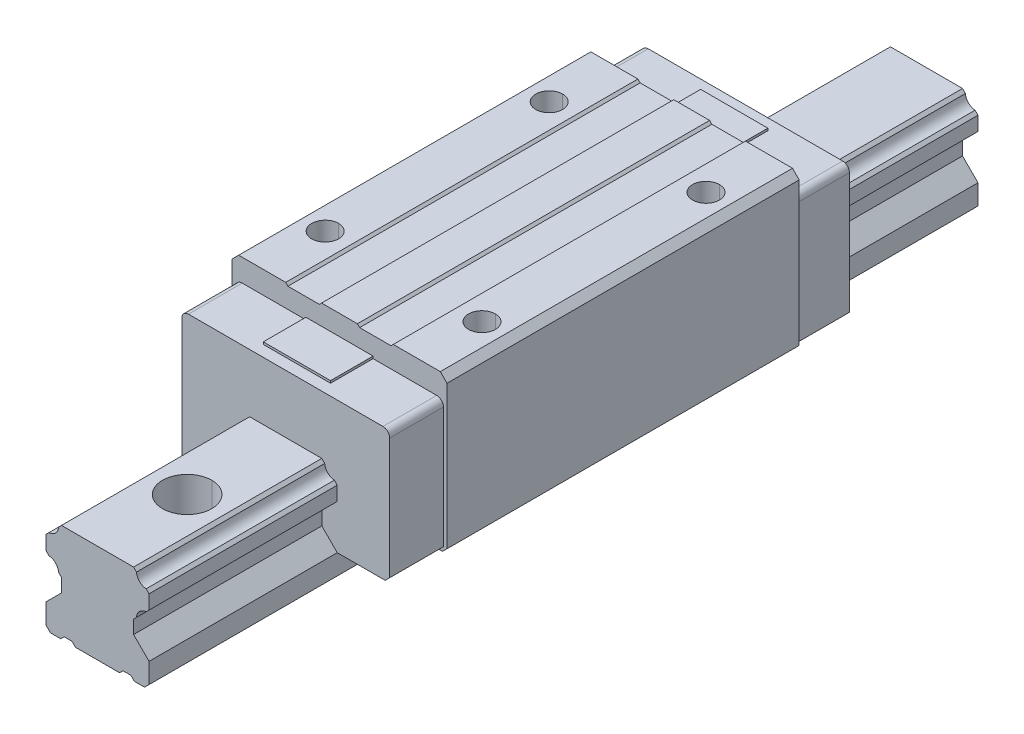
ISO-10303-21;
HEADER;
FILE_DESCRIPTION(('STEP AP214'),'2;1');
FILE_NAME('part.step','',(''),(''),'','','');
FILE_SCHEMA(('AUTOMOTIVE_DESIGN { 1 0 10303 214 1 1 1 1 }'));
ENDSEC;
DATA;
#1=APPLICATION_CONTEXT('core data for automotive mechanical design processes');
#2=APPLICATION_PROTOCOL_DEFINITION('international standard','automotive_design',2000,#1);
#3=PRODUCT_CONTEXT('',#1,'mechanical');
#4=PRODUCT('Part','Part','',(#3));
#5=PRODUCT_RELATED_PRODUCT_CATEGORY('part','',(#4));
#6=PRODUCT_DEFINITION_FORMATION('','',#4);
#7=PRODUCT_DEFINITION_CONTEXT('part definition',#1,'design');
#8=PRODUCT_DEFINITION('design','',#6,#7);
#9=PRODUCT_DEFINITION_SHAPE('','',#8);
#10=(LENGTH_UNIT() NAMED_UNIT(*) SI_UNIT(.MILLI.,.METRE.));
#11=(NAMED_UNIT(*) PLANE_ANGLE_UNIT() SI_UNIT($,.RADIAN.));
#12=(NAMED_UNIT(*) SI_UNIT($,.STERADIAN.) SOLID_ANGLE_UNIT());
#13=UNCERTAINTY_MEASURE_WITH_UNIT(LENGTH_MEASURE(1.E-05),#10,'distance_accuracy_value','');
#14=(GEOMETRIC_REPRESENTATION_CONTEXT(3) GLOBAL_UNCERTAINTY_ASSIGNED_CONTEXT((#13)) GLOBAL_UNIT_ASSIGNED_CONTEXT((#10,
#11,#12)) REPRESENTATION_CONTEXT('',''));
#15=CARTESIAN_POINT('',(0.,0.,0.));
#16=DIRECTION('',(0.,0.,1.));
#17=DIRECTION('',(1.,0.,0.));
#18=AXIS2_PLACEMENT_3D('',#15,#16,#17);
#19=CARTESIAN_POINT('',(17.5,40.,-68.3));
#20=DIRECTION('',(0.,1.,0.));
#21=DIRECTION('',(0.,0.,1.));
#22=AXIS2_PLACEMENT_3D('',#19,#20,#21);
#23=CYLINDRICAL_SURFACE('',#22,3.);
#24=CARTESIAN_POINT('',(17.5,28.9,-68.3));
#25=DIRECTION('',(0.,1.,0.));
#26=DIRECTION('',(0.,0.,1.));
#27=AXIS2_PLACEMENT_3D('',#24,#25,#26);
#28=CIRCLE('',#27,3.);
#29=CARTESIAN_POINT('',(17.5,28.9,-71.3));
#30=VERTEX_POINT('',#29);
#31=CARTESIAN_POINT('',(14.4999999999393,28.9,-68.3));
#32=VERTEX_POINT('',#31);
#33=EDGE_CURVE('P0_E10',#30,#32,#28,.T.);
#34=ORIENTED_EDGE('',*,*,#33,.F.);
#35=DIRECTION('',(0.,1.,0.));
#36=VECTOR('',#35,1.);
#37=CARTESIAN_POINT('',(17.5,40.,-71.3));
#38=LINE('',#37,#36);
#39=CARTESIAN_POINT('',(17.5,40.,-71.3));
#40=VERTEX_POINT('',#39);
#41=EDGE_CURVE('P0_E1140',#30,#40,#38,.T.);
#42=ORIENTED_EDGE('',*,*,#41,.T.);
#43=CARTESIAN_POINT('',(17.5,40.,-68.3));
#44=DIRECTION('',(0.,1.,0.));
#45=DIRECTION('',(0.,0.,1.));
#46=AXIS2_PLACEMENT_3D('',#43,#44,#45);
#47=CIRCLE('',#46,3.);
#48=CARTESIAN_POINT('',(17.5,40.,-65.3));
#49=VERTEX_POINT('',#48);
#50=EDGE_CURVE('P0_E1057',#40,#49,#47,.T.);
#51=ORIENTED_EDGE('',*,*,#50,.T.);
#52=DIRECTION('',(0.,1.,0.));
#53=VECTOR('',#52,1.);
#54=CARTESIAN_POINT('',(17.5,40.,-65.3));
#55=LINE('',#54,#53);
#56=CARTESIAN_POINT('',(17.5,28.9,-65.3));
#57=VERTEX_POINT('',#56);
#58=EDGE_CURVE('P0_E825',#57,#49,#55,.T.);
#59=ORIENTED_EDGE('',*,*,#58,.F.);
#60=CARTESIAN_POINT('',(17.5,28.9,-68.3));
#61=DIRECTION('',(0.,1.,0.));
#62=DIRECTION('',(0.,0.,1.));
#63=AXIS2_PLACEMENT_3D('',#60,#61,#62);
#64=CIRCLE('',#63,3.);
#65=EDGE_CURVE('P0_E1154',#32,#57,#64,.T.);
#66=ORIENTED_EDGE('',*,*,#65,.F.);
#67=EDGE_LOOP('',(#34,#42,#51,#59,#66));
#68=FACE_BOUND('',#67,.T.);
#69=ADVANCED_FACE('P0_F17',(#68),#23,.F.);
#70=CARTESIAN_POINT('',(17.5,40.,-118.3));
#71=DIRECTION('',(0.,1.,0.));
#72=DIRECTION('',(0.,0.,1.));
#73=AXIS2_PLACEMENT_3D('',#70,#71,#72);
#74=CYLINDRICAL_SURFACE('',#73,3.);
#75=CARTESIAN_POINT('',(17.5,28.9,-118.3));
#76=DIRECTION('',(0.,1.,0.));
#77=DIRECTION('',(0.,0.,1.));
#78=AXIS2_PLACEMENT_3D('',#75,#76,#77);
#79=CIRCLE('',#78,3.);
#80=CARTESIAN_POINT('',(17.5,28.9,-121.3));
#81=VERTEX_POINT('',#80);
#82=CARTESIAN_POINT('',(14.4999999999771,28.9,-118.3));
#83=VERTEX_POINT('',#82);
#84=EDGE_CURVE('P0_E26',#81,#83,#79,.T.);
#85=ORIENTED_EDGE('',*,*,#84,.F.);
#86=DIRECTION('',(0.,1.,0.));
#87=VECTOR('',#86,1.);
#88=CARTESIAN_POINT('',(17.5,40.,-121.3));
#89=LINE('',#88,#87);
#90=CARTESIAN_POINT('',(17.5,40.,-121.3));
#91=VERTEX_POINT('',#90);
#92=EDGE_CURVE('P0_E1183',#81,#91,#89,.T.);
#93=ORIENTED_EDGE('',*,*,#92,.T.);
#94=CARTESIAN_POINT('',(17.5,40.,-118.3));
#95=DIRECTION('',(0.,1.,0.));
#96=DIRECTION('',(0.,0.,1.));
#97=AXIS2_PLACEMENT_3D('',#94,#95,#96);
#98=CIRCLE('',#97,3.);
#99=CARTESIAN_POINT('',(17.5,40.,-115.3));
#100=VERTEX_POINT('',#99);
#101=EDGE_CURVE('P0_E1054',#91,#100,#98,.T.);
#102=ORIENTED_EDGE('',*,*,#101,.T.);
#103=DIRECTION('',(0.,1.,0.));
#104=VECTOR('',#103,1.);
#105=CARTESIAN_POINT('',(17.5,40.,-115.3));
#106=LINE('',#105,#104);
#107=CARTESIAN_POINT('',(17.5,28.9,-115.3));
#108=VERTEX_POINT('',#107);
#109=EDGE_CURVE('P0_E1115',#108,#100,#106,.T.);
#110=ORIENTED_EDGE('',*,*,#109,.F.);
#111=CARTESIAN_POINT('',(17.5,28.9,-118.3));
#112=DIRECTION('',(0.,1.,0.));
#113=DIRECTION('',(0.,0.,1.));
#114=AXIS2_PLACEMENT_3D('',#111,#112,#113);
#115=CIRCLE('',#114,3.);
#116=EDGE_CURVE('P0_E1112',#83,#108,#115,.T.);
#117=ORIENTED_EDGE('',*,*,#116,.F.);
#118=EDGE_LOOP('',(#85,#93,#102,#110,#117));
#119=FACE_BOUND('',#118,.T.);
#120=ADVANCED_FACE('P0_F1113',(#119),#74,.F.);
#121=CARTESIAN_POINT('',(-17.5,40.,-68.3));
#122=DIRECTION('',(0.,1.,0.));
#123=DIRECTION('',(0.,0.,1.));
#124=AXIS2_PLACEMENT_3D('',#121,#122,#123);
#125=CYLINDRICAL_SURFACE('',#124,3.);
#126=CARTESIAN_POINT('',(-17.5,28.9,-68.3));
#127=DIRECTION('',(0.,1.,0.));
#128=DIRECTION('',(0.,0.,1.));
#129=AXIS2_PLACEMENT_3D('',#126,#127,#128);
#130=CIRCLE('',#129,3.);
#131=CARTESIAN_POINT('',(-17.5,28.9,-71.3000000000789));
#132=VERTEX_POINT('',#131);
#133=CARTESIAN_POINT('',(-17.5,28.9,-65.2999999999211));
#134=VERTEX_POINT('',#133);
#135=EDGE_CURVE('P0_E1095',#132,#134,#130,.T.);
#136=ORIENTED_EDGE('',*,*,#135,.F.);
#137=DIRECTION('',(0.,1.,0.));
#138=VECTOR('',#137,1.);
#139=CARTESIAN_POINT('',(-17.5,40.,-71.3));
#140=LINE('',#139,#138);
#141=CARTESIAN_POINT('',(-17.5,40.,-71.3));
#142=VERTEX_POINT('',#141);
#143=EDGE_CURVE('P0_E716',#132,#142,#140,.T.);
#144=ORIENTED_EDGE('',*,*,#143,.T.);
#145=CARTESIAN_POINT('',(-17.5,40.,-68.3));
#146=DIRECTION('',(0.,1.,0.));
#147=DIRECTION('',(0.,0.,1.));
#148=AXIS2_PLACEMENT_3D('',#145,#146,#147);
#149=CIRCLE('',#148,3.);
#150=CARTESIAN_POINT('',(-17.5,40.,-65.3));
#151=VERTEX_POINT('',#150);
#152=EDGE_CURVE('P0_E994',#142,#151,#149,.T.);
#153=ORIENTED_EDGE('',*,*,#152,.T.);
#154=DIRECTION('',(0.,1.,0.));
#155=VECTOR('',#154,1.);
#156=CARTESIAN_POINT('',(-17.5,40.,-65.3));
#157=LINE('',#156,#155);
#158=EDGE_CURVE('P0_E720',#134,#151,#157,.T.);
#159=ORIENTED_EDGE('',*,*,#158,.F.);
#160=EDGE_LOOP('',(#136,#144,#153,#159));
#161=FACE_BOUND('',#160,.T.);
#162=ADVANCED_FACE('P0_F19',(#161),#125,.F.);
#163=CARTESIAN_POINT('',(-17.5,40.,-118.3));
#164=DIRECTION('',(0.,1.,0.));
#165=DIRECTION('',(0.,0.,1.));
#166=AXIS2_PLACEMENT_3D('',#163,#164,#165);
#167=CYLINDRICAL_SURFACE('',#166,3.);
#168=CARTESIAN_POINT('',(-17.5,28.9,-118.3));
#169=DIRECTION('',(0.,1.,0.));
#170=DIRECTION('',(0.,0.,1.));
#171=AXIS2_PLACEMENT_3D('',#168,#169,#170);
#172=CIRCLE('',#171,3.);
#173=CARTESIAN_POINT('',(-17.5,28.9,-121.3));
#174=VERTEX_POINT('',#173);
#175=CARTESIAN_POINT('',(-20.5000000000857,28.9,-118.3));
#176=VERTEX_POINT('',#175);
#177=EDGE_CURVE('P0_E589',#174,#176,#172,.T.);
#178=ORIENTED_EDGE('',*,*,#177,.F.);
#179=DIRECTION('',(0.,1.,0.));
#180=VECTOR('',#179,1.);
#181=CARTESIAN_POINT('',(-17.5,40.,-121.3));
#182=LINE('',#181,#180);
#183=CARTESIAN_POINT('',(-17.5,40.,-121.3));
#184=VERTEX_POINT('',#183);
#185=EDGE_CURVE('P0_E762',#174,#184,#182,.T.);
#186=ORIENTED_EDGE('',*,*,#185,.T.);
#187=CARTESIAN_POINT('',(-17.5,40.,-118.3));
#188=DIRECTION('',(0.,1.,0.));
#189=DIRECTION('',(0.,0.,1.));
#190=AXIS2_PLACEMENT_3D('',#187,#188,#189);
#191=CIRCLE('',#190,3.);
#192=CARTESIAN_POINT('',(-17.5,40.,-115.3));
#193=VERTEX_POINT('',#192);
#194=EDGE_CURVE('P0_E993',#184,#193,#191,.T.);
#195=ORIENTED_EDGE('',*,*,#194,.T.);
#196=DIRECTION('',(0.,1.,0.));
#197=VECTOR('',#196,1.);
#198=CARTESIAN_POINT('',(-17.5,40.,-115.3));
#199=LINE('',#198,#197);
#200=CARTESIAN_POINT('',(-17.5,28.9,-115.3));
#201=VERTEX_POINT('',#200);
#202=EDGE_CURVE('P0_E767',#201,#193,#199,.T.);
#203=ORIENTED_EDGE('',*,*,#202,.F.);
#204=CARTESIAN_POINT('',(-17.5,28.9,-118.3));
#205=DIRECTION('',(0.,1.,0.));
#206=DIRECTION('',(0.,0.,1.));
#207=AXIS2_PLACEMENT_3D('',#204,#205,#206);
#208=CIRCLE('',#207,3.);
#209=EDGE_CURVE('P0_E1405',#176,#201,#208,.T.);
#210=ORIENTED_EDGE('',*,*,#209,.F.);
#211=EDGE_LOOP('',(#178,#186,#195,#203,#210));
#212=FACE_BOUND('',#211,.T.);
#213=ADVANCED_FACE('P0_F1664',(#212),#167,.F.);
#214=CARTESIAN_POINT('',(17.5,28.8999999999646,-68.3));
#215=DIRECTION('',(0.,1.,0.));
#216=DIRECTION('',(-1.,0.,0.));
#217=AXIS2_PLACEMENT_3D('',#214,#215,#216);
#218=CONICAL_SURFACE('',#217,3.00000000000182,1.02974425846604);
#219=DIRECTION('',(-0.857167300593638,0.515038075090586,0.));
#220=VECTOR('',#219,1.);
#221=CARTESIAN_POINT('',(14.4999999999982,28.8999999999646,-68.3));
#222=LINE('',#221,#220);
#223=CARTESIAN_POINT('',(17.5000000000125,27.0974181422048,-68.3));
#224=VERTEX_POINT('',#223);
#225=EDGE_CURVE('P0_E1147',#224,#32,#222,.T.);
#226=ORIENTED_EDGE('',*,*,#225,.F.);
#227=DIRECTION('',(0.857167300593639,0.515038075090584,0.));
#228=VECTOR('',#227,1.);
#229=CARTESIAN_POINT('',(20.5000000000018,28.8999999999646,-68.3));
#230=LINE('',#229,#228);
#231=CARTESIAN_POINT('',(20.5000000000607,28.9,-68.3));
#232=VERTEX_POINT('',#231);
#233=EDGE_CURVE('P0_E1143',#224,#232,#230,.T.);
#234=ORIENTED_EDGE('',*,*,#233,.T.);
#235=CARTESIAN_POINT('',(17.5,28.9,-68.3));
#236=DIRECTION('',(0.,1.,0.));
#237=DIRECTION('',(0.,0.,1.));
#238=AXIS2_PLACEMENT_3D('',#235,#236,#237);
#239=CIRCLE('',#238,3.);
#240=EDGE_CURVE('P0_E829',#232,#30,#239,.T.);
#241=ORIENTED_EDGE('',*,*,#240,.T.);
#242=ORIENTED_EDGE('',*,*,#33,.T.);
#243=EDGE_LOOP('',(#226,#234,#241,#242));
#244=FACE_BOUND('',#243,.T.);
#245=ADVANCED_FACE('P0_F1666',(#244),#218,.F.);
#246=CARTESIAN_POINT('',(17.5,28.9000000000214,-118.3));
#247=DIRECTION('',(0.,1.,0.));
#248=DIRECTION('',(-1.,0.,0.));
#249=AXIS2_PLACEMENT_3D('',#246,#247,#248);
#250=CONICAL_SURFACE('',#249,3.00000000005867,1.02974425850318);
#251=DIRECTION('',(-0.857167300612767,0.51503807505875,0.));
#252=VECTOR('',#251,1.);
#253=CARTESIAN_POINT('',(14.4999999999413,28.9000000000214,-118.3));
#254=LINE('',#253,#252);
#255=CARTESIAN_POINT('',(17.5,27.0974181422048,-118.3));
#256=VERTEX_POINT('',#255);
#257=EDGE_CURVE('P0_E1105',#256,#83,#254,.T.);
#258=ORIENTED_EDGE('',*,*,#257,.F.);
#259=DIRECTION('',(0.857167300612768,0.515038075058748,0.));
#260=VECTOR('',#259,1.);
#261=CARTESIAN_POINT('',(20.5000000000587,28.9000000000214,-118.3));
#262=LINE('',#261,#260);
#263=CARTESIAN_POINT('',(20.500000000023,28.9,-118.3));
#264=VERTEX_POINT('',#263);
#265=EDGE_CURVE('P0_E1123',#256,#264,#262,.T.);
#266=ORIENTED_EDGE('',*,*,#265,.T.);
#267=CARTESIAN_POINT('',(17.5,28.9,-118.3));
#268=DIRECTION('',(0.,1.,0.));
#269=DIRECTION('',(0.,0.,1.));
#270=AXIS2_PLACEMENT_3D('',#267,#268,#269);
#271=CIRCLE('',#270,3.);
#272=EDGE_CURVE('P0_E1107',#264,#81,#271,.T.);
#273=ORIENTED_EDGE('',*,*,#272,.T.);
#274=ORIENTED_EDGE('',*,*,#84,.T.);
#275=EDGE_LOOP('',(#258,#266,#273,#274));
#276=FACE_BOUND('',#275,.T.);
#277=ADVANCED_FACE('P0_F1102',(#276),#250,.F.);
#278=CARTESIAN_POINT('',(-17.5,28.8999999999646,-68.3));
#279=DIRECTION('',(0.,1.,0.));
#280=DIRECTION('',(0.,0.,1.));
#281=AXIS2_PLACEMENT_3D('',#278,#279,#280);
#282=CONICAL_SURFACE('',#281,3.00000000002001,1.02974425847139);
#283=DIRECTION('',(0.,0.515038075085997,0.857167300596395));
#284=VECTOR('',#283,1.);
#285=CARTESIAN_POINT('',(-17.5,28.8999999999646,-65.29999999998));
#286=LINE('',#285,#284);
#287=CARTESIAN_POINT('',(-17.5,27.0974181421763,-68.2999999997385));
#288=VERTEX_POINT('',#287);
#289=EDGE_CURVE('P0_E1417',#288,#134,#286,.T.);
#290=ORIENTED_EDGE('',*,*,#289,.F.);
#291=DIRECTION('',(0.,0.515038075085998,-0.857167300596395));
#292=VECTOR('',#291,1.);
#293=CARTESIAN_POINT('',(-17.5,28.8999999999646,-71.30000000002));
#294=LINE('',#293,#292);
#295=EDGE_CURVE('P0_E1414',#288,#132,#294,.T.);
#296=ORIENTED_EDGE('',*,*,#295,.T.);
#297=ORIENTED_EDGE('',*,*,#135,.T.);
#298=EDGE_LOOP('',(#290,#296,#297));
#299=FACE_BOUND('',#298,.T.);
#300=ADVANCED_FACE('P0_F1662',(#299),#282,.F.);
#301=CARTESIAN_POINT('',(-17.5,28.8999999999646,-118.3));
#302=DIRECTION('',(0.,1.,0.));
#303=DIRECTION('',(-1.,0.,0.));
#304=AXIS2_PLACEMENT_3D('',#301,#302,#303);
#305=CONICAL_SURFACE('',#304,3.00000000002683,1.02974425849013);
#306=DIRECTION('',(-0.857167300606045,0.515038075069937,0.));
#307=VECTOR('',#306,1.);
#308=CARTESIAN_POINT('',(-20.5000000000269,28.8999999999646,-118.3));
#309=LINE('',#308,#307);
#310=CARTESIAN_POINT('',(-17.5,27.0974181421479,-118.3));
#311=VERTEX_POINT('',#310);
#312=EDGE_CURVE('P0_E1393',#311,#176,#309,.T.);
#313=ORIENTED_EDGE('',*,*,#312,.F.);
#314=DIRECTION('',(0.857167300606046,0.515038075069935,0.));
#315=VECTOR('',#314,1.);
#316=CARTESIAN_POINT('',(-14.4999999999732,28.8999999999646,-118.3));
#317=LINE('',#316,#315);
#318=CARTESIAN_POINT('',(-14.4999999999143,28.9,-118.3));
#319=VERTEX_POINT('',#318);
#320=EDGE_CURVE('P0_E1388',#311,#319,#317,.T.);
#321=ORIENTED_EDGE('',*,*,#320,.T.);
#322=CARTESIAN_POINT('',(-17.5,28.9,-118.3));
#323=DIRECTION('',(0.,1.,0.));
#324=DIRECTION('',(0.,0.,1.));
#325=AXIS2_PLACEMENT_3D('',#322,#323,#324);
#326=CIRCLE('',#325,3.);
#327=EDGE_CURVE('P0_E766',#319,#174,#326,.T.);
#328=ORIENTED_EDGE('',*,*,#327,.T.);
#329=ORIENTED_EDGE('',*,*,#177,.T.);
#330=EDGE_LOOP('',(#313,#321,#328,#329));
#331=FACE_BOUND('',#330,.T.);
#332=ADVANCED_FACE('P0_F1678',(#331),#305,.F.);
#333=CARTESIAN_POINT('',(11.5,0.,-41.9999));
#334=DIRECTION('',(0.,0.,-1.));
#335=DIRECTION('',(0.,-1.,0.));
#336=AXIS2_PLACEMENT_3D('',#333,#334,#335);
#337=PLANE('',#336);
#338=CARTESIAN_POINT('',(-10.99475919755,12.45524080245,-41.9999));
#339=DIRECTION('',(0.,0.,-1.));
#340=DIRECTION('',(-1.,0.,0.));
#341=AXIS2_PLACEMENT_3D('',#338,#339,#340);
#342=CIRCLE('',#341,2.3);
#343=CARTESIAN_POINT('',(-10.8507264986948,14.7507264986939,-41.9999));
#344=VERTEX_POINT('',#343);
#345=CARTESIAN_POINT('',(-8.69927350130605,12.599273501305,-41.9999));
#346=VERTEX_POINT('',#345);
#347=EDGE_CURVE('P0_E722',#344,#346,#342,.T.);
#348=ORIENTED_EDGE('',*,*,#347,.F.);
#349=DIRECTION('',(-0.707106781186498,0.707106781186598,0.));
#350=VECTOR('',#349,1.);
#351=CARTESIAN_POINT('',(-11.5,15.4,-41.9999));
#352=LINE('',#351,#350);
#353=CARTESIAN_POINT('',(-11.5,15.4,-41.9999));
#354=VERTEX_POINT('',#353);
#355=EDGE_CURVE('P0_E1379',#344,#354,#352,.T.);
#356=ORIENTED_EDGE('',*,*,#355,.T.);
#357=DIRECTION('',(0.,-1.,0.));
#358=VECTOR('',#357,1.);
#359=CARTESIAN_POINT('',(-11.5,0.,-41.9999));
#360=LINE('',#359,#358);
#361=CARTESIAN_POINT('',(-11.5,18.5500000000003,-41.9999));
#362=VERTEX_POINT('',#361);
#363=EDGE_CURVE('P0_E712',#362,#354,#360,.T.);
#364=ORIENTED_EDGE('',*,*,#363,.F.);
#365=DIRECTION('',(0.707106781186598,0.707106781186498,0.));
#366=VECTOR('',#365,1.);
#367=CARTESIAN_POINT('',(-8.05,22.,-41.9999));
#368=LINE('',#367,#366);
#369=CARTESIAN_POINT('',(-10.8507264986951,19.199273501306,-41.9999));
#370=VERTEX_POINT('',#369);
#371=EDGE_CURVE('P0_E1440',#362,#370,#368,.T.);
#372=ORIENTED_EDGE('',*,*,#371,.T.);
#373=CARTESIAN_POINT('',(-10.99475919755,21.49475919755,-41.9999));
#374=DIRECTION('',(0.,0.,-1.));
#375=DIRECTION('',(-1.,0.,0.));
#376=AXIS2_PLACEMENT_3D('',#373,#374,#375);
#377=CIRCLE('',#376,2.3);
#378=CARTESIAN_POINT('',(-8.69927350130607,21.3507264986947,-41.9999));
#379=VERTEX_POINT('',#378);
#380=EDGE_CURVE('P0_E705',#379,#370,#377,.T.);
#381=ORIENTED_EDGE('',*,*,#380,.F.);
#382=DIRECTION('',(0.707106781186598,0.707106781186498,0.));
#383=VECTOR('',#382,1.);
#384=CARTESIAN_POINT('',(-8.05,22.,-41.9999));
#385=LINE('',#384,#383);
#386=CARTESIAN_POINT('',(-8.05,22.,-41.9999));
#387=VERTEX_POINT('',#386);
#388=EDGE_CURVE('P0_E1470',#379,#387,#385,.T.);
#389=ORIENTED_EDGE('',*,*,#388,.T.);
#390=DIRECTION('',(-1.,0.,0.));
#391=VECTOR('',#390,1.);
#392=CARTESIAN_POINT('',(11.5,22.,-41.9999));
#393=LINE('',#392,#391);
#394=CARTESIAN_POINT('',(8.05,22.,-41.9999));
#395=VERTEX_POINT('',#394);
#396=EDGE_CURVE('P0_E676',#395,#387,#393,.T.);
#397=ORIENTED_EDGE('',*,*,#396,.F.);
#398=DIRECTION('',(0.707106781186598,-0.707106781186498,0.));
#399=VECTOR('',#398,1.);
#400=CARTESIAN_POINT('',(8.05,22.,-41.9999));
#401=LINE('',#400,#399);
#402=CARTESIAN_POINT('',(8.69927350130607,21.3507264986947,-41.9999));
#403=VERTEX_POINT('',#402);
#404=EDGE_CURVE('P0_E1456',#395,#403,#401,.T.);
#405=ORIENTED_EDGE('',*,*,#404,.T.);
#406=CARTESIAN_POINT('',(10.99475919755,21.49475919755,-41.9999));
#407=DIRECTION('',(0.,0.,-1.));
#408=DIRECTION('',(-1.,0.,0.));
#409=AXIS2_PLACEMENT_3D('',#406,#407,#408);
#410=CIRCLE('',#409,2.3);
#411=CARTESIAN_POINT('',(10.8507264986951,19.199273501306,-41.9999));
#412=VERTEX_POINT('',#411);
#413=EDGE_CURVE('P0_E680',#412,#403,#410,.T.);
#414=ORIENTED_EDGE('',*,*,#413,.F.);
#415=DIRECTION('',(0.707106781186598,-0.707106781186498,0.));
#416=VECTOR('',#415,1.);
#417=CARTESIAN_POINT('',(8.05,22.,-41.9999));
#418=LINE('',#417,#416);
#419=CARTESIAN_POINT('',(11.5,18.5500000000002,-41.9999));
#420=VERTEX_POINT('',#419);
#421=EDGE_CURVE('P0_E1430',#412,#420,#418,.T.);
#422=ORIENTED_EDGE('',*,*,#421,.T.);
#423=DIRECTION('',(0.,1.,0.));
#424=VECTOR('',#423,1.);
#425=CARTESIAN_POINT('',(11.5,0.,-41.9999));
#426=LINE('',#425,#424);
#427=CARTESIAN_POINT('',(11.5,15.4,-41.9999));
#428=VERTEX_POINT('',#427);
#429=EDGE_CURVE('P0_E669',#428,#420,#426,.T.);
#430=ORIENTED_EDGE('',*,*,#429,.F.);
#431=DIRECTION('',(-0.707106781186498,-0.707106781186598,0.));
#432=VECTOR('',#431,1.);
#433=CARTESIAN_POINT('',(11.5,15.4,-41.9999));
#434=LINE('',#433,#432);
#435=CARTESIAN_POINT('',(10.8507264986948,14.7507264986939,-41.9999));
#436=VERTEX_POINT('',#435);
#437=EDGE_CURVE('P0_E1596',#428,#436,#434,.T.);
#438=ORIENTED_EDGE('',*,*,#437,.T.);
#439=CARTESIAN_POINT('',(10.99475919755,12.45524080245,-41.9999));
#440=DIRECTION('',(0.,0.,-1.));
#441=DIRECTION('',(-1.,0.,0.));
#442=AXIS2_PLACEMENT_3D('',#439,#440,#441);
#443=CIRCLE('',#442,2.3);
#444=CARTESIAN_POINT('',(8.69927350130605,12.599273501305,-41.9999));
#445=VERTEX_POINT('',#444);
#446=EDGE_CURVE('P0_E668',#445,#436,#443,.T.);
#447=ORIENTED_EDGE('',*,*,#446,.F.);
#448=DIRECTION('',(-0.707106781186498,-0.707106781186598,0.));
#449=VECTOR('',#448,1.);
#450=CARTESIAN_POINT('',(11.5,15.4,-41.9999));
#451=LINE('',#450,#449);
#452=CARTESIAN_POINT('',(8.05000000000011,11.9499999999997,-41.9999));
#453=VERTEX_POINT('',#452);
#454=EDGE_CURVE('P0_E1617',#445,#453,#451,.T.);
#455=ORIENTED_EDGE('',*,*,#454,.T.);
#456=DIRECTION('',(0.,1.,0.));
#457=VECTOR('',#456,1.);
#458=CARTESIAN_POINT('',(8.05,0.,-41.9999));
#459=LINE('',#458,#457);
#460=CARTESIAN_POINT('',(8.05,8.95,-41.9999));
#461=VERTEX_POINT('',#460);
#462=EDGE_CURVE('P0_E647',#461,#453,#459,.T.);
#463=ORIENTED_EDGE('',*,*,#462,.F.);
#464=DIRECTION('',(-0.707106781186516,0.707106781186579,0.));
#465=VECTOR('',#464,1.);
#466=CARTESIAN_POINT('',(11.4999999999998,5.49999999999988,-41.9999));
#467=LINE('',#466,#465);
#468=CARTESIAN_POINT('',(11.4999999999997,5.49999999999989,-41.9999));
#469=VERTEX_POINT('',#468);
#470=EDGE_CURVE('P0_E918',#469,#461,#467,.T.);
#471=ORIENTED_EDGE('',*,*,#470,.F.);
#472=DIRECTION('',(1.,0.,0.));
#473=VECTOR('',#472,1.);
#474=CARTESIAN_POINT('',(-23.2,5.5,-41.9999));
#475=LINE('',#474,#473);
#476=CARTESIAN_POINT('',(22.2,5.5,-41.9999));
#477=VERTEX_POINT('',#476);
#478=EDGE_CURVE('P0_E1074',#469,#477,#475,.T.);
#479=ORIENTED_EDGE('',*,*,#478,.T.);
#480=DIRECTION('',(-0.707106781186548,-0.707106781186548,0.));
#481=VECTOR('',#480,1.);
#482=CARTESIAN_POINT('',(22.2,5.5,-41.9999));
#483=LINE('',#482,#481);
#484=CARTESIAN_POINT('',(23.2,6.5,-41.9999));
#485=VERTEX_POINT('',#484);
#486=EDGE_CURVE('P0_E921',#485,#477,#483,.T.);
#487=ORIENTED_EDGE('',*,*,#486,.F.);
#488=DIRECTION('',(0.,1.,0.));
#489=VECTOR('',#488,1.);
#490=CARTESIAN_POINT('',(23.2,35.,-41.9999));
#491=LINE('',#490,#489);
#492=CARTESIAN_POINT('',(23.2,33.5,-41.9999));
#493=VERTEX_POINT('',#492);
#494=EDGE_CURVE('P0_E978',#485,#493,#491,.T.);
#495=ORIENTED_EDGE('',*,*,#494,.T.);
#496=CARTESIAN_POINT('',(21.7,33.5,-41.9999));
#497=DIRECTION('',(0.,0.,-1.));
#498=DIRECTION('',(-1.,0.,0.));
#499=AXIS2_PLACEMENT_3D('',#496,#497,#498);
#500=CIRCLE('',#499,1.5);
#501=CARTESIAN_POINT('',(21.7,35.,-41.9999));
#502=VERTEX_POINT('',#501);
#503=EDGE_CURVE('P0_E640',#502,#493,#500,.T.);
#504=ORIENTED_EDGE('',*,*,#503,.F.);
#505=DIRECTION('',(-1.,0.,0.));
#506=VECTOR('',#505,1.);
#507=CARTESIAN_POINT('',(-23.2,35.,-41.9999));
#508=LINE('',#507,#506);
#509=CARTESIAN_POINT('',(-21.7,35.,-41.9999));
#510=VERTEX_POINT('',#509);
#511=EDGE_CURVE('P0_E958',#502,#510,#508,.T.);
#512=ORIENTED_EDGE('',*,*,#511,.T.);
#513=CARTESIAN_POINT('',(-21.7,33.5,-41.9999));
#514=DIRECTION('',(0.,0.,-1.));
#515=DIRECTION('',(-1.,0.,0.));
#516=AXIS2_PLACEMENT_3D('',#513,#514,#515);
#517=CIRCLE('',#516,1.5);
#518=CARTESIAN_POINT('',(-23.2,33.5,-41.9999));
#519=VERTEX_POINT('',#518);
#520=EDGE_CURVE('P0_E706',#519,#510,#517,.T.);
#521=ORIENTED_EDGE('',*,*,#520,.F.);
#522=DIRECTION('',(0.,-1.,0.));
#523=VECTOR('',#522,1.);
#524=CARTESIAN_POINT('',(-23.2,35.,-41.9999));
#525=LINE('',#524,#523);
#526=CARTESIAN_POINT('',(-23.2,6.5,-41.9999));
#527=VERTEX_POINT('',#526);
#528=EDGE_CURVE('P0_E711',#519,#527,#525,.T.);
#529=ORIENTED_EDGE('',*,*,#528,.T.);
#530=DIRECTION('',(-0.707106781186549,0.707106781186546,0.));
#531=VECTOR('',#530,1.);
#532=CARTESIAN_POINT('',(-22.2,5.5,-41.9999));
#533=LINE('',#532,#531);
#534=CARTESIAN_POINT('',(-22.2,5.5,-41.9999));
#535=VERTEX_POINT('',#534);
#536=EDGE_CURVE('P0_E725',#535,#527,#533,.T.);
#537=ORIENTED_EDGE('',*,*,#536,.F.);
#538=DIRECTION('',(-1.,0.,0.));
#539=VECTOR('',#538,1.);
#540=CARTESIAN_POINT('',(11.5,5.5,-41.9999));
#541=LINE('',#540,#539);
#542=CARTESIAN_POINT('',(-11.4999999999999,5.5,-41.9999));
#543=VERTEX_POINT('',#542);
#544=EDGE_CURVE('P0_E622',#543,#535,#541,.T.);
#545=ORIENTED_EDGE('',*,*,#544,.F.);
#546=DIRECTION('',(-0.707106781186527,-0.707106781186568,0.));
#547=VECTOR('',#546,1.);
#548=CARTESIAN_POINT('',(-8.05000000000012,8.95,-41.9999));
#549=LINE('',#548,#547);
#550=CARTESIAN_POINT('',(-8.05000000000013,8.94999999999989,-41.9999));
#551=VERTEX_POINT('',#550);
#552=EDGE_CURVE('P0_E1170',#551,#543,#549,.T.);
#553=ORIENTED_EDGE('',*,*,#552,.F.);
#554=DIRECTION('',(0.,-1.,0.));
#555=VECTOR('',#554,1.);
#556=CARTESIAN_POINT('',(-8.05000000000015,0.,-41.9999));
#557=LINE('',#556,#555);
#558=CARTESIAN_POINT('',(-8.0500000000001,11.9499999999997,-41.9999));
#559=VERTEX_POINT('',#558);
#560=EDGE_CURVE('P0_E1159',#559,#551,#557,.T.);
#561=ORIENTED_EDGE('',*,*,#560,.F.);
#562=DIRECTION('',(-0.707106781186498,0.707106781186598,0.));
#563=VECTOR('',#562,1.);
#564=CARTESIAN_POINT('',(-11.5,15.4,-41.9999));
#565=LINE('',#564,#563);
#566=EDGE_CURVE('P0_E1509',#559,#346,#565,.T.);
#567=ORIENTED_EDGE('',*,*,#566,.T.);
#568=EDGE_LOOP('',(#348,#356,#364,#372,#381,#389,#397,#405,#414,#422,#430,#438,#447,#455,#463,
#471,#479,#487,#495,#504,#512,#521,#529,#537,#545,#553,#561,#567));
#569=FACE_BOUND('',#568,.T.);
#570=ADVANCED_FACE('P0_F1329',(#569),#337,.F.);
#571=CARTESIAN_POINT('',(24.,40.,5.11218148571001));
#572=DIRECTION('',(-1.,0.,0.));
#573=DIRECTION('',(0.,0.,1.));
#574=AXIS2_PLACEMENT_3D('',#571,#572,#573);
#575=PLANE('',#574);
#576=DIRECTION('',(0.,-1.,0.));
#577=VECTOR('',#576,1.);
#578=CARTESIAN_POINT('',(24.,40.,-132.6));
#579=LINE('',#578,#577);
#580=CARTESIAN_POINT('',(24.,38.5,-132.6));
#581=VERTEX_POINT('',#580);
#582=CARTESIAN_POINT('',(24.,6.5,-132.6));
#583=VERTEX_POINT('',#582);
#584=EDGE_CURVE('P0_E50',#581,#583,#579,.T.);
#585=ORIENTED_EDGE('',*,*,#584,.F.);
#586=DIRECTION('',(0.,0.,-1.));
#587=VECTOR('',#586,1.);
#588=CARTESIAN_POINT('',(24.,38.5,5.11218148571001));
#589=LINE('',#588,#587);
#590=CARTESIAN_POINT('',(24.,38.5,-54.));
#591=VERTEX_POINT('',#590);
#592=EDGE_CURVE('P0_E595',#591,#581,#589,.T.);
#593=ORIENTED_EDGE('',*,*,#592,.F.);
#594=DIRECTION('',(0.,1.,0.));
#595=VECTOR('',#594,1.);
#596=CARTESIAN_POINT('',(24.,40.,-54.));
#597=LINE('',#596,#595);
#598=CARTESIAN_POINT('',(24.,6.5,-54.));
#599=VERTEX_POINT('',#598);
#600=EDGE_CURVE('P0_E592',#599,#591,#597,.T.);
#601=ORIENTED_EDGE('',*,*,#600,.F.);
#602=DIRECTION('',(0.,0.,1.));
#603=VECTOR('',#602,1.);
#604=CARTESIAN_POINT('',(24.,6.5,5.11218148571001));
#605=LINE('',#604,#603);
#606=EDGE_CURVE('P0_E39',#583,#599,#605,.T.);
#607=ORIENTED_EDGE('',*,*,#606,.F.);
#608=EDGE_LOOP('',(#585,#593,#601,#607));
#609=FACE_BOUND('',#608,.T.);
#610=ADVANCED_FACE('P0_F593',(#609),#575,.F.);
#611=CARTESIAN_POINT('',(24.,6.5,-134.01421356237));
#612=DIRECTION('',(-0.707106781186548,0.707106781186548,0.));
#613=DIRECTION('',(0.,0.,1.));
#614=AXIS2_PLACEMENT_3D('',#611,#612,#613);
#615=PLANE('',#614);
#616=DIRECTION('',(-0.707106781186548,-0.707106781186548,0.));
#617=VECTOR('',#616,1.);
#618=CARTESIAN_POINT('',(24.,6.5,-132.6));
#619=LINE('',#618,#617);
#620=CARTESIAN_POINT('',(23.,5.5,-132.6));
#621=VERTEX_POINT('',#620);
#622=EDGE_CURVE('P0_E587',#583,#621,#619,.T.);
#623=ORIENTED_EDGE('',*,*,#622,.F.);
#624=ORIENTED_EDGE('',*,*,#606,.T.);
#625=DIRECTION('',(0.707106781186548,0.707106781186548,0.));
#626=VECTOR('',#625,1.);
#627=CARTESIAN_POINT('',(24.,6.5,-54.));
#628=LINE('',#627,#626);
#629=CARTESIAN_POINT('',(23.,5.5,-54.));
#630=VERTEX_POINT('',#629);
#631=EDGE_CURVE('P0_E585',#630,#599,#628,.T.);
#632=ORIENTED_EDGE('',*,*,#631,.F.);
#633=DIRECTION('',(0.,0.,1.));
#634=VECTOR('',#633,1.);
#635=CARTESIAN_POINT('',(23.,5.5,-134.01421356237));
#636=LINE('',#635,#634);
#637=EDGE_CURVE('P0_E611',#621,#630,#636,.T.);
#638=ORIENTED_EDGE('',*,*,#637,.F.);
#639=EDGE_LOOP('',(#623,#624,#632,#638));
#640=FACE_BOUND('',#639,.T.);
#641=ADVANCED_FACE('P0_F582',(#640),#615,.F.);
#642=CARTESIAN_POINT('',(0.,0.,-132.6));
#643=DIRECTION('',(0.,0.,1.));
#644=DIRECTION('',(1.,0.,0.));
#645=AXIS2_PLACEMENT_3D('',#642,#643,#644);
#646=PLANE('',#645);
#647=DIRECTION('',(-1.,0.,0.));
#648=VECTOR('',#647,1.);
#649=CARTESIAN_POINT('',(0.,39.5,-132.6));
#650=LINE('',#649,#648);
#651=CARTESIAN_POINT('',(-4.5,39.5,-132.6));
#652=VERTEX_POINT('',#651);
#653=CARTESIAN_POINT('',(-11.5,39.5,-132.6));
#654=VERTEX_POINT('',#653);
#655=EDGE_CURVE('P0_E888',#652,#654,#650,.T.);
#656=ORIENTED_EDGE('',*,*,#655,.F.);
#657=DIRECTION('',(0.707106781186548,0.707106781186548,0.));
#658=VECTOR('',#657,1.);
#659=CARTESIAN_POINT('',(-4.,40.,-132.6));
#660=LINE('',#659,#658);
#661=CARTESIAN_POINT('',(-4.,40.,-132.6));
#662=VERTEX_POINT('',#661);
#663=EDGE_CURVE('P0_E731',#652,#662,#660,.T.);
#664=ORIENTED_EDGE('',*,*,#663,.T.);
#665=DIRECTION('',(-1.,0.,0.));
#666=VECTOR('',#665,1.);
#667=CARTESIAN_POINT('',(0.,40.,-132.6));
#668=LINE('',#667,#666);
#669=CARTESIAN_POINT('',(4.,40.,-132.6));
#670=VERTEX_POINT('',#669);
#671=EDGE_CURVE('P0_E892',#670,#662,#668,.T.);
#672=ORIENTED_EDGE('',*,*,#671,.F.);
#673=DIRECTION('',(0.707106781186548,-0.707106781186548,0.));
#674=VECTOR('',#673,1.);
#675=CARTESIAN_POINT('',(4.,40.,-132.6));
#676=LINE('',#675,#674);
#677=CARTESIAN_POINT('',(4.5,39.5,-132.6));
#678=VERTEX_POINT('',#677);
#679=EDGE_CURVE('P0_E838',#670,#678,#676,.T.);
#680=ORIENTED_EDGE('',*,*,#679,.T.);
#681=DIRECTION('',(-1.,0.,0.));
#682=VECTOR('',#681,1.);
#683=CARTESIAN_POINT('',(0.,39.5,-132.6));
#684=LINE('',#683,#682);
#685=CARTESIAN_POINT('',(11.5,39.5,-132.6));
#686=VERTEX_POINT('',#685);
#687=EDGE_CURVE('P0_E1060',#686,#678,#684,.T.);
#688=ORIENTED_EDGE('',*,*,#687,.F.);
#689=DIRECTION('',(0.707106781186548,0.707106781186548,0.));
#690=VECTOR('',#689,1.);
#691=CARTESIAN_POINT('',(11.5,39.5,-132.6));
#692=LINE('',#691,#690);
#693=CARTESIAN_POINT('',(12.,40.,-132.6));
#694=VERTEX_POINT('',#693);
#695=EDGE_CURVE('P0_E735',#686,#694,#692,.T.);
#696=ORIENTED_EDGE('',*,*,#695,.T.);
#697=DIRECTION('',(-1.,0.,0.));
#698=VECTOR('',#697,1.);
#699=CARTESIAN_POINT('',(0.,40.,-132.6));
#700=LINE('',#699,#698);
#701=CARTESIAN_POINT('',(22.5,40.,-132.6));
#702=VERTEX_POINT('',#701);
#703=EDGE_CURVE('P0_E1051',#702,#694,#700,.T.);
#704=ORIENTED_EDGE('',*,*,#703,.F.);
#705=DIRECTION('',(-0.707106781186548,0.707106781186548,0.));
#706=VECTOR('',#705,1.);
#707=CARTESIAN_POINT('',(24.,38.5,-132.6));
#708=LINE('',#707,#706);
#709=EDGE_CURVE('P0_E1088',#581,#702,#708,.T.);
#710=ORIENTED_EDGE('',*,*,#709,.F.);
#711=ORIENTED_EDGE('',*,*,#584,.T.);
#712=ORIENTED_EDGE('',*,*,#622,.T.);
#713=DIRECTION('',(1.,0.,0.));
#714=VECTOR('',#713,1.);
#715=CARTESIAN_POINT('',(0.,5.5,-132.6));
#716=LINE('',#715,#714);
#717=CARTESIAN_POINT('',(22.2,5.5,-132.6));
#718=VERTEX_POINT('',#717);
#719=EDGE_CURVE('P0_E1078',#718,#621,#716,.T.);
#720=ORIENTED_EDGE('',*,*,#719,.F.);
#721=DIRECTION('',(0.707106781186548,0.707106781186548,0.));
#722=VECTOR('',#721,1.);
#723=CARTESIAN_POINT('',(22.2,5.5,-132.6));
#724=LINE('',#723,#722);
#725=CARTESIAN_POINT('',(23.2,6.5,-132.6));
#726=VERTEX_POINT('',#725);
#727=EDGE_CURVE('P0_E883',#718,#726,#724,.T.);
#728=ORIENTED_EDGE('',*,*,#727,.T.);
#729=DIRECTION('',(0.,-1.,0.));
#730=VECTOR('',#729,1.);
#731=CARTESIAN_POINT('',(23.2,0.,-132.6));
#732=LINE('',#731,#730);
#733=CARTESIAN_POINT('',(23.2,33.5,-132.6));
#734=VERTEX_POINT('',#733);
#735=EDGE_CURVE('P0_E830',#734,#726,#732,.T.);
#736=ORIENTED_EDGE('',*,*,#735,.F.);
#737=CARTESIAN_POINT('',(21.7,33.5,-132.6));
#738=DIRECTION('',(0.,0.,-1.));
#739=DIRECTION('',(-1.,0.,0.));
#740=AXIS2_PLACEMENT_3D('',#737,#738,#739);
#741=CIRCLE('',#740,1.5);
#742=CARTESIAN_POINT('',(21.7,35.,-132.6));
#743=VERTEX_POINT('',#742);
#744=EDGE_CURVE('P0_E1039',#743,#734,#741,.T.);
#745=ORIENTED_EDGE('',*,*,#744,.F.);
#746=DIRECTION('',(1.,0.,0.));
#747=VECTOR('',#746,1.);
#748=CARTESIAN_POINT('',(0.,35.,-132.6));
#749=LINE('',#748,#747);
#750=CARTESIAN_POINT('',(7.5,35.,-132.6));
#751=VERTEX_POINT('',#750);
#752=EDGE_CURVE('P0_E652',#751,#743,#749,.T.);
#753=ORIENTED_EDGE('',*,*,#752,.F.);
#754=DIRECTION('',(0.,1.,0.));
#755=VECTOR('',#754,1.);
#756=CARTESIAN_POINT('',(7.5,35.,-132.6));
#757=LINE('',#756,#755);
#758=CARTESIAN_POINT('',(7.5,35.5,-132.6));
#759=VERTEX_POINT('',#758);
#760=EDGE_CURVE('P0_E808',#751,#759,#757,.T.);
#761=ORIENTED_EDGE('',*,*,#760,.T.);
#762=DIRECTION('',(1.,0.,0.));
#763=VECTOR('',#762,1.);
#764=CARTESIAN_POINT('',(0.,35.5,-132.6));
#765=LINE('',#764,#763);
#766=CARTESIAN_POINT('',(-7.5,35.5,-132.6));
#767=VERTEX_POINT('',#766);
#768=EDGE_CURVE('P0_E657',#767,#759,#765,.T.);
#769=ORIENTED_EDGE('',*,*,#768,.F.);
#770=DIRECTION('',(0.,-1.,0.));
#771=VECTOR('',#770,1.);
#772=CARTESIAN_POINT('',(-7.5,35.,-132.6));
#773=LINE('',#772,#771);
#774=CARTESIAN_POINT('',(-7.5,35.,-132.6));
#775=VERTEX_POINT('',#774);
#776=EDGE_CURVE('P0_E820',#767,#775,#773,.T.);
#777=ORIENTED_EDGE('',*,*,#776,.T.);
#778=DIRECTION('',(1.,0.,0.));
#779=VECTOR('',#778,1.);
#780=CARTESIAN_POINT('',(0.,35.,-132.6));
#781=LINE('',#780,#779);
#782=CARTESIAN_POINT('',(-21.7,35.,-132.6));
#783=VERTEX_POINT('',#782);
#784=EDGE_CURVE('P0_E1036',#783,#775,#781,.T.);
#785=ORIENTED_EDGE('',*,*,#784,.F.);
#786=CARTESIAN_POINT('',(-21.7,33.5,-132.6));
#787=DIRECTION('',(0.,0.,-1.));
#788=DIRECTION('',(-1.,0.,0.));
#789=AXIS2_PLACEMENT_3D('',#786,#787,#788);
#790=CIRCLE('',#789,1.5);
#791=CARTESIAN_POINT('',(-23.2,33.5,-132.6));
#792=VERTEX_POINT('',#791);
#793=EDGE_CURVE('P0_E1024',#792,#783,#790,.T.);
#794=ORIENTED_EDGE('',*,*,#793,.F.);
#795=DIRECTION('',(0.,1.,0.));
#796=VECTOR('',#795,1.);
#797=CARTESIAN_POINT('',(-23.2,0.,-132.6));
#798=LINE('',#797,#796);
#799=CARTESIAN_POINT('',(-23.2,6.5,-132.6));
#800=VERTEX_POINT('',#799);
#801=EDGE_CURVE('P0_E1016',#800,#792,#798,.T.);
#802=ORIENTED_EDGE('',*,*,#801,.F.);
#803=DIRECTION('',(0.707106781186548,-0.707106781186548,0.));
#804=VECTOR('',#803,1.);
#805=CARTESIAN_POINT('',(-22.2,5.5,-132.6));
#806=LINE('',#805,#804);
#807=CARTESIAN_POINT('',(-22.2,5.5,-132.6));
#808=VERTEX_POINT('',#807);
#809=EDGE_CURVE('P0_E799',#800,#808,#806,.T.);
#810=ORIENTED_EDGE('',*,*,#809,.T.);
#811=DIRECTION('',(-1.,0.,0.));
#812=VECTOR('',#811,1.);
#813=CARTESIAN_POINT('',(-23.2,5.5,-132.6));
#814=LINE('',#813,#812);
#815=CARTESIAN_POINT('',(-22.5,5.5,-132.6));
#816=VERTEX_POINT('',#815);
#817=EDGE_CURVE('P0_E628',#808,#816,#814,.T.);
#818=ORIENTED_EDGE('',*,*,#817,.T.);
#819=DIRECTION('',(-0.707106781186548,0.707106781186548,0.));
#820=VECTOR('',#819,1.);
#821=CARTESIAN_POINT('',(-22.5,5.5,-132.6));
#822=LINE('',#821,#820);
#823=CARTESIAN_POINT('',(-23.5,6.5,-132.6));
#824=VERTEX_POINT('',#823);
#825=EDGE_CURVE('P0_E785',#816,#824,#822,.T.);
#826=ORIENTED_EDGE('',*,*,#825,.T.);
#827=DIRECTION('',(0.,-1.,0.));
#828=VECTOR('',#827,1.);
#829=CARTESIAN_POINT('',(-23.5,0.,-132.6));
#830=LINE('',#829,#828);
#831=CARTESIAN_POINT('',(-23.5,31.5,-132.6));
#832=VERTEX_POINT('',#831);
#833=EDGE_CURVE('P0_E1012',#832,#824,#830,.T.);
#834=ORIENTED_EDGE('',*,*,#833,.F.);
#835=DIRECTION('',(-0.707106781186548,0.707106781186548,0.));
#836=VECTOR('',#835,1.);
#837=CARTESIAN_POINT('',(-24.,32.,-132.6));
#838=LINE('',#837,#836);
#839=CARTESIAN_POINT('',(-24.,32.,-132.6));
#840=VERTEX_POINT('',#839);
#841=EDGE_CURVE('P0_E800',#832,#840,#838,.T.);
#842=ORIENTED_EDGE('',*,*,#841,.T.);
#843=DIRECTION('',(0.,-1.,0.));
#844=VECTOR('',#843,1.);
#845=CARTESIAN_POINT('',(-24.,0.,-132.6));
#846=LINE('',#845,#844);
#847=CARTESIAN_POINT('',(-24.,38.5,-132.6));
#848=VERTEX_POINT('',#847);
#849=EDGE_CURVE('P0_E1009',#848,#840,#846,.T.);
#850=ORIENTED_EDGE('',*,*,#849,.F.);
#851=DIRECTION('',(-0.707106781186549,-0.707106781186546,0.));
#852=VECTOR('',#851,1.);
#853=CARTESIAN_POINT('',(-22.5,40.,-132.6));
#854=LINE('',#853,#852);
#855=CARTESIAN_POINT('',(-22.5,40.,-132.6));
#856=VERTEX_POINT('',#855);
#857=EDGE_CURVE('P0_E698',#856,#848,#854,.T.);
#858=ORIENTED_EDGE('',*,*,#857,.F.);
#859=DIRECTION('',(-1.,0.,0.));
#860=VECTOR('',#859,1.);
#861=CARTESIAN_POINT('',(0.,40.,-132.6));
#862=LINE('',#861,#860);
#863=CARTESIAN_POINT('',(-12.,40.,-132.6));
#864=VERTEX_POINT('',#863);
#865=EDGE_CURVE('P0_E981',#864,#856,#862,.T.);
#866=ORIENTED_EDGE('',*,*,#865,.F.);
#867=DIRECTION('',(0.707106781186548,-0.707106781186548,0.));
#868=VECTOR('',#867,1.);
#869=CARTESIAN_POINT('',(-11.5,39.5,-132.6));
#870=LINE('',#869,#868);
#871=EDGE_CURVE('P0_E853',#864,#654,#870,.T.);
#872=ORIENTED_EDGE('',*,*,#871,.T.);
#873=EDGE_LOOP('',(#656,#664,#672,#680,#688,#696,#704,#710,#711,#712,#720,#728,#736,#745,#753,
#761,#769,#777,#785,#794,#802,#810,#818,#826,#834,#842,#850,#858,#866,#872));
#874=FACE_BOUND('',#873,.T.);
#875=ADVANCED_FACE('P0_F1204',(#874),#646,.F.);
#876=CARTESIAN_POINT('',(22.5,40.,5.11218148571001));
#877=DIRECTION('',(-0.707106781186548,-0.707106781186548,0.));
#878=DIRECTION('',(-0.707106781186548,0.707106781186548,0.));
#879=AXIS2_PLACEMENT_3D('',#876,#877,#878);
#880=PLANE('',#879);
#881=DIRECTION('',(-0.707106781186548,0.707106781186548,0.));
#882=VECTOR('',#881,1.);
#883=CARTESIAN_POINT('',(22.5,40.,-54.));
#884=LINE('',#883,#882);
#885=CARTESIAN_POINT('',(22.5,40.,-54.));
#886=VERTEX_POINT('',#885);
#887=EDGE_CURVE('P0_E599',#591,#886,#884,.T.);
#888=ORIENTED_EDGE('',*,*,#887,.F.);
#889=ORIENTED_EDGE('',*,*,#592,.T.);
#890=ORIENTED_EDGE('',*,*,#709,.T.);
#891=DIRECTION('',(0.,0.,-1.));
#892=VECTOR('',#891,1.);
#893=CARTESIAN_POINT('',(22.5,40.,5.11218148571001));
#894=LINE('',#893,#892);
#895=EDGE_CURVE('P0_E1047',#886,#702,#894,.T.);
#896=ORIENTED_EDGE('',*,*,#895,.F.);
#897=EDGE_LOOP('',(#888,#889,#890,#896));
#898=FACE_BOUND('',#897,.T.);
#899=ADVANCED_FACE('P0_F1275',(#898),#880,.F.);
#900=CARTESIAN_POINT('',(0.,0.,-54.));
#901=DIRECTION('',(0.,0.,1.));
#902=DIRECTION('',(1.,0.,0.));
#903=AXIS2_PLACEMENT_3D('',#900,#901,#902);
#904=PLANE('',#903);
#905=DIRECTION('',(-0.707106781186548,0.707106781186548,0.));
#906=VECTOR('',#905,1.);
#907=CARTESIAN_POINT('',(4.,40.,-54.));
#908=LINE('',#907,#906);
#909=CARTESIAN_POINT('',(4.5,39.5,-54.));
#910=VERTEX_POINT('',#909);
#911=CARTESIAN_POINT('',(4.,40.,-54.));
#912=VERTEX_POINT('',#911);
#913=EDGE_CURVE('P0_E846',#910,#912,#908,.T.);
#914=ORIENTED_EDGE('',*,*,#913,.T.);
#915=DIRECTION('',(-1.,0.,0.));
#916=VECTOR('',#915,1.);
#917=CARTESIAN_POINT('',(0.,40.,-54.));
#918=LINE('',#917,#916);
#919=CARTESIAN_POINT('',(-4.,40.,-54.));
#920=VERTEX_POINT('',#919);
#921=EDGE_CURVE('P0_E1067',#912,#920,#918,.T.);
#922=ORIENTED_EDGE('',*,*,#921,.T.);
#923=DIRECTION('',(-0.707106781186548,-0.707106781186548,0.));
#924=VECTOR('',#923,1.);
#925=CARTESIAN_POINT('',(-4.,40.,-54.));
#926=LINE('',#925,#924);
#927=CARTESIAN_POINT('',(-4.5,39.5,-54.));
#928=VERTEX_POINT('',#927);
#929=EDGE_CURVE('P0_E871',#920,#928,#926,.T.);
#930=ORIENTED_EDGE('',*,*,#929,.T.);
#931=DIRECTION('',(-1.,0.,0.));
#932=VECTOR('',#931,1.);
#933=CARTESIAN_POINT('',(0.,39.5,-54.));
#934=LINE('',#933,#932);
#935=CARTESIAN_POINT('',(-11.5,39.5,-54.));
#936=VERTEX_POINT('',#935);
#937=EDGE_CURVE('P0_E891',#928,#936,#934,.T.);
#938=ORIENTED_EDGE('',*,*,#937,.T.);
#939=DIRECTION('',(-0.707106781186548,0.707106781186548,0.));
#940=VECTOR('',#939,1.);
#941=CARTESIAN_POINT('',(-11.5,39.5,-54.));
#942=LINE('',#941,#940);
#943=CARTESIAN_POINT('',(-12.,40.,-54.));
#944=VERTEX_POINT('',#943);
#945=EDGE_CURVE('P0_E732',#936,#944,#942,.T.);
#946=ORIENTED_EDGE('',*,*,#945,.T.);
#947=DIRECTION('',(-1.,0.,0.));
#948=VECTOR('',#947,1.);
#949=CARTESIAN_POINT('',(0.,40.,-54.));
#950=LINE('',#949,#948);
#951=CARTESIAN_POINT('',(-22.5,40.,-54.));
#952=VERTEX_POINT('',#951);
#953=EDGE_CURVE('P0_E989',#944,#952,#950,.T.);
#954=ORIENTED_EDGE('',*,*,#953,.T.);
#955=DIRECTION('',(-0.707106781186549,-0.707106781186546,0.));
#956=VECTOR('',#955,1.);
#957=CARTESIAN_POINT('',(-22.5,40.,-54.));
#958=LINE('',#957,#956);
#959=CARTESIAN_POINT('',(-24.,38.5,-54.));
#960=VERTEX_POINT('',#959);
#961=EDGE_CURVE('P0_E998',#952,#960,#958,.T.);
#962=ORIENTED_EDGE('',*,*,#961,.T.);
#963=DIRECTION('',(0.,-1.,0.));
#964=VECTOR('',#963,1.);
#965=CARTESIAN_POINT('',(-24.,0.,-54.));
#966=LINE('',#965,#964);
#967=CARTESIAN_POINT('',(-24.,32.,-54.));
#968=VERTEX_POINT('',#967);
#969=EDGE_CURVE('P0_E697',#960,#968,#966,.T.);
#970=ORIENTED_EDGE('',*,*,#969,.T.);
#971=DIRECTION('',(0.707106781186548,-0.707106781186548,0.));
#972=VECTOR('',#971,1.);
#973=CARTESIAN_POINT('',(-24.,32.,-54.));
#974=LINE('',#973,#972);
#975=CARTESIAN_POINT('',(-23.5,31.5,-54.));
#976=VERTEX_POINT('',#975);
#977=EDGE_CURVE('P0_E789',#968,#976,#974,.T.);
#978=ORIENTED_EDGE('',*,*,#977,.T.);
#979=DIRECTION('',(0.,-1.,0.));
#980=VECTOR('',#979,1.);
#981=CARTESIAN_POINT('',(-23.5,0.,-54.));
#982=LINE('',#981,#980);
#983=CARTESIAN_POINT('',(-23.5,6.5,-54.));
#984=VERTEX_POINT('',#983);
#985=EDGE_CURVE('P0_E1015',#976,#984,#982,.T.);
#986=ORIENTED_EDGE('',*,*,#985,.T.);
#987=DIRECTION('',(0.707106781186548,-0.707106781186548,0.));
#988=VECTOR('',#987,1.);
#989=CARTESIAN_POINT('',(-22.5,5.5,-54.));
#990=LINE('',#989,#988);
#991=CARTESIAN_POINT('',(-22.5,5.5,-54.));
#992=VERTEX_POINT('',#991);
#993=EDGE_CURVE('P0_E786',#984,#992,#990,.T.);
#994=ORIENTED_EDGE('',*,*,#993,.T.);
#995=DIRECTION('',(1.,0.,0.));
#996=VECTOR('',#995,1.);
#997=CARTESIAN_POINT('',(-23.2,5.5,-54.));
#998=LINE('',#997,#996);
#999=CARTESIAN_POINT('',(-22.2,5.5,-54.));
#1000=VERTEX_POINT('',#999);
#1001=EDGE_CURVE('P0_E621',#992,#1000,#998,.T.);
#1002=ORIENTED_EDGE('',*,*,#1001,.T.);
#1003=DIRECTION('',(0.707106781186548,-0.707106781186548,0.));
#1004=VECTOR('',#1003,1.);
#1005=CARTESIAN_POINT('',(-22.2,5.5,-54.));
#1006=LINE('',#1005,#1004);
#1007=CARTESIAN_POINT('',(-23.2,6.5,-54.));
#1008=VERTEX_POINT('',#1007);
#1009=EDGE_CURVE('P0_E740',#1008,#1000,#1006,.T.);
#1010=ORIENTED_EDGE('',*,*,#1009,.F.);
#1011=DIRECTION('',(0.,1.,0.));
#1012=VECTOR('',#1011,1.);
#1013=CARTESIAN_POINT('',(-23.2,0.,-54.));
#1014=LINE('',#1013,#1012);
#1015=CARTESIAN_POINT('',(-23.2,33.5,-54.));
#1016=VERTEX_POINT('',#1015);
#1017=EDGE_CURVE('P0_E938',#1008,#1016,#1014,.T.);
#1018=ORIENTED_EDGE('',*,*,#1017,.T.);
#1019=CARTESIAN_POINT('',(-21.7,33.5,-54.));
#1020=DIRECTION('',(0.,0.,-1.));
#1021=DIRECTION('',(-1.,0.,0.));
#1022=AXIS2_PLACEMENT_3D('',#1019,#1020,#1021);
#1023=CIRCLE('',#1022,1.5);
#1024=CARTESIAN_POINT('',(-21.7,35.,-54.));
#1025=VERTEX_POINT('',#1024);
#1026=EDGE_CURVE('P0_E947',#1016,#1025,#1023,.T.);
#1027=ORIENTED_EDGE('',*,*,#1026,.T.);
#1028=DIRECTION('',(1.,0.,0.));
#1029=VECTOR('',#1028,1.);
#1030=CARTESIAN_POINT('',(0.,35.,-54.));
#1031=LINE('',#1030,#1029);
#1032=CARTESIAN_POINT('',(-7.5,35.,-54.));
#1033=VERTEX_POINT('',#1032);
#1034=EDGE_CURVE('P0_E954',#1025,#1033,#1031,.T.);
#1035=ORIENTED_EDGE('',*,*,#1034,.T.);
#1036=DIRECTION('',(0.,1.,0.));
#1037=VECTOR('',#1036,1.);
#1038=CARTESIAN_POINT('',(-7.5,35.,-54.));
#1039=LINE('',#1038,#1037);
#1040=CARTESIAN_POINT('',(-7.5,35.5,-54.));
#1041=VERTEX_POINT('',#1040);
#1042=EDGE_CURVE('P0_E687',#1033,#1041,#1039,.T.);
#1043=ORIENTED_EDGE('',*,*,#1042,.T.);
#1044=DIRECTION('',(1.,0.,0.));
#1045=VECTOR('',#1044,1.);
#1046=CARTESIAN_POINT('',(0.,35.5,-54.));
#1047=LINE('',#1046,#1045);
#1048=CARTESIAN_POINT('',(7.5,35.5,-54.));
#1049=VERTEX_POINT('',#1048);
#1050=EDGE_CURVE('P0_E951',#1041,#1049,#1047,.T.);
#1051=ORIENTED_EDGE('',*,*,#1050,.T.);
#1052=DIRECTION('',(0.,-1.,0.));
#1053=VECTOR('',#1052,1.);
#1054=CARTESIAN_POINT('',(7.5,35.,-54.));
#1055=LINE('',#1054,#1053);
#1056=CARTESIAN_POINT('',(7.5,35.,-54.));
#1057=VERTEX_POINT('',#1056);
#1058=EDGE_CURVE('P0_E658',#1049,#1057,#1055,.T.);
#1059=ORIENTED_EDGE('',*,*,#1058,.T.);
#1060=DIRECTION('',(1.,0.,0.));
#1061=VECTOR('',#1060,1.);
#1062=CARTESIAN_POINT('',(0.,35.,-54.));
#1063=LINE('',#1062,#1061);
#1064=CARTESIAN_POINT('',(21.7,35.,-54.));
#1065=VERTEX_POINT('',#1064);
#1066=EDGE_CURVE('P0_E965',#1057,#1065,#1063,.T.);
#1067=ORIENTED_EDGE('',*,*,#1066,.T.);
#1068=CARTESIAN_POINT('',(21.7,33.5,-54.));
#1069=DIRECTION('',(0.,0.,-1.));
#1070=DIRECTION('',(-1.,0.,0.));
#1071=AXIS2_PLACEMENT_3D('',#1068,#1069,#1070);
#1072=CIRCLE('',#1071,1.5);
#1073=CARTESIAN_POINT('',(23.2,33.5,-54.));
#1074=VERTEX_POINT('',#1073);
#1075=EDGE_CURVE('P0_E639',#1065,#1074,#1072,.T.);
#1076=ORIENTED_EDGE('',*,*,#1075,.T.);
#1077=DIRECTION('',(0.,-1.,0.));
#1078=VECTOR('',#1077,1.);
#1079=CARTESIAN_POINT('',(23.2,0.,-54.));
#1080=LINE('',#1079,#1078);
#1081=CARTESIAN_POINT('',(23.2,6.5,-54.));
#1082=VERTEX_POINT('',#1081);
#1083=EDGE_CURVE('P0_E975',#1074,#1082,#1080,.T.);
#1084=ORIENTED_EDGE('',*,*,#1083,.T.);
#1085=DIRECTION('',(0.707106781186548,0.707106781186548,0.));
#1086=VECTOR('',#1085,1.);
#1087=CARTESIAN_POINT('',(22.2,5.5,-54.));
#1088=LINE('',#1087,#1086);
#1089=CARTESIAN_POINT('',(22.2,5.5,-54.));
#1090=VERTEX_POINT('',#1089);
#1091=EDGE_CURVE('P0_E929',#1090,#1082,#1088,.T.);
#1092=ORIENTED_EDGE('',*,*,#1091,.F.);
#1093=DIRECTION('',(1.,0.,0.));
#1094=VECTOR('',#1093,1.);
#1095=CARTESIAN_POINT('',(0.,5.5,-54.));
#1096=LINE('',#1095,#1094);
#1097=EDGE_CURVE('P0_E604',#1090,#630,#1096,.T.);
#1098=ORIENTED_EDGE('',*,*,#1097,.T.);
#1099=ORIENTED_EDGE('',*,*,#631,.T.);
#1100=ORIENTED_EDGE('',*,*,#600,.T.);
#1101=ORIENTED_EDGE('',*,*,#887,.T.);
#1102=DIRECTION('',(-1.,0.,0.));
#1103=VECTOR('',#1102,1.);
#1104=CARTESIAN_POINT('',(0.,40.,-54.));
#1105=LINE('',#1104,#1103);
#1106=CARTESIAN_POINT('',(12.,40.,-54.));
#1107=VERTEX_POINT('',#1106);
#1108=EDGE_CURVE('P0_E833',#886,#1107,#1105,.T.);
#1109=ORIENTED_EDGE('',*,*,#1108,.T.);
#1110=DIRECTION('',(-0.707106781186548,-0.707106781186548,0.));
#1111=VECTOR('',#1110,1.);
#1112=CARTESIAN_POINT('',(11.5,39.5,-54.));
#1113=LINE('',#1112,#1111);
#1114=CARTESIAN_POINT('',(11.5,39.5,-54.));
#1115=VERTEX_POINT('',#1114);
#1116=EDGE_CURVE('P0_E629',#1107,#1115,#1113,.T.);
#1117=ORIENTED_EDGE('',*,*,#1116,.T.);
#1118=DIRECTION('',(-1.,0.,0.));
#1119=VECTOR('',#1118,1.);
#1120=CARTESIAN_POINT('',(0.,39.5,-54.));
#1121=LINE('',#1120,#1119);
#1122=EDGE_CURVE('P0_E1063',#1115,#910,#1121,.T.);
#1123=ORIENTED_EDGE('',*,*,#1122,.T.);
#1124=EDGE_LOOP('',(#914,#922,#930,#938,#946,#954,#962,#970,#978,#986,#994,#1002,#1010,#1018,
#1027,#1035,#1043,#1051,#1059,#1067,#1076,#1084,#1092,#1098,#1099,#1100,#1101,#1109,#1117,#1123));
#1125=FACE_BOUND('',#1124,.T.);
#1126=ADVANCED_FACE('P0_F602',(#1125),#904,.T.);
#1127=CARTESIAN_POINT('',(-23.2,5.5,-142.10005));
#1128=DIRECTION('',(0.,1.,0.));
#1129=DIRECTION('',(1.,0.,0.));
#1130=AXIS2_PLACEMENT_3D('',#1127,#1128,#1129);
#1131=PLANE('',#1130);
#1132=DIRECTION('',(0.,0.,-1.));
#1133=VECTOR('',#1132,1.);
#1134=CARTESIAN_POINT('',(22.2,5.5,-142.10005));
#1135=LINE('',#1134,#1133);
#1136=EDGE_CURVE('P0_E925',#477,#1090,#1135,.T.);
#1137=ORIENTED_EDGE('',*,*,#1136,.F.);
#1138=ORIENTED_EDGE('',*,*,#478,.F.);
#1139=DIRECTION('',(0.,0.,1.));
#1140=VECTOR('',#1139,1.);
#1141=CARTESIAN_POINT('',(11.4999999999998,5.5,-142.10005));
#1142=LINE('',#1141,#1140);
#1143=CARTESIAN_POINT('',(11.4999999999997,5.49999999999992,-144.6001));
#1144=VERTEX_POINT('',#1143);
#1145=EDGE_CURVE('P0_E914',#1144,#469,#1142,.T.);
#1146=ORIENTED_EDGE('',*,*,#1145,.F.);
#1147=DIRECTION('',(-1.,0.,0.));
#1148=VECTOR('',#1147,1.);
#1149=CARTESIAN_POINT('',(-23.2,5.5,-144.6001));
#1150=LINE('',#1149,#1148);
#1151=CARTESIAN_POINT('',(22.2,5.5,-144.6001));
#1152=VERTEX_POINT('',#1151);
#1153=EDGE_CURVE('P0_E907',#1152,#1144,#1150,.T.);
#1154=ORIENTED_EDGE('',*,*,#1153,.F.);
#1155=DIRECTION('',(0.,0.,-1.));
#1156=VECTOR('',#1155,1.);
#1157=CARTESIAN_POINT('',(22.2,5.5,-142.10005));
#1158=LINE('',#1157,#1156);
#1159=EDGE_CURVE('P0_E887',#718,#1152,#1158,.T.);
#1160=ORIENTED_EDGE('',*,*,#1159,.F.);
#1161=ORIENTED_EDGE('',*,*,#719,.T.);
#1162=ORIENTED_EDGE('',*,*,#637,.T.);
#1163=ORIENTED_EDGE('',*,*,#1097,.F.);
#1164=EDGE_LOOP('',(#1137,#1138,#1146,#1154,#1160,#1161,#1162,#1163));
#1165=FACE_BOUND('',#1164,.T.);
#1166=ADVANCED_FACE('P0_F1324',(#1165),#1131,.F.);
#1167=CARTESIAN_POINT('',(-4.5,39.5,-140.61560977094));
#1168=DIRECTION('',(0.,-1.,0.));
#1169=DIRECTION('',(0.,0.,-1.));
#1170=AXIS2_PLACEMENT_3D('',#1167,#1168,#1169);
#1171=PLANE('',#1170);
#1172=ORIENTED_EDGE('',*,*,#655,.T.);
#1173=DIRECTION('',(0.,0.,-1.));
#1174=VECTOR('',#1173,1.);
#1175=CARTESIAN_POINT('',(-11.5,39.5,-140.61560977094));
#1176=LINE('',#1175,#1174);
#1177=EDGE_CURVE('P0_E727',#936,#654,#1176,.T.);
#1178=ORIENTED_EDGE('',*,*,#1177,.F.);
#1179=ORIENTED_EDGE('',*,*,#937,.F.);
#1180=DIRECTION('',(0.,0.,1.));
#1181=VECTOR('',#1180,1.);
#1182=CARTESIAN_POINT('',(-4.5,39.5,-140.61560977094));
#1183=LINE('',#1182,#1181);
#1184=EDGE_CURVE('P0_E867',#652,#928,#1183,.T.);
#1185=ORIENTED_EDGE('',*,*,#1184,.F.);
#1186=EDGE_LOOP('',(#1172,#1178,#1179,#1185));
#1187=FACE_BOUND('',#1186,.T.);
#1188=ADVANCED_FACE('P0_F1243',(#1187),#1171,.F.);
#1189=CARTESIAN_POINT('',(-24.,40.,5.11218148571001));
#1190=DIRECTION('',(0.,-1.,0.));
#1191=DIRECTION('',(0.,0.,-1.));
#1192=AXIS2_PLACEMENT_3D('',#1189,#1190,#1191);
#1193=PLANE('',#1192);
#1194=ORIENTED_EDGE('',*,*,#921,.F.);
#1195=DIRECTION('',(0.,0.,1.));
#1196=VECTOR('',#1195,1.);
#1197=CARTESIAN_POINT('',(4.,40.,5.11218148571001));
#1198=LINE('',#1197,#1196);
#1199=EDGE_CURVE('P0_E842',#670,#912,#1198,.T.);
#1200=ORIENTED_EDGE('',*,*,#1199,.F.);
#1201=ORIENTED_EDGE('',*,*,#671,.T.);
#1202=DIRECTION('',(0.,0.,-1.));
#1203=VECTOR('',#1202,1.);
#1204=CARTESIAN_POINT('',(-4.,40.,5.11218148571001));
#1205=LINE('',#1204,#1203);
#1206=EDGE_CURVE('P0_E875',#920,#662,#1205,.T.);
#1207=ORIENTED_EDGE('',*,*,#1206,.F.);
#1208=EDGE_LOOP('',(#1194,#1200,#1201,#1207));
#1209=FACE_BOUND('',#1208,.T.);
#1210=ADVANCED_FACE('P0_F1252',(#1209),#1193,.F.);
#1211=CARTESIAN_POINT('',(4.5,39.5,-140.61560977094));
#1212=DIRECTION('',(0.,-1.,0.));
#1213=DIRECTION('',(0.,0.,-1.));
#1214=AXIS2_PLACEMENT_3D('',#1211,#1212,#1213);
#1215=PLANE('',#1214);
#1216=ORIENTED_EDGE('',*,*,#687,.T.);
#1217=DIRECTION('',(0.,0.,-1.));
#1218=VECTOR('',#1217,1.);
#1219=CARTESIAN_POINT('',(4.5,39.5,-140.61560977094));
#1220=LINE('',#1219,#1218);
#1221=EDGE_CURVE('P0_E849',#910,#678,#1220,.T.);
#1222=ORIENTED_EDGE('',*,*,#1221,.F.);
#1223=ORIENTED_EDGE('',*,*,#1122,.F.);
#1224=DIRECTION('',(0.,0.,1.));
#1225=VECTOR('',#1224,1.);
#1226=CARTESIAN_POINT('',(11.5,39.5,-140.61560977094));
#1227=LINE('',#1226,#1225);
#1228=EDGE_CURVE('P0_E634',#686,#1115,#1227,.T.);
#1229=ORIENTED_EDGE('',*,*,#1228,.F.);
#1230=EDGE_LOOP('',(#1216,#1222,#1223,#1229));
#1231=FACE_BOUND('',#1230,.T.);
#1232=ADVANCED_FACE('P0_F1263',(#1231),#1215,.F.);
#1233=CARTESIAN_POINT('',(-24.,40.,5.11218148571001));
#1234=DIRECTION('',(0.,-1.,0.));
#1235=DIRECTION('',(0.,0.,-1.));
#1236=AXIS2_PLACEMENT_3D('',#1233,#1234,#1235);
#1237=PLANE('',#1236);
#1238=CARTESIAN_POINT('',(17.5,40.,-68.3));
#1239=DIRECTION('',(0.,1.,0.));
#1240=DIRECTION('',(0.,0.,1.));
#1241=AXIS2_PLACEMENT_3D('',#1238,#1239,#1240);
#1242=CIRCLE('',#1241,3.);
#1243=EDGE_CURVE('P0_E739',#49,#40,#1242,.T.);
#1244=ORIENTED_EDGE('',*,*,#1243,.F.);
#1245=ORIENTED_EDGE('',*,*,#50,.F.);
#1246=EDGE_LOOP('',(#1244,#1245));
#1247=FACE_BOUND('',#1246,.T.);
#1248=CARTESIAN_POINT('',(17.5,40.,-118.3));
#1249=DIRECTION('',(0.,1.,0.));
#1250=DIRECTION('',(0.,0.,1.));
#1251=AXIS2_PLACEMENT_3D('',#1248,#1249,#1250);
#1252=CIRCLE('',#1251,3.);
#1253=EDGE_CURVE('P0_E1136',#100,#91,#1252,.T.);
#1254=ORIENTED_EDGE('',*,*,#1253,.F.);
#1255=ORIENTED_EDGE('',*,*,#101,.F.);
#1256=EDGE_LOOP('',(#1254,#1255));
#1257=FACE_BOUND('',#1256,.T.);
#1258=ORIENTED_EDGE('',*,*,#1108,.F.);
#1259=ORIENTED_EDGE('',*,*,#895,.T.);
#1260=ORIENTED_EDGE('',*,*,#703,.T.);
#1261=DIRECTION('',(0.,0.,-1.));
#1262=VECTOR('',#1261,1.);
#1263=CARTESIAN_POINT('',(12.,40.,5.11218148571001));
#1264=LINE('',#1263,#1262);
#1265=EDGE_CURVE('P0_E633',#1107,#694,#1264,.T.);
#1266=ORIENTED_EDGE('',*,*,#1265,.F.);
#1267=EDGE_LOOP('',(#1258,#1259,#1260,#1266));
#1268=FACE_BOUND('',#1267,.T.);
#1269=ADVANCED_FACE('P0_F1272',(#1247,#1257,#1268),#1237,.F.);
#1270=CARTESIAN_POINT('',(23.2,35.,10.4837248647));
#1271=DIRECTION('',(-1.,0.,0.));
#1272=DIRECTION('',(0.,0.,1.));
#1273=AXIS2_PLACEMENT_3D('',#1270,#1271,#1272);
#1274=PLANE('',#1273);
#1275=DIRECTION('',(0.,0.,-1.));
#1276=VECTOR('',#1275,1.);
#1277=CARTESIAN_POINT('',(23.2,33.5,10.4837248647));
#1278=LINE('',#1277,#1276);
#1279=CARTESIAN_POINT('',(23.2,33.5,-144.6001));
#1280=VERTEX_POINT('',#1279);
#1281=EDGE_CURVE('P0_E834',#734,#1280,#1278,.T.);
#1282=ORIENTED_EDGE('',*,*,#1281,.F.);
#1283=ORIENTED_EDGE('',*,*,#735,.T.);
#1284=DIRECTION('',(0.,0.,1.));
#1285=VECTOR('',#1284,1.);
#1286=CARTESIAN_POINT('',(23.2,6.5,10.4837248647));
#1287=LINE('',#1286,#1285);
#1288=CARTESIAN_POINT('',(23.2,6.5,-144.6001));
#1289=VERTEX_POINT('',#1288);
#1290=EDGE_CURVE('P0_E879',#1289,#726,#1287,.T.);
#1291=ORIENTED_EDGE('',*,*,#1290,.F.);
#1292=DIRECTION('',(0.,-1.,0.));
#1293=VECTOR('',#1292,1.);
#1294=CARTESIAN_POINT('',(23.2,35.,-144.6001));
#1295=LINE('',#1294,#1293);
#1296=EDGE_CURVE('P0_E904',#1280,#1289,#1295,.T.);
#1297=ORIENTED_EDGE('',*,*,#1296,.F.);
#1298=EDGE_LOOP('',(#1282,#1283,#1291,#1297));
#1299=FACE_BOUND('',#1298,.T.);
#1300=ADVANCED_FACE('P0_F1796',(#1299),#1274,.F.);
#1301=CARTESIAN_POINT('',(21.7,33.5,10.4837248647));
#1302=DIRECTION('',(0.,0.,-1.));
#1303=DIRECTION('',(-1.,0.,0.));
#1304=AXIS2_PLACEMENT_3D('',#1301,#1302,#1303);
#1305=CYLINDRICAL_SURFACE('',#1304,1.5);
#1306=CARTESIAN_POINT('',(21.7,33.5,-144.6001));
#1307=DIRECTION('',(0.,0.,1.));
#1308=DIRECTION('',(-1.,0.,0.));
#1309=AXIS2_PLACEMENT_3D('',#1306,#1307,#1308);
#1310=CIRCLE('',#1309,1.5);
#1311=CARTESIAN_POINT('',(21.7,35.,-144.6001));
#1312=VERTEX_POINT('',#1311);
#1313=EDGE_CURVE('P0_E685',#1280,#1312,#1310,.T.);
#1314=ORIENTED_EDGE('',*,*,#1313,.T.);
#1315=DIRECTION('',(0.,0.,1.));
#1316=VECTOR('',#1315,1.);
#1317=CARTESIAN_POINT('',(21.7,35.,10.4837248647));
#1318=LINE('',#1317,#1316);
#1319=EDGE_CURVE('P0_E656',#1312,#743,#1318,.T.);
#1320=ORIENTED_EDGE('',*,*,#1319,.T.);
#1321=ORIENTED_EDGE('',*,*,#744,.T.);
#1322=ORIENTED_EDGE('',*,*,#1281,.T.);
#1323=EDGE_LOOP('',(#1314,#1320,#1321,#1322));
#1324=FACE_BOUND('',#1323,.T.);
#1325=ADVANCED_FACE('P0_F1748',(#1324),#1305,.T.);
#1326=CARTESIAN_POINT('',(-23.2,35.,10.4837248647));
#1327=DIRECTION('',(0.,-1.,0.));
#1328=DIRECTION('',(0.,0.,-1.));
#1329=AXIS2_PLACEMENT_3D('',#1326,#1327,#1328);
#1330=PLANE('',#1329);
#1331=DIRECTION('',(0.,0.,1.));
#1332=VECTOR('',#1331,1.);
#1333=CARTESIAN_POINT('',(-7.5,35.,10.4837248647));
#1334=LINE('',#1333,#1332);
#1335=CARTESIAN_POINT('',(-7.5,35.,-142.1));
#1336=VERTEX_POINT('',#1335);
#1337=EDGE_CURVE('P0_E819',#1336,#775,#1334,.T.);
#1338=ORIENTED_EDGE('',*,*,#1337,.F.);
#1339=DIRECTION('',(-1.,0.,0.));
#1340=VECTOR('',#1339,1.);
#1341=CARTESIAN_POINT('',(-23.2,35.,-142.1));
#1342=LINE('',#1341,#1340);
#1343=CARTESIAN_POINT('',(7.5,35.,-142.1));
#1344=VERTEX_POINT('',#1343);
#1345=EDGE_CURVE('P0_E809',#1344,#1336,#1342,.T.);
#1346=ORIENTED_EDGE('',*,*,#1345,.F.);
#1347=DIRECTION('',(0.,0.,-1.));
#1348=VECTOR('',#1347,1.);
#1349=CARTESIAN_POINT('',(7.5,35.,10.4837248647));
#1350=LINE('',#1349,#1348);
#1351=EDGE_CURVE('P0_E814',#751,#1344,#1350,.T.);
#1352=ORIENTED_EDGE('',*,*,#1351,.F.);
#1353=ORIENTED_EDGE('',*,*,#752,.T.);
#1354=ORIENTED_EDGE('',*,*,#1319,.F.);
#1355=DIRECTION('',(1.,0.,0.));
#1356=VECTOR('',#1355,1.);
#1357=CARTESIAN_POINT('',(-23.2,35.,-144.6001));
#1358=LINE('',#1357,#1356);
#1359=CARTESIAN_POINT('',(-21.7,35.,-144.6001));
#1360=VERTEX_POINT('',#1359);
#1361=EDGE_CURVE('P0_E681',#1360,#1312,#1358,.T.);
#1362=ORIENTED_EDGE('',*,*,#1361,.F.);
#1363=DIRECTION('',(0.,0.,-1.));
#1364=VECTOR('',#1363,1.);
#1365=CARTESIAN_POINT('',(-21.7,35.,10.4837248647));
#1366=LINE('',#1365,#1364);
#1367=EDGE_CURVE('P0_E1028',#783,#1360,#1366,.T.);
#1368=ORIENTED_EDGE('',*,*,#1367,.F.);
#1369=ORIENTED_EDGE('',*,*,#784,.T.);
#1370=EDGE_LOOP('',(#1338,#1346,#1352,#1353,#1354,#1362,#1368,#1369));
#1371=FACE_BOUND('',#1370,.T.);
#1372=ADVANCED_FACE('P0_F1744',(#1371),#1330,.F.);
#1373=CARTESIAN_POINT('',(-7.5,35.5,-29.4916689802));
#1374=DIRECTION('',(0.,-1.,0.));
#1375=DIRECTION('',(0.,0.,-1.));
#1376=AXIS2_PLACEMENT_3D('',#1373,#1374,#1375);
#1377=PLANE('',#1376);
#1378=ORIENTED_EDGE('',*,*,#768,.T.);
#1379=DIRECTION('',(0.,0.,1.));
#1380=VECTOR('',#1379,1.);
#1381=CARTESIAN_POINT('',(7.5,35.5,-29.4916689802));
#1382=LINE('',#1381,#1380);
#1383=CARTESIAN_POINT('',(7.5,35.5,-142.1));
#1384=VERTEX_POINT('',#1383);
#1385=EDGE_CURVE('P0_E804',#1384,#759,#1382,.T.);
#1386=ORIENTED_EDGE('',*,*,#1385,.F.);
#1387=DIRECTION('',(1.,0.,0.));
#1388=VECTOR('',#1387,1.);
#1389=CARTESIAN_POINT('',(-7.5,35.5,-142.1));
#1390=LINE('',#1389,#1388);
#1391=CARTESIAN_POINT('',(-7.5,35.5,-142.1));
#1392=VERTEX_POINT('',#1391);
#1393=EDGE_CURVE('P0_E815',#1392,#1384,#1390,.T.);
#1394=ORIENTED_EDGE('',*,*,#1393,.F.);
#1395=DIRECTION('',(0.,0.,-1.));
#1396=VECTOR('',#1395,1.);
#1397=CARTESIAN_POINT('',(-7.5,35.5,-29.4916689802));
#1398=LINE('',#1397,#1396);
#1399=EDGE_CURVE('P0_E824',#767,#1392,#1398,.T.);
#1400=ORIENTED_EDGE('',*,*,#1399,.F.);
#1401=EDGE_LOOP('',(#1378,#1386,#1394,#1400));
#1402=FACE_BOUND('',#1401,.T.);
#1403=ADVANCED_FACE('P0_F1747',(#1402),#1377,.F.);
#1404=CARTESIAN_POINT('',(-21.7,33.5,10.4837248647));
#1405=DIRECTION('',(0.,0.,-1.));
#1406=DIRECTION('',(-1.,0.,0.));
#1407=AXIS2_PLACEMENT_3D('',#1404,#1405,#1406);
#1408=CYLINDRICAL_SURFACE('',#1407,1.5);
#1409=CARTESIAN_POINT('',(-21.7,33.5,-144.6001));
#1410=DIRECTION('',(0.,0.,1.));
#1411=DIRECTION('',(-1.,0.,0.));
#1412=AXIS2_PLACEMENT_3D('',#1409,#1410,#1411);
#1413=CIRCLE('',#1412,1.5);
#1414=CARTESIAN_POINT('',(-23.2,33.5,-144.6001));
#1415=VERTEX_POINT('',#1414);
#1416=EDGE_CURVE('P0_E686',#1360,#1415,#1413,.T.);
#1417=ORIENTED_EDGE('',*,*,#1416,.T.);
#1418=DIRECTION('',(0.,0.,1.));
#1419=VECTOR('',#1418,1.);
#1420=CARTESIAN_POINT('',(-23.2,33.5,10.4837248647));
#1421=LINE('',#1420,#1419);
#1422=EDGE_CURVE('P0_E1020',#1415,#792,#1421,.T.);
#1423=ORIENTED_EDGE('',*,*,#1422,.T.);
#1424=ORIENTED_EDGE('',*,*,#793,.T.);
#1425=ORIENTED_EDGE('',*,*,#1367,.T.);
#1426=EDGE_LOOP('',(#1417,#1423,#1424,#1425));
#1427=FACE_BOUND('',#1426,.T.);
#1428=ADVANCED_FACE('P0_F1816',(#1427),#1408,.T.);
#1429=CARTESIAN_POINT('',(-23.2,35.,10.4837248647));
#1430=DIRECTION('',(1.,0.,0.));
#1431=DIRECTION('',(0.,1.,0.));
#1432=AXIS2_PLACEMENT_3D('',#1429,#1430,#1431);
#1433=PLANE('',#1432);
#1434=DIRECTION('',(0.,0.,-1.));
#1435=VECTOR('',#1434,1.);
#1436=CARTESIAN_POINT('',(-23.2,6.5,10.4837248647));
#1437=LINE('',#1436,#1435);
#1438=CARTESIAN_POINT('',(-23.2,6.5,-144.6001));
#1439=VERTEX_POINT('',#1438);
#1440=EDGE_CURVE('P0_E794',#800,#1439,#1437,.T.);
#1441=ORIENTED_EDGE('',*,*,#1440,.F.);
#1442=ORIENTED_EDGE('',*,*,#801,.T.);
#1443=ORIENTED_EDGE('',*,*,#1422,.F.);
#1444=DIRECTION('',(0.,1.,0.));
#1445=VECTOR('',#1444,1.);
#1446=CARTESIAN_POINT('',(-23.2,35.,-144.6001));
#1447=LINE('',#1446,#1445);
#1448=EDGE_CURVE('P0_E897',#1439,#1415,#1447,.T.);
#1449=ORIENTED_EDGE('',*,*,#1448,.F.);
#1450=EDGE_LOOP('',(#1441,#1442,#1443,#1449));
#1451=FACE_BOUND('',#1450,.T.);
#1452=ADVANCED_FACE('P0_F1819',(#1451),#1433,.F.);
#1453=CARTESIAN_POINT('',(-23.5,5.5,-142.10005));
#1454=DIRECTION('',(1.,0.,0.));
#1455=DIRECTION('',(0.,1.,0.));
#1456=AXIS2_PLACEMENT_3D('',#1453,#1454,#1455);
#1457=PLANE('',#1456);
#1458=ORIENTED_EDGE('',*,*,#833,.T.);
#1459=DIRECTION('',(0.,0.,-1.));
#1460=VECTOR('',#1459,1.);
#1461=CARTESIAN_POINT('',(-23.5,6.5,-142.10005));
#1462=LINE('',#1461,#1460);
#1463=EDGE_CURVE('P0_E781',#984,#824,#1462,.T.);
#1464=ORIENTED_EDGE('',*,*,#1463,.F.);
#1465=ORIENTED_EDGE('',*,*,#985,.F.);
#1466=DIRECTION('',(0.,0.,1.));
#1467=VECTOR('',#1466,1.);
#1468=CARTESIAN_POINT('',(-23.5,31.5,-142.10005));
#1469=LINE('',#1468,#1467);
#1470=EDGE_CURVE('P0_E795',#832,#976,#1469,.T.);
#1471=ORIENTED_EDGE('',*,*,#1470,.F.);
#1472=EDGE_LOOP('',(#1458,#1464,#1465,#1471));
#1473=FACE_BOUND('',#1472,.T.);
#1474=ADVANCED_FACE('P0_F1217',(#1473),#1457,.F.);
#1475=CARTESIAN_POINT('',(-24.,40.,5.11218148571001));
#1476=DIRECTION('',(1.,0.,0.));
#1477=DIRECTION('',(0.,1.,0.));
#1478=AXIS2_PLACEMENT_3D('',#1475,#1476,#1477);
#1479=PLANE('',#1478);
#1480=ORIENTED_EDGE('',*,*,#969,.F.);
#1481=DIRECTION('',(0.,0.,1.));
#1482=VECTOR('',#1481,1.);
#1483=CARTESIAN_POINT('',(-24.,38.5,5.11218148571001));
#1484=LINE('',#1483,#1482);
#1485=EDGE_CURVE('P0_E693',#848,#960,#1484,.T.);
#1486=ORIENTED_EDGE('',*,*,#1485,.F.);
#1487=ORIENTED_EDGE('',*,*,#849,.T.);
#1488=DIRECTION('',(0.,0.,-1.));
#1489=VECTOR('',#1488,1.);
#1490=CARTESIAN_POINT('',(-24.,32.,5.11218148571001));
#1491=LINE('',#1490,#1489);
#1492=EDGE_CURVE('P0_E1171',#968,#840,#1491,.T.);
#1493=ORIENTED_EDGE('',*,*,#1492,.F.);
#1494=EDGE_LOOP('',(#1480,#1486,#1487,#1493));
#1495=FACE_BOUND('',#1494,.T.);
#1496=ADVANCED_FACE('P0_F1230',(#1495),#1479,.F.);
#1497=CARTESIAN_POINT('',(-24.,38.5,5.11218148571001));
#1498=DIRECTION('',(0.707106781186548,-0.707106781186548,0.));
#1499=DIRECTION('',(0.,0.,-1.));
#1500=AXIS2_PLACEMENT_3D('',#1497,#1498,#1499);
#1501=PLANE('',#1500);
#1502=ORIENTED_EDGE('',*,*,#961,.F.);
#1503=DIRECTION('',(0.,0.,1.));
#1504=VECTOR('',#1503,1.);
#1505=CARTESIAN_POINT('',(-22.5,40.,5.11218148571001));
#1506=LINE('',#1505,#1504);
#1507=EDGE_CURVE('P0_E985',#856,#952,#1506,.T.);
#1508=ORIENTED_EDGE('',*,*,#1507,.F.);
#1509=ORIENTED_EDGE('',*,*,#857,.T.);
#1510=ORIENTED_EDGE('',*,*,#1485,.T.);
#1511=EDGE_LOOP('',(#1502,#1508,#1509,#1510));
#1512=FACE_BOUND('',#1511,.T.);
#1513=ADVANCED_FACE('P0_F1233',(#1512),#1501,.F.);
#1514=CARTESIAN_POINT('',(-24.,40.,5.11218148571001));
#1515=DIRECTION('',(0.,-1.,0.));
#1516=DIRECTION('',(0.,0.,-1.));
#1517=AXIS2_PLACEMENT_3D('',#1514,#1515,#1516);
#1518=PLANE('',#1517);
#1519=CARTESIAN_POINT('',(-17.5,40.,-68.3));
#1520=DIRECTION('',(0.,1.,0.));
#1521=DIRECTION('',(0.,0.,1.));
#1522=AXIS2_PLACEMENT_3D('',#1519,#1520,#1521);
#1523=CIRCLE('',#1522,3.);
#1524=EDGE_CURVE('P0_E777',#151,#142,#1523,.T.);
#1525=ORIENTED_EDGE('',*,*,#1524,.F.);
#1526=ORIENTED_EDGE('',*,*,#152,.F.);
#1527=EDGE_LOOP('',(#1525,#1526));
#1528=FACE_BOUND('',#1527,.T.);
#1529=CARTESIAN_POINT('',(-17.5,40.,-118.3));
#1530=DIRECTION('',(0.,1.,0.));
#1531=DIRECTION('',(0.,0.,1.));
#1532=AXIS2_PLACEMENT_3D('',#1529,#1530,#1531);
#1533=CIRCLE('',#1532,3.);
#1534=EDGE_CURVE('P0_E721',#193,#184,#1533,.T.);
#1535=ORIENTED_EDGE('',*,*,#1534,.F.);
#1536=ORIENTED_EDGE('',*,*,#194,.F.);
#1537=EDGE_LOOP('',(#1535,#1536));
#1538=FACE_BOUND('',#1537,.T.);
#1539=ORIENTED_EDGE('',*,*,#865,.T.);
#1540=ORIENTED_EDGE('',*,*,#1507,.T.);
#1541=ORIENTED_EDGE('',*,*,#953,.F.);
#1542=DIRECTION('',(0.,0.,1.));
#1543=VECTOR('',#1542,1.);
#1544=CARTESIAN_POINT('',(-12.,40.,5.11218148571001));
#1545=LINE('',#1544,#1543);
#1546=EDGE_CURVE('P0_E857',#864,#944,#1545,.T.);
#1547=ORIENTED_EDGE('',*,*,#1546,.F.);
#1548=EDGE_LOOP('',(#1539,#1540,#1541,#1547));
#1549=FACE_BOUND('',#1548,.T.);
#1550=ADVANCED_FACE('P0_F1237',(#1528,#1538,#1549),#1518,.F.);
#1551=CARTESIAN_POINT('',(23.2,35.,10.4837248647));
#1552=DIRECTION('',(-1.,0.,0.));
#1553=DIRECTION('',(0.,0.,1.));
#1554=AXIS2_PLACEMENT_3D('',#1551,#1552,#1553);
#1555=PLANE('',#1554);
#1556=DIRECTION('',(0.,0.,1.));
#1557=VECTOR('',#1556,1.);
#1558=CARTESIAN_POINT('',(23.2,6.5,10.4837248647));
#1559=LINE('',#1558,#1557);
#1560=EDGE_CURVE('P0_E933',#1082,#485,#1559,.T.);
#1561=ORIENTED_EDGE('',*,*,#1560,.F.);
#1562=ORIENTED_EDGE('',*,*,#1083,.F.);
#1563=DIRECTION('',(0.,0.,-1.));
#1564=VECTOR('',#1563,1.);
#1565=CARTESIAN_POINT('',(23.2,33.5,10.4837248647));
#1566=LINE('',#1565,#1564);
#1567=EDGE_CURVE('P0_E635',#493,#1074,#1566,.T.);
#1568=ORIENTED_EDGE('',*,*,#1567,.F.);
#1569=ORIENTED_EDGE('',*,*,#494,.F.);
#1570=EDGE_LOOP('',(#1561,#1562,#1568,#1569));
#1571=FACE_BOUND('',#1570,.T.);
#1572=ADVANCED_FACE('P0_F1352',(#1571),#1555,.F.);
#1573=CARTESIAN_POINT('',(21.7,33.5,10.4837248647));
#1574=DIRECTION('',(0.,0.,-1.));
#1575=DIRECTION('',(-1.,0.,0.));
#1576=AXIS2_PLACEMENT_3D('',#1573,#1574,#1575);
#1577=CYLINDRICAL_SURFACE('',#1576,1.5);
#1578=ORIENTED_EDGE('',*,*,#503,.T.);
#1579=ORIENTED_EDGE('',*,*,#1567,.T.);
#1580=ORIENTED_EDGE('',*,*,#1075,.F.);
#1581=DIRECTION('',(0.,0.,1.));
#1582=VECTOR('',#1581,1.);
#1583=CARTESIAN_POINT('',(21.7,35.,10.4837248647));
#1584=LINE('',#1583,#1582);
#1585=EDGE_CURVE('P0_E961',#1065,#502,#1584,.T.);
#1586=ORIENTED_EDGE('',*,*,#1585,.T.);
#1587=EDGE_LOOP('',(#1578,#1579,#1580,#1586));
#1588=FACE_BOUND('',#1587,.T.);
#1589=ADVANCED_FACE('P0_F1354',(#1588),#1577,.T.);
#1590=CARTESIAN_POINT('',(-23.2,35.,10.4837248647));
#1591=DIRECTION('',(0.,-1.,0.));
#1592=DIRECTION('',(0.,0.,-1.));
#1593=AXIS2_PLACEMENT_3D('',#1590,#1591,#1592);
#1594=PLANE('',#1593);
#1595=DIRECTION('',(0.,0.,-1.));
#1596=VECTOR('',#1595,1.);
#1597=CARTESIAN_POINT('',(7.5,35.,10.4837248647));
#1598=LINE('',#1597,#1596);
#1599=CARTESIAN_POINT('',(7.5,35.,-44.5));
#1600=VERTEX_POINT('',#1599);
#1601=EDGE_CURVE('P0_E663',#1600,#1057,#1598,.T.);
#1602=ORIENTED_EDGE('',*,*,#1601,.F.);
#1603=DIRECTION('',(1.,0.,0.));
#1604=VECTOR('',#1603,1.);
#1605=CARTESIAN_POINT('',(-23.2,35.,-44.5));
#1606=LINE('',#1605,#1604);
#1607=CARTESIAN_POINT('',(-7.5,35.,-44.5));
#1608=VERTEX_POINT('',#1607);
#1609=EDGE_CURVE('P0_E748',#1608,#1600,#1606,.T.);
#1610=ORIENTED_EDGE('',*,*,#1609,.F.);
#1611=DIRECTION('',(0.,0.,1.));
#1612=VECTOR('',#1611,1.);
#1613=CARTESIAN_POINT('',(-7.5,35.,10.4837248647));
#1614=LINE('',#1613,#1612);
#1615=EDGE_CURVE('P0_E691',#1033,#1608,#1614,.T.);
#1616=ORIENTED_EDGE('',*,*,#1615,.F.);
#1617=ORIENTED_EDGE('',*,*,#1034,.F.);
#1618=DIRECTION('',(0.,0.,-1.));
#1619=VECTOR('',#1618,1.);
#1620=CARTESIAN_POINT('',(-21.7,35.,10.4837248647));
#1621=LINE('',#1620,#1619);
#1622=EDGE_CURVE('P0_E710',#510,#1025,#1621,.T.);
#1623=ORIENTED_EDGE('',*,*,#1622,.F.);
#1624=ORIENTED_EDGE('',*,*,#511,.F.);
#1625=ORIENTED_EDGE('',*,*,#1585,.F.);
#1626=ORIENTED_EDGE('',*,*,#1066,.F.);
#1627=EDGE_LOOP('',(#1602,#1610,#1616,#1617,#1623,#1624,#1625,#1626));
#1628=FACE_BOUND('',#1627,.T.);
#1629=ADVANCED_FACE('P0_F1359',(#1628),#1594,.F.);
#1630=CARTESIAN_POINT('',(-7.5,35.5,-29.4916689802));
#1631=DIRECTION('',(0.,-1.,0.));
#1632=DIRECTION('',(0.,0.,-1.));
#1633=AXIS2_PLACEMENT_3D('',#1630,#1631,#1632);
#1634=PLANE('',#1633);
#1635=DIRECTION('',(0.,0.,1.));
#1636=VECTOR('',#1635,1.);
#1637=CARTESIAN_POINT('',(7.5,35.5,-29.4916689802));
#1638=LINE('',#1637,#1636);
#1639=CARTESIAN_POINT('',(7.5,35.5,-44.5));
#1640=VERTEX_POINT('',#1639);
#1641=EDGE_CURVE('P0_E662',#1049,#1640,#1638,.T.);
#1642=ORIENTED_EDGE('',*,*,#1641,.F.);
#1643=ORIENTED_EDGE('',*,*,#1050,.F.);
#1644=DIRECTION('',(0.,0.,-1.));
#1645=VECTOR('',#1644,1.);
#1646=CARTESIAN_POINT('',(-7.5,35.5,-29.4916689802));
#1647=LINE('',#1646,#1645);
#1648=CARTESIAN_POINT('',(-7.5,35.5,-44.5));
#1649=VERTEX_POINT('',#1648);
#1650=EDGE_CURVE('P0_E692',#1649,#1041,#1647,.T.);
#1651=ORIENTED_EDGE('',*,*,#1650,.F.);
#1652=DIRECTION('',(-1.,0.,0.));
#1653=VECTOR('',#1652,1.);
#1654=CARTESIAN_POINT('',(-7.5,35.5,-44.5));
#1655=LINE('',#1654,#1653);
#1656=EDGE_CURVE('P0_E756',#1640,#1649,#1655,.T.);
#1657=ORIENTED_EDGE('',*,*,#1656,.F.);
#1658=EDGE_LOOP('',(#1642,#1643,#1651,#1657));
#1659=FACE_BOUND('',#1658,.T.);
#1660=ADVANCED_FACE('P0_F1806',(#1659),#1634,.F.);
#1661=CARTESIAN_POINT('',(-21.7,33.5,10.4837248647));
#1662=DIRECTION('',(0.,0.,-1.));
#1663=DIRECTION('',(-1.,0.,0.));
#1664=AXIS2_PLACEMENT_3D('',#1661,#1662,#1663);
#1665=CYLINDRICAL_SURFACE('',#1664,1.5);
#1666=ORIENTED_EDGE('',*,*,#520,.T.);
#1667=ORIENTED_EDGE('',*,*,#1622,.T.);
#1668=ORIENTED_EDGE('',*,*,#1026,.F.);
#1669=DIRECTION('',(0.,0.,1.));
#1670=VECTOR('',#1669,1.);
#1671=CARTESIAN_POINT('',(-23.2,33.5,10.4837248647));
#1672=LINE('',#1671,#1670);
#1673=EDGE_CURVE('P0_E934',#1016,#519,#1672,.T.);
#1674=ORIENTED_EDGE('',*,*,#1673,.T.);
#1675=EDGE_LOOP('',(#1666,#1667,#1668,#1674));
#1676=FACE_BOUND('',#1675,.T.);
#1677=ADVANCED_FACE('P0_F1368',(#1676),#1665,.T.);
#1678=CARTESIAN_POINT('',(-23.2,35.,10.4837248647));
#1679=DIRECTION('',(1.,0.,0.));
#1680=DIRECTION('',(0.,1.,0.));
#1681=AXIS2_PLACEMENT_3D('',#1678,#1679,#1680);
#1682=PLANE('',#1681);
#1683=ORIENTED_EDGE('',*,*,#1673,.F.);
#1684=ORIENTED_EDGE('',*,*,#1017,.F.);
#1685=DIRECTION('',(0.,0.,-1.));
#1686=VECTOR('',#1685,1.);
#1687=CARTESIAN_POINT('',(-23.2,6.5,10.4837248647));
#1688=LINE('',#1687,#1686);
#1689=EDGE_CURVE('P0_E744',#527,#1008,#1688,.T.);
#1690=ORIENTED_EDGE('',*,*,#1689,.F.);
#1691=ORIENTED_EDGE('',*,*,#528,.F.);
#1692=EDGE_LOOP('',(#1683,#1684,#1690,#1691));
#1693=FACE_BOUND('',#1692,.T.);
#1694=ADVANCED_FACE('P0_F1365',(#1693),#1682,.F.);
#1695=CARTESIAN_POINT('',(22.2,5.5,-44.49995));
#1696=DIRECTION('',(0.707106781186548,-0.707106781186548,0.));
#1697=DIRECTION('',(0.,0.,-1.));
#1698=AXIS2_PLACEMENT_3D('',#1695,#1696,#1697);
#1699=PLANE('',#1698);
#1700=ORIENTED_EDGE('',*,*,#486,.T.);
#1701=ORIENTED_EDGE('',*,*,#1136,.T.);
#1702=ORIENTED_EDGE('',*,*,#1091,.T.);
#1703=ORIENTED_EDGE('',*,*,#1560,.T.);
#1704=EDGE_LOOP('',(#1700,#1701,#1702,#1703));
#1705=FACE_BOUND('',#1704,.T.);
#1706=ADVANCED_FACE('P0_F1349',(#1705),#1699,.T.);
#1707=CARTESIAN_POINT('',(8.05,8.95,-34.016083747));
#1708=DIRECTION('',(0.707106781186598,0.707106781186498,0.));
#1709=DIRECTION('',(0.,0.,-1.));
#1710=AXIS2_PLACEMENT_3D('',#1707,#1708,#1709);
#1711=PLANE('',#1710);
#1712=ORIENTED_EDGE('',*,*,#1145,.T.);
#1713=ORIENTED_EDGE('',*,*,#470,.T.);
#1714=DIRECTION('',(0.,0.,1.));
#1715=VECTOR('',#1714,1.);
#1716=CARTESIAN_POINT('',(8.05,8.95,-34.016083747));
#1717=LINE('',#1716,#1715);
#1718=CARTESIAN_POINT('',(8.05,8.95,-144.6001));
#1719=VERTEX_POINT('',#1718);
#1720=EDGE_CURVE('P0_E646',#1719,#461,#1717,.T.);
#1721=ORIENTED_EDGE('',*,*,#1720,.F.);
#1722=DIRECTION('',(-0.707106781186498,0.707106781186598,0.));
#1723=VECTOR('',#1722,1.);
#1724=CARTESIAN_POINT('',(8.05,8.95,-144.6001));
#1725=LINE('',#1724,#1723);
#1726=EDGE_CURVE('P0_E911',#1144,#1719,#1725,.T.);
#1727=ORIENTED_EDGE('',*,*,#1726,.F.);
#1728=EDGE_LOOP('',(#1712,#1713,#1721,#1727));
#1729=FACE_BOUND('',#1728,.T.);
#1730=ADVANCED_FACE('P0_F1334',(#1729),#1711,.F.);
#1731=CARTESIAN_POINT('',(-11.5,0.,-144.6001));
#1732=DIRECTION('',(0.,0.,1.));
#1733=DIRECTION('',(1.,0.,0.));
#1734=AXIS2_PLACEMENT_3D('',#1731,#1732,#1733);
#1735=PLANE('',#1734);
#1736=CARTESIAN_POINT('',(10.99475919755,12.45524080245,-144.6001));
#1737=DIRECTION('',(0.,0.,1.));
#1738=DIRECTION('',(-1.,0.,0.));
#1739=AXIS2_PLACEMENT_3D('',#1736,#1737,#1738);
#1740=CIRCLE('',#1739,2.3);
#1741=CARTESIAN_POINT('',(10.8507264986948,14.7507264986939,-144.6001));
#1742=VERTEX_POINT('',#1741);
#1743=CARTESIAN_POINT('',(8.69927350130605,12.599273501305,-144.6001));
#1744=VERTEX_POINT('',#1743);
#1745=EDGE_CURVE('P0_E664',#1742,#1744,#1740,.T.);
#1746=ORIENTED_EDGE('',*,*,#1745,.F.);
#1747=DIRECTION('',(0.707106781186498,0.707106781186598,0.));
#1748=VECTOR('',#1747,1.);
#1749=CARTESIAN_POINT('',(11.5,15.4,-144.6001));
#1750=LINE('',#1749,#1748);
#1751=CARTESIAN_POINT('',(11.5000000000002,15.4,-144.6001));
#1752=VERTEX_POINT('',#1751);
#1753=EDGE_CURVE('P0_E1439',#1742,#1752,#1750,.T.);
#1754=ORIENTED_EDGE('',*,*,#1753,.T.);
#1755=DIRECTION('',(0.,-1.,0.));
#1756=VECTOR('',#1755,1.);
#1757=CARTESIAN_POINT('',(11.5000000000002,0.,-144.6001));
#1758=LINE('',#1757,#1756);
#1759=CARTESIAN_POINT('',(11.5000000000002,18.5500000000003,-144.6001));
#1760=VERTEX_POINT('',#1759);
#1761=EDGE_CURVE('P0_E672',#1760,#1752,#1758,.T.);
#1762=ORIENTED_EDGE('',*,*,#1761,.F.);
#1763=DIRECTION('',(-0.707106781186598,0.707106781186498,0.));
#1764=VECTOR('',#1763,1.);
#1765=CARTESIAN_POINT('',(8.05,22.,-144.6001));
#1766=LINE('',#1765,#1764);
#1767=CARTESIAN_POINT('',(10.8507264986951,19.199273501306,-144.6001));
#1768=VERTEX_POINT('',#1767);
#1769=EDGE_CURVE('P0_E1450',#1760,#1768,#1766,.T.);
#1770=ORIENTED_EDGE('',*,*,#1769,.T.);
#1771=CARTESIAN_POINT('',(10.99475919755,21.49475919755,-144.6001));
#1772=DIRECTION('',(0.,0.,1.));
#1773=DIRECTION('',(-1.,0.,0.));
#1774=AXIS2_PLACEMENT_3D('',#1771,#1772,#1773);
#1775=CIRCLE('',#1774,2.3);
#1776=CARTESIAN_POINT('',(8.69927350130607,21.3507264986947,-144.6001));
#1777=VERTEX_POINT('',#1776);
#1778=EDGE_CURVE('P0_E675',#1777,#1768,#1775,.T.);
#1779=ORIENTED_EDGE('',*,*,#1778,.F.);
#1780=DIRECTION('',(-0.707106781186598,0.707106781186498,0.));
#1781=VECTOR('',#1780,1.);
#1782=CARTESIAN_POINT('',(8.05,22.,-144.6001));
#1783=LINE('',#1782,#1781);
#1784=CARTESIAN_POINT('',(8.05,22.,-144.6001));
#1785=VERTEX_POINT('',#1784);
#1786=EDGE_CURVE('P0_E1455',#1777,#1785,#1783,.T.);
#1787=ORIENTED_EDGE('',*,*,#1786,.T.);
#1788=DIRECTION('',(1.,0.,0.));
#1789=VECTOR('',#1788,1.);
#1790=CARTESIAN_POINT('',(-11.5,22.,-144.6001));
#1791=LINE('',#1790,#1789);
#1792=CARTESIAN_POINT('',(-8.05,22.,-144.6001));
#1793=VERTEX_POINT('',#1792);
#1794=EDGE_CURVE('P0_E679',#1793,#1785,#1791,.T.);
#1795=ORIENTED_EDGE('',*,*,#1794,.F.);
#1796=DIRECTION('',(-0.707106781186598,-0.707106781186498,0.));
#1797=VECTOR('',#1796,1.);
#1798=CARTESIAN_POINT('',(-8.05,22.,-144.6001));
#1799=LINE('',#1798,#1797);
#1800=CARTESIAN_POINT('',(-8.69927350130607,21.3507264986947,-144.6001));
#1801=VERTEX_POINT('',#1800);
#1802=EDGE_CURVE('P0_E1480',#1793,#1801,#1799,.T.);
#1803=ORIENTED_EDGE('',*,*,#1802,.T.);
#1804=CARTESIAN_POINT('',(-10.99475919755,21.49475919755,-144.6001));
#1805=DIRECTION('',(0.,0.,1.));
#1806=DIRECTION('',(-1.,0.,0.));
#1807=AXIS2_PLACEMENT_3D('',#1804,#1805,#1806);
#1808=CIRCLE('',#1807,2.3);
#1809=CARTESIAN_POINT('',(-10.8507264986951,19.199273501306,-144.6001));
#1810=VERTEX_POINT('',#1809);
#1811=EDGE_CURVE('P0_E702',#1810,#1801,#1808,.T.);
#1812=ORIENTED_EDGE('',*,*,#1811,.F.);
#1813=DIRECTION('',(-0.707106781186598,-0.707106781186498,0.));
#1814=VECTOR('',#1813,1.);
#1815=CARTESIAN_POINT('',(-8.05,22.,-144.6001));
#1816=LINE('',#1815,#1814);
#1817=CARTESIAN_POINT('',(-11.5,18.5500000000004,-144.6001));
#1818=VERTEX_POINT('',#1817);
#1819=EDGE_CURVE('P0_E1490',#1810,#1818,#1816,.T.);
#1820=ORIENTED_EDGE('',*,*,#1819,.T.);
#1821=DIRECTION('',(0.,1.,0.));
#1822=VECTOR('',#1821,1.);
#1823=CARTESIAN_POINT('',(-11.5,0.,-144.6001));
#1824=LINE('',#1823,#1822);
#1825=CARTESIAN_POINT('',(-11.5,15.4,-144.6001));
#1826=VERTEX_POINT('',#1825);
#1827=EDGE_CURVE('P0_E715',#1826,#1818,#1824,.T.);
#1828=ORIENTED_EDGE('',*,*,#1827,.F.);
#1829=DIRECTION('',(0.707106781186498,-0.707106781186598,0.));
#1830=VECTOR('',#1829,1.);
#1831=CARTESIAN_POINT('',(-11.5,15.4,-144.6001));
#1832=LINE('',#1831,#1830);
#1833=CARTESIAN_POINT('',(-10.8507264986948,14.7507264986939,-144.6001));
#1834=VERTEX_POINT('',#1833);
#1835=EDGE_CURVE('P0_E1385',#1826,#1834,#1832,.T.);
#1836=ORIENTED_EDGE('',*,*,#1835,.T.);
#1837=CARTESIAN_POINT('',(-10.99475919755,12.45524080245,-144.6001));
#1838=DIRECTION('',(0.,0.,1.));
#1839=DIRECTION('',(-1.,0.,0.));
#1840=AXIS2_PLACEMENT_3D('',#1837,#1838,#1839);
#1841=CIRCLE('',#1840,2.3);
#1842=CARTESIAN_POINT('',(-8.69927350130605,12.599273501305,-144.6001));
#1843=VERTEX_POINT('',#1842);
#1844=EDGE_CURVE('P0_E726',#1843,#1834,#1841,.T.);
#1845=ORIENTED_EDGE('',*,*,#1844,.F.);
#1846=DIRECTION('',(0.707106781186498,-0.707106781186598,0.));
#1847=VECTOR('',#1846,1.);
#1848=CARTESIAN_POINT('',(-11.5,15.4,-144.6001));
#1849=LINE('',#1848,#1847);
#1850=CARTESIAN_POINT('',(-8.05,11.9499999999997,-144.6001));
#1851=VERTEX_POINT('',#1850);
#1852=EDGE_CURVE('P0_E1519',#1843,#1851,#1849,.T.);
#1853=ORIENTED_EDGE('',*,*,#1852,.T.);
#1854=DIRECTION('',(0.,1.,0.));
#1855=VECTOR('',#1854,1.);
#1856=CARTESIAN_POINT('',(-8.05,0.,-144.6001));
#1857=LINE('',#1856,#1855);
#1858=CARTESIAN_POINT('',(-8.05,8.95,-144.6001));
#1859=VERTEX_POINT('',#1858);
#1860=EDGE_CURVE('P0_E1167',#1859,#1851,#1857,.T.);
#1861=ORIENTED_EDGE('',*,*,#1860,.F.);
#1862=DIRECTION('',(0.707106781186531,0.707106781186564,0.));
#1863=VECTOR('',#1862,1.);
#1864=CARTESIAN_POINT('',(-11.4999999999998,5.5,-144.6001));
#1865=LINE('',#1864,#1863);
#1866=CARTESIAN_POINT('',(-11.4999999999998,5.5,-144.6001));
#1867=VERTEX_POINT('',#1866);
#1868=EDGE_CURVE('P0_E1192',#1867,#1859,#1865,.T.);
#1869=ORIENTED_EDGE('',*,*,#1868,.F.);
#1870=DIRECTION('',(1.,0.,0.));
#1871=VECTOR('',#1870,1.);
#1872=CARTESIAN_POINT('',(-11.5,5.5,-144.6001));
#1873=LINE('',#1872,#1871);
#1874=CARTESIAN_POINT('',(-22.2,5.5,-144.6001));
#1875=VERTEX_POINT('',#1874);
#1876=EDGE_CURVE('P0_E627',#1875,#1867,#1873,.T.);
#1877=ORIENTED_EDGE('',*,*,#1876,.F.);
#1878=DIRECTION('',(0.707106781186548,-0.707106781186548,0.));
#1879=VECTOR('',#1878,1.);
#1880=CARTESIAN_POINT('',(-23.2,6.5,-144.6001));
#1881=LINE('',#1880,#1879);
#1882=EDGE_CURVE('P0_E790',#1439,#1875,#1881,.T.);
#1883=ORIENTED_EDGE('',*,*,#1882,.F.);
#1884=ORIENTED_EDGE('',*,*,#1448,.T.);
#1885=ORIENTED_EDGE('',*,*,#1416,.F.);
#1886=ORIENTED_EDGE('',*,*,#1361,.T.);
#1887=ORIENTED_EDGE('',*,*,#1313,.F.);
#1888=ORIENTED_EDGE('',*,*,#1296,.T.);
#1889=DIRECTION('',(0.707106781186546,0.707106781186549,0.));
#1890=VECTOR('',#1889,1.);
#1891=CARTESIAN_POINT('',(22.2,5.5,-144.6001));
#1892=LINE('',#1891,#1890);
#1893=EDGE_CURVE('P0_E893',#1152,#1289,#1892,.T.);
#1894=ORIENTED_EDGE('',*,*,#1893,.F.);
#1895=ORIENTED_EDGE('',*,*,#1153,.T.);
#1896=ORIENTED_EDGE('',*,*,#1726,.T.);
#1897=DIRECTION('',(0.,-1.,0.));
#1898=VECTOR('',#1897,1.);
#1899=CARTESIAN_POINT('',(8.05000000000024,0.,-144.6001));
#1900=LINE('',#1899,#1898);
#1901=CARTESIAN_POINT('',(8.05000000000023,11.9499999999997,-144.6001));
#1902=VERTEX_POINT('',#1901);
#1903=EDGE_CURVE('P0_E651',#1902,#1719,#1900,.T.);
#1904=ORIENTED_EDGE('',*,*,#1903,.F.);
#1905=DIRECTION('',(0.707106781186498,0.707106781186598,0.));
#1906=VECTOR('',#1905,1.);
#1907=CARTESIAN_POINT('',(11.5,15.4,-144.6001));
#1908=LINE('',#1907,#1906);
#1909=EDGE_CURVE('P0_E1616',#1902,#1744,#1908,.T.);
#1910=ORIENTED_EDGE('',*,*,#1909,.T.);
#1911=EDGE_LOOP('',(#1746,#1754,#1762,#1770,#1779,#1787,#1795,#1803,#1812,#1820,#1828,#1836,
#1845,#1853,#1861,#1869,#1877,#1883,#1884,#1885,#1886,#1887,#1888,#1894,#1895,#1896,#1904,#1910));
#1912=FACE_BOUND('',#1911,.T.);
#1913=ADVANCED_FACE('P0_F1339',(#1912),#1735,.F.);
#1914=CARTESIAN_POINT('',(22.2,5.5,-142.10005));
#1915=DIRECTION('',(-0.707106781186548,0.707106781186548,0.));
#1916=DIRECTION('',(0.,0.,1.));
#1917=AXIS2_PLACEMENT_3D('',#1914,#1915,#1916);
#1918=PLANE('',#1917);
#1919=ORIENTED_EDGE('',*,*,#1290,.T.);
#1920=ORIENTED_EDGE('',*,*,#727,.F.);
#1921=ORIENTED_EDGE('',*,*,#1159,.T.);
#1922=ORIENTED_EDGE('',*,*,#1893,.T.);
#1923=EDGE_LOOP('',(#1919,#1920,#1921,#1922));
#1924=FACE_BOUND('',#1923,.T.);
#1925=ADVANCED_FACE('P0_F1343',(#1924),#1918,.F.);
#1926=CARTESIAN_POINT('',(-4.,40.,-140.61560977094));
#1927=DIRECTION('',(0.707106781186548,-0.707106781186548,0.));
#1928=DIRECTION('',(0.,0.,-1.));
#1929=AXIS2_PLACEMENT_3D('',#1926,#1927,#1928);
#1930=PLANE('',#1929);
#1931=ORIENTED_EDGE('',*,*,#663,.F.);
#1932=ORIENTED_EDGE('',*,*,#1184,.T.);
#1933=ORIENTED_EDGE('',*,*,#929,.F.);
#1934=ORIENTED_EDGE('',*,*,#1206,.T.);
#1935=EDGE_LOOP('',(#1931,#1932,#1933,#1934));
#1936=FACE_BOUND('',#1935,.T.);
#1937=ADVANCED_FACE('P0_F1248',(#1936),#1930,.F.);
#1938=CARTESIAN_POINT('',(-11.5,39.5,-140.61560977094));
#1939=DIRECTION('',(-0.707106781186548,-0.707106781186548,0.));
#1940=DIRECTION('',(-0.707106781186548,0.707106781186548,0.));
#1941=AXIS2_PLACEMENT_3D('',#1938,#1939,#1940);
#1942=PLANE('',#1941);
#1943=ORIENTED_EDGE('',*,*,#871,.F.);
#1944=ORIENTED_EDGE('',*,*,#1546,.T.);
#1945=ORIENTED_EDGE('',*,*,#945,.F.);
#1946=ORIENTED_EDGE('',*,*,#1177,.T.);
#1947=EDGE_LOOP('',(#1943,#1944,#1945,#1946));
#1948=FACE_BOUND('',#1947,.T.);
#1949=ADVANCED_FACE('P0_F1240',(#1948),#1942,.F.);
#1950=CARTESIAN_POINT('',(4.,40.,-140.61560977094));
#1951=DIRECTION('',(-0.707106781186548,-0.707106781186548,0.));
#1952=DIRECTION('',(-0.707106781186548,0.707106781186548,0.));
#1953=AXIS2_PLACEMENT_3D('',#1950,#1951,#1952);
#1954=PLANE('',#1953);
#1955=ORIENTED_EDGE('',*,*,#679,.F.);
#1956=ORIENTED_EDGE('',*,*,#1199,.T.);
#1957=ORIENTED_EDGE('',*,*,#913,.F.);
#1958=ORIENTED_EDGE('',*,*,#1221,.T.);
#1959=EDGE_LOOP('',(#1955,#1956,#1957,#1958));
#1960=FACE_BOUND('',#1959,.T.);
#1961=ADVANCED_FACE('P0_F1256',(#1960),#1954,.F.);
#1962=CARTESIAN_POINT('',(11.5,39.5,-140.61560977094));
#1963=DIRECTION('',(0.707106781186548,-0.707106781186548,0.));
#1964=DIRECTION('',(0.,0.,-1.));
#1965=AXIS2_PLACEMENT_3D('',#1962,#1963,#1964);
#1966=PLANE('',#1965);
#1967=ORIENTED_EDGE('',*,*,#695,.F.);
#1968=ORIENTED_EDGE('',*,*,#1228,.T.);
#1969=ORIENTED_EDGE('',*,*,#1116,.F.);
#1970=ORIENTED_EDGE('',*,*,#1265,.T.);
#1971=EDGE_LOOP('',(#1967,#1968,#1969,#1970));
#1972=FACE_BOUND('',#1971,.T.);
#1973=ADVANCED_FACE('P0_F1268',(#1972),#1966,.F.);
#1974=CARTESIAN_POINT('',(17.5,40.,-68.3));
#1975=DIRECTION('',(0.,1.,0.));
#1976=DIRECTION('',(0.,0.,1.));
#1977=AXIS2_PLACEMENT_3D('',#1974,#1975,#1976);
#1978=CYLINDRICAL_SURFACE('',#1977,3.);
#1979=ORIENTED_EDGE('',*,*,#41,.F.);
#1980=ORIENTED_EDGE('',*,*,#240,.F.);
#1981=CARTESIAN_POINT('',(17.5,28.9,-68.3));
#1982=DIRECTION('',(0.,1.,0.));
#1983=DIRECTION('',(0.,0.,1.));
#1984=AXIS2_PLACEMENT_3D('',#1981,#1982,#1983);
#1985=CIRCLE('',#1984,3.);
#1986=EDGE_CURVE('P0_E1155',#57,#232,#1985,.T.);
#1987=ORIENTED_EDGE('',*,*,#1986,.F.);
#1988=ORIENTED_EDGE('',*,*,#58,.T.);
#1989=ORIENTED_EDGE('',*,*,#1243,.T.);
#1990=EDGE_LOOP('',(#1979,#1980,#1987,#1988,#1989));
#1991=FACE_BOUND('',#1990,.T.);
#1992=ADVANCED_FACE('P0_F1719',(#1991),#1978,.F.);
#1993=CARTESIAN_POINT('',(17.5,40.,-118.3));
#1994=DIRECTION('',(0.,1.,0.));
#1995=DIRECTION('',(0.,0.,1.));
#1996=AXIS2_PLACEMENT_3D('',#1993,#1994,#1995);
#1997=CYLINDRICAL_SURFACE('',#1996,3.);
#1998=ORIENTED_EDGE('',*,*,#92,.F.);
#1999=ORIENTED_EDGE('',*,*,#272,.F.);
#2000=CARTESIAN_POINT('',(17.5,28.9,-118.3));
#2001=DIRECTION('',(0.,1.,0.));
#2002=DIRECTION('',(0.,0.,1.));
#2003=AXIS2_PLACEMENT_3D('',#2000,#2001,#2002);
#2004=CIRCLE('',#2003,3.);
#2005=EDGE_CURVE('P0_E1120',#108,#264,#2004,.T.);
#2006=ORIENTED_EDGE('',*,*,#2005,.F.);
#2007=ORIENTED_EDGE('',*,*,#109,.T.);
#2008=ORIENTED_EDGE('',*,*,#1253,.T.);
#2009=EDGE_LOOP('',(#1998,#1999,#2006,#2007,#2008));
#2010=FACE_BOUND('',#2009,.T.);
#2011=ADVANCED_FACE('P0_F1715',(#2010),#1997,.F.);
#2012=CARTESIAN_POINT('',(-7.5,35.,-29.4916689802));
#2013=DIRECTION('',(1.,0.,0.));
#2014=DIRECTION('',(0.,1.,0.));
#2015=AXIS2_PLACEMENT_3D('',#2012,#2013,#2014);
#2016=PLANE('',#2015);
#2017=DIRECTION('',(0.,1.,0.));
#2018=VECTOR('',#2017,1.);
#2019=CARTESIAN_POINT('',(-7.5,35.,-142.1));
#2020=LINE('',#2019,#2018);
#2021=EDGE_CURVE('P0_E813',#1336,#1392,#2020,.T.);
#2022=ORIENTED_EDGE('',*,*,#2021,.F.);
#2023=ORIENTED_EDGE('',*,*,#1337,.T.);
#2024=ORIENTED_EDGE('',*,*,#776,.F.);
#2025=ORIENTED_EDGE('',*,*,#1399,.T.);
#2026=EDGE_LOOP('',(#2022,#2023,#2024,#2025));
#2027=FACE_BOUND('',#2026,.T.);
#2028=ADVANCED_FACE('P0_F1718',(#2027),#2016,.F.);
#2029=CARTESIAN_POINT('',(0.,0.,-142.1));
#2030=DIRECTION('',(0.,0.,1.));
#2031=DIRECTION('',(1.,0.,0.));
#2032=AXIS2_PLACEMENT_3D('',#2029,#2030,#2031);
#2033=PLANE('',#2032);
#2034=ORIENTED_EDGE('',*,*,#1345,.T.);
#2035=ORIENTED_EDGE('',*,*,#2021,.T.);
#2036=ORIENTED_EDGE('',*,*,#1393,.T.);
#2037=DIRECTION('',(0.,1.,0.));
#2038=VECTOR('',#2037,1.);
#2039=CARTESIAN_POINT('',(7.5,0.,-142.1));
#2040=LINE('',#2039,#2038);
#2041=EDGE_CURVE('P0_E793',#1344,#1384,#2040,.T.);
#2042=ORIENTED_EDGE('',*,*,#2041,.F.);
#2043=EDGE_LOOP('',(#2034,#2035,#2036,#2042));
#2044=FACE_BOUND('',#2043,.T.);
#2045=ADVANCED_FACE('P0_F1781',(#2044),#2033,.F.);
#2046=CARTESIAN_POINT('',(7.5,35.,-29.4916689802));
#2047=DIRECTION('',(-1.,0.,0.));
#2048=DIRECTION('',(0.,0.,1.));
#2049=AXIS2_PLACEMENT_3D('',#2046,#2047,#2048);
#2050=PLANE('',#2049);
#2051=ORIENTED_EDGE('',*,*,#2041,.T.);
#2052=ORIENTED_EDGE('',*,*,#1385,.T.);
#2053=ORIENTED_EDGE('',*,*,#760,.F.);
#2054=ORIENTED_EDGE('',*,*,#1351,.T.);
#2055=EDGE_LOOP('',(#2051,#2052,#2053,#2054));
#2056=FACE_BOUND('',#2055,.T.);
#2057=ADVANCED_FACE('P0_F1777',(#2056),#2050,.F.);
#2058=CARTESIAN_POINT('',(-22.2,5.5,-142.10005));
#2059=DIRECTION('',(0.707106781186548,0.707106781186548,0.));
#2060=DIRECTION('',(0.,0.,-1.));
#2061=AXIS2_PLACEMENT_3D('',#2058,#2059,#2060);
#2062=PLANE('',#2061);
#2063=DIRECTION('',(0.,0.,-1.));
#2064=VECTOR('',#2063,1.);
#2065=CARTESIAN_POINT('',(-22.2,5.5,-142.10005));
#2066=LINE('',#2065,#2064);
#2067=EDGE_CURVE('P0_E623',#808,#1875,#2066,.T.);
#2068=ORIENTED_EDGE('',*,*,#2067,.F.);
#2069=ORIENTED_EDGE('',*,*,#809,.F.);
#2070=ORIENTED_EDGE('',*,*,#1440,.T.);
#2071=ORIENTED_EDGE('',*,*,#1882,.T.);
#2072=EDGE_LOOP('',(#2068,#2069,#2070,#2071));
#2073=FACE_BOUND('',#2072,.T.);
#2074=ADVANCED_FACE('P0_F1774',(#2073),#2062,.F.);
#2075=CARTESIAN_POINT('',(-24.,32.,-142.10005));
#2076=DIRECTION('',(0.707106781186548,0.707106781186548,0.));
#2077=DIRECTION('',(0.,0.,-1.));
#2078=AXIS2_PLACEMENT_3D('',#2075,#2076,#2077);
#2079=PLANE('',#2078);
#2080=ORIENTED_EDGE('',*,*,#977,.F.);
#2081=ORIENTED_EDGE('',*,*,#1492,.T.);
#2082=ORIENTED_EDGE('',*,*,#841,.F.);
#2083=ORIENTED_EDGE('',*,*,#1470,.T.);
#2084=EDGE_LOOP('',(#2080,#2081,#2082,#2083));
#2085=FACE_BOUND('',#2084,.T.);
#2086=ADVANCED_FACE('P0_F1227',(#2085),#2079,.F.);
#2087=CARTESIAN_POINT('',(-22.5,5.5,-134.01421356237));
#2088=DIRECTION('',(0.707106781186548,0.707106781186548,0.));
#2089=DIRECTION('',(0.,0.,-1.));
#2090=AXIS2_PLACEMENT_3D('',#2087,#2088,#2089);
#2091=PLANE('',#2090);
#2092=ORIENTED_EDGE('',*,*,#1463,.T.);
#2093=ORIENTED_EDGE('',*,*,#825,.F.);
#2094=DIRECTION('',(0.,0.,-1.));
#2095=VECTOR('',#2094,1.);
#2096=CARTESIAN_POINT('',(-22.5,5.5,-134.01421356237));
#2097=LINE('',#2096,#2095);
#2098=EDGE_CURVE('P0_E1195',#992,#816,#2097,.T.);
#2099=ORIENTED_EDGE('',*,*,#2098,.F.);
#2100=ORIENTED_EDGE('',*,*,#993,.F.);
#2101=EDGE_LOOP('',(#2092,#2093,#2099,#2100));
#2102=FACE_BOUND('',#2101,.T.);
#2103=ADVANCED_FACE('P0_F1214',(#2102),#2091,.F.);
#2104=CARTESIAN_POINT('',(-17.5,40.,-68.3));
#2105=DIRECTION('',(0.,1.,0.));
#2106=DIRECTION('',(0.,0.,1.));
#2107=AXIS2_PLACEMENT_3D('',#2104,#2105,#2106);
#2108=CYLINDRICAL_SURFACE('',#2107,3.);
#2109=ORIENTED_EDGE('',*,*,#143,.F.);
#2110=CARTESIAN_POINT('',(-17.5,28.9,-68.3));
#2111=DIRECTION('',(0.,1.,0.));
#2112=DIRECTION('',(0.,0.,1.));
#2113=AXIS2_PLACEMENT_3D('',#2110,#2111,#2112);
#2114=CIRCLE('',#2113,3.);
#2115=EDGE_CURVE('P0_E1128',#134,#132,#2114,.T.);
#2116=ORIENTED_EDGE('',*,*,#2115,.F.);
#2117=ORIENTED_EDGE('',*,*,#158,.T.);
#2118=ORIENTED_EDGE('',*,*,#1524,.T.);
#2119=EDGE_LOOP('',(#2109,#2116,#2117,#2118));
#2120=FACE_BOUND('',#2119,.T.);
#2121=ADVANCED_FACE('P0_F1699',(#2120),#2108,.F.);
#2122=CARTESIAN_POINT('',(-17.5,40.,-118.3));
#2123=DIRECTION('',(0.,1.,0.));
#2124=DIRECTION('',(0.,0.,1.));
#2125=AXIS2_PLACEMENT_3D('',#2122,#2123,#2124);
#2126=CYLINDRICAL_SURFACE('',#2125,3.);
#2127=ORIENTED_EDGE('',*,*,#185,.F.);
#2128=ORIENTED_EDGE('',*,*,#327,.F.);
#2129=CARTESIAN_POINT('',(-17.5,28.9,-118.3));
#2130=DIRECTION('',(0.,1.,0.));
#2131=DIRECTION('',(0.,0.,1.));
#2132=AXIS2_PLACEMENT_3D('',#2129,#2130,#2131);
#2133=CIRCLE('',#2132,3.);
#2134=EDGE_CURVE('P0_E1411',#201,#319,#2133,.T.);
#2135=ORIENTED_EDGE('',*,*,#2134,.F.);
#2136=ORIENTED_EDGE('',*,*,#202,.T.);
#2137=ORIENTED_EDGE('',*,*,#1534,.T.);
#2138=EDGE_LOOP('',(#2127,#2128,#2135,#2136,#2137));
#2139=FACE_BOUND('',#2138,.T.);
#2140=ADVANCED_FACE('P0_F1682',(#2139),#2126,.F.);
#2141=CARTESIAN_POINT('',(7.5,35.,-29.4916689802));
#2142=DIRECTION('',(-1.,0.,0.));
#2143=DIRECTION('',(0.,0.,1.));
#2144=AXIS2_PLACEMENT_3D('',#2141,#2142,#2143);
#2145=PLANE('',#2144);
#2146=DIRECTION('',(0.,1.,0.));
#2147=VECTOR('',#2146,1.);
#2148=CARTESIAN_POINT('',(7.5,35.,-44.5));
#2149=LINE('',#2148,#2147);
#2150=EDGE_CURVE('P0_E752',#1600,#1640,#2149,.T.);
#2151=ORIENTED_EDGE('',*,*,#2150,.F.);
#2152=ORIENTED_EDGE('',*,*,#1601,.T.);
#2153=ORIENTED_EDGE('',*,*,#1058,.F.);
#2154=ORIENTED_EDGE('',*,*,#1641,.T.);
#2155=EDGE_LOOP('',(#2151,#2152,#2153,#2154));
#2156=FACE_BOUND('',#2155,.T.);
#2157=ADVANCED_FACE('P0_F1763',(#2156),#2145,.F.);
#2158=CARTESIAN_POINT('',(0.,0.,-44.5));
#2159=DIRECTION('',(0.,0.,1.));
#2160=DIRECTION('',(1.,0.,0.));
#2161=AXIS2_PLACEMENT_3D('',#2158,#2159,#2160);
#2162=PLANE('',#2161);
#2163=DIRECTION('',(0.,-1.,0.));
#2164=VECTOR('',#2163,1.);
#2165=CARTESIAN_POINT('',(-7.5,0.,-44.5));
#2166=LINE('',#2165,#2164);
#2167=EDGE_CURVE('P0_E615',#1649,#1608,#2166,.T.);
#2168=ORIENTED_EDGE('',*,*,#2167,.T.);
#2169=ORIENTED_EDGE('',*,*,#1609,.T.);
#2170=ORIENTED_EDGE('',*,*,#2150,.T.);
#2171=ORIENTED_EDGE('',*,*,#1656,.T.);
#2172=EDGE_LOOP('',(#2168,#2169,#2170,#2171));
#2173=FACE_BOUND('',#2172,.T.);
#2174=ADVANCED_FACE('P0_F1759',(#2173),#2162,.T.);
#2175=CARTESIAN_POINT('',(-7.5,35.,-29.4916689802));
#2176=DIRECTION('',(1.,0.,0.));
#2177=DIRECTION('',(0.,1.,0.));
#2178=AXIS2_PLACEMENT_3D('',#2175,#2176,#2177);
#2179=PLANE('',#2178);
#2180=ORIENTED_EDGE('',*,*,#2167,.F.);
#2181=ORIENTED_EDGE('',*,*,#1650,.T.);
#2182=ORIENTED_EDGE('',*,*,#1042,.F.);
#2183=ORIENTED_EDGE('',*,*,#1615,.T.);
#2184=EDGE_LOOP('',(#2180,#2181,#2182,#2183));
#2185=FACE_BOUND('',#2184,.T.);
#2186=ADVANCED_FACE('P0_F1756',(#2185),#2179,.F.);
#2187=CARTESIAN_POINT('',(-22.2,5.5,-44.49995));
#2188=DIRECTION('',(-0.707106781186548,-0.707106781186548,0.));
#2189=DIRECTION('',(-0.707106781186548,0.707106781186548,0.));
#2190=AXIS2_PLACEMENT_3D('',#2187,#2188,#2189);
#2191=PLANE('',#2190);
#2192=ORIENTED_EDGE('',*,*,#536,.T.);
#2193=ORIENTED_EDGE('',*,*,#1689,.T.);
#2194=ORIENTED_EDGE('',*,*,#1009,.T.);
#2195=DIRECTION('',(0.,0.,1.));
#2196=VECTOR('',#2195,1.);
#2197=CARTESIAN_POINT('',(-22.2,5.5,-44.49995));
#2198=LINE('',#2197,#2196);
#2199=EDGE_CURVE('P0_E617',#1000,#535,#2198,.T.);
#2200=ORIENTED_EDGE('',*,*,#2199,.T.);
#2201=EDGE_LOOP('',(#2192,#2193,#2194,#2200));
#2202=FACE_BOUND('',#2201,.T.);
#2203=ADVANCED_FACE('P0_F1371',(#2202),#2191,.T.);
#2204=CARTESIAN_POINT('',(-10.99475919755,12.45524080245,-37.99461761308));
#2205=DIRECTION('',(0.,0.,-1.));
#2206=DIRECTION('',(-1.,0.,0.));
#2207=AXIS2_PLACEMENT_3D('',#2204,#2205,#2206);
#2208=CYLINDRICAL_SURFACE('',#2207,2.3);
#2209=ORIENTED_EDGE('',*,*,#1844,.T.);
#2210=DIRECTION('',(0.,0.,1.));
#2211=VECTOR('',#2210,1.);
#2212=CARTESIAN_POINT('',(-10.8507264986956,14.750726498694,-37.99461761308));
#2213=LINE('',#2212,#2211);
#2214=EDGE_CURVE('P0_E1381',#1834,#344,#2213,.T.);
#2215=ORIENTED_EDGE('',*,*,#2214,.T.);
#2216=ORIENTED_EDGE('',*,*,#347,.T.);
#2217=DIRECTION('',(0.,0.,-1.));
#2218=VECTOR('',#2217,1.);
#2219=CARTESIAN_POINT('',(-8.69927350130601,12.5992735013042,-37.99461761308));
#2220=LINE('',#2219,#2218);
#2221=EDGE_CURVE('P0_E1500',#346,#1843,#2220,.T.);
#2222=ORIENTED_EDGE('',*,*,#2221,.T.);
#2223=EDGE_LOOP('',(#2209,#2215,#2216,#2222));
#2224=FACE_BOUND('',#2223,.T.);
#2225=ADVANCED_FACE('P0_F1544',(#2224),#2208,.T.);
#2226=CARTESIAN_POINT('',(-11.5,0.,-142.10005));
#2227=DIRECTION('',(-1.,0.,0.));
#2228=DIRECTION('',(0.,0.,1.));
#2229=AXIS2_PLACEMENT_3D('',#2226,#2227,#2228);
#2230=PLANE('',#2229);
#2231=DIRECTION('',(0.,0.,-1.));
#2232=VECTOR('',#2231,1.);
#2233=CARTESIAN_POINT('',(-11.5,18.5500000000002,-142.10005));
#2234=LINE('',#2233,#2232);
#2235=EDGE_CURVE('P0_E1444',#362,#1818,#2234,.T.);
#2236=ORIENTED_EDGE('',*,*,#2235,.F.);
#2237=ORIENTED_EDGE('',*,*,#363,.T.);
#2238=DIRECTION('',(0.,0.,1.));
#2239=VECTOR('',#2238,1.);
#2240=CARTESIAN_POINT('',(-11.5,15.4,-142.10005));
#2241=LINE('',#2240,#2239);
#2242=EDGE_CURVE('P0_E1529',#1826,#354,#2241,.T.);
#2243=ORIENTED_EDGE('',*,*,#2242,.F.);
#2244=ORIENTED_EDGE('',*,*,#1827,.T.);
#2245=EDGE_LOOP('',(#2236,#2237,#2243,#2244));
#2246=FACE_BOUND('',#2245,.T.);
#2247=ADVANCED_FACE('P0_F1549',(#2246),#2230,.F.);
#2248=CARTESIAN_POINT('',(-10.99475919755,21.49475919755,-37.99461761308));
#2249=DIRECTION('',(0.,0.,-1.));
#2250=DIRECTION('',(-1.,0.,0.));
#2251=AXIS2_PLACEMENT_3D('',#2248,#2249,#2250);
#2252=CYLINDRICAL_SURFACE('',#2251,2.3);
#2253=ORIENTED_EDGE('',*,*,#1811,.T.);
#2254=DIRECTION('',(0.,0.,1.));
#2255=VECTOR('',#2254,1.);
#2256=CARTESIAN_POINT('',(-8.69927350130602,21.3507264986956,-37.99461761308));
#2257=LINE('',#2256,#2255);
#2258=EDGE_CURVE('P0_E1475',#1801,#379,#2257,.T.);
#2259=ORIENTED_EDGE('',*,*,#2258,.T.);
#2260=ORIENTED_EDGE('',*,*,#380,.T.);
#2261=DIRECTION('',(0.,0.,-1.));
#2262=VECTOR('',#2261,1.);
#2263=CARTESIAN_POINT('',(-10.8507264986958,19.199273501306,-37.99461761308));
#2264=LINE('',#2263,#2262);
#2265=EDGE_CURVE('P0_E1445',#370,#1810,#2264,.T.);
#2266=ORIENTED_EDGE('',*,*,#2265,.T.);
#2267=EDGE_LOOP('',(#2253,#2259,#2260,#2266));
#2268=FACE_BOUND('',#2267,.T.);
#2269=ADVANCED_FACE('P0_F1560',(#2268),#2252,.T.);
#2270=CARTESIAN_POINT('',(-11.5,22.,-142.10005));
#2271=DIRECTION('',(0.,1.,0.));
#2272=DIRECTION('',(1.,0.,0.));
#2273=AXIS2_PLACEMENT_3D('',#2270,#2271,#2272);
#2274=PLANE('',#2273);
#2275=DIRECTION('',(0.,0.,-1.));
#2276=VECTOR('',#2275,1.);
#2277=CARTESIAN_POINT('',(8.05,22.,-142.10005));
#2278=LINE('',#2277,#2276);
#2279=EDGE_CURVE('P0_E1451',#395,#1785,#2278,.T.);
#2280=ORIENTED_EDGE('',*,*,#2279,.F.);
#2281=ORIENTED_EDGE('',*,*,#396,.T.);
#2282=DIRECTION('',(0.,0.,1.));
#2283=VECTOR('',#2282,1.);
#2284=CARTESIAN_POINT('',(-8.05,22.,-142.10005));
#2285=LINE('',#2284,#2283);
#2286=EDGE_CURVE('P0_E1464',#1793,#387,#2285,.T.);
#2287=ORIENTED_EDGE('',*,*,#2286,.F.);
#2288=ORIENTED_EDGE('',*,*,#1794,.T.);
#2289=EDGE_LOOP('',(#2280,#2281,#2287,#2288));
#2290=FACE_BOUND('',#2289,.T.);
#2291=ADVANCED_FACE('P0_F1569',(#2290),#2274,.F.);
#2292=CARTESIAN_POINT('',(10.99475919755,21.49475919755,-37.99461761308));
#2293=DIRECTION('',(0.,0.,-1.));
#2294=DIRECTION('',(-1.,0.,0.));
#2295=AXIS2_PLACEMENT_3D('',#2292,#2293,#2294);
#2296=CYLINDRICAL_SURFACE('',#2295,2.3);
#2297=ORIENTED_EDGE('',*,*,#1778,.T.);
#2298=DIRECTION('',(0.,0.,1.));
#2299=VECTOR('',#2298,1.);
#2300=CARTESIAN_POINT('',(10.8507264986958,19.199273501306,-37.99461761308));
#2301=LINE('',#2300,#2299);
#2302=EDGE_CURVE('P0_E1446',#1768,#412,#2301,.T.);
#2303=ORIENTED_EDGE('',*,*,#2302,.T.);
#2304=ORIENTED_EDGE('',*,*,#413,.T.);
#2305=DIRECTION('',(0.,0.,-1.));
#2306=VECTOR('',#2305,1.);
#2307=CARTESIAN_POINT('',(8.69927350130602,21.3507264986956,-37.99461761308));
#2308=LINE('',#2307,#2306);
#2309=EDGE_CURVE('P0_E1460',#403,#1777,#2308,.T.);
#2310=ORIENTED_EDGE('',*,*,#2309,.T.);
#2311=EDGE_LOOP('',(#2297,#2303,#2304,#2310));
#2312=FACE_BOUND('',#2311,.T.);
#2313=ADVANCED_FACE('P0_F1730',(#2312),#2296,.T.);
#2314=CARTESIAN_POINT('',(11.5,0.,-142.10005));
#2315=DIRECTION('',(1.,0.,0.));
#2316=DIRECTION('',(0.,1.,0.));
#2317=AXIS2_PLACEMENT_3D('',#2314,#2315,#2316);
#2318=PLANE('',#2317);
#2319=DIRECTION('',(0.,0.,-1.));
#2320=VECTOR('',#2319,1.);
#2321=CARTESIAN_POINT('',(11.5,15.4,-142.10005));
#2322=LINE('',#2321,#2320);
#2323=EDGE_CURVE('P0_E1591',#428,#1752,#2322,.T.);
#2324=ORIENTED_EDGE('',*,*,#2323,.F.);
#2325=ORIENTED_EDGE('',*,*,#429,.T.);
#2326=DIRECTION('',(0.,0.,1.));
#2327=VECTOR('',#2326,1.);
#2328=CARTESIAN_POINT('',(11.5,18.5500000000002,-142.10005));
#2329=LINE('',#2328,#2327);
#2330=EDGE_CURVE('P0_E1435',#1760,#420,#2329,.T.);
#2331=ORIENTED_EDGE('',*,*,#2330,.F.);
#2332=ORIENTED_EDGE('',*,*,#1761,.T.);
#2333=EDGE_LOOP('',(#2324,#2325,#2331,#2332));
#2334=FACE_BOUND('',#2333,.T.);
#2335=ADVANCED_FACE('P0_F1724',(#2334),#2318,.F.);
#2336=CARTESIAN_POINT('',(10.99475919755,12.45524080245,-37.99461761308));
#2337=DIRECTION('',(0.,0.,-1.));
#2338=DIRECTION('',(-1.,0.,0.));
#2339=AXIS2_PLACEMENT_3D('',#2336,#2337,#2338);
#2340=CYLINDRICAL_SURFACE('',#2339,2.3);
#2341=ORIENTED_EDGE('',*,*,#1745,.T.);
#2342=DIRECTION('',(0.,0.,1.));
#2343=VECTOR('',#2342,1.);
#2344=CARTESIAN_POINT('',(8.69927350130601,12.5992735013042,-37.99461761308));
#2345=LINE('',#2344,#2343);
#2346=EDGE_CURVE('P0_E1612',#1744,#445,#2345,.T.);
#2347=ORIENTED_EDGE('',*,*,#2346,.T.);
#2348=ORIENTED_EDGE('',*,*,#446,.T.);
#2349=DIRECTION('',(0.,0.,-1.));
#2350=VECTOR('',#2349,1.);
#2351=CARTESIAN_POINT('',(10.8507264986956,14.750726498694,-37.99461761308));
#2352=LINE('',#2351,#2350);
#2353=EDGE_CURVE('P0_E1604',#436,#1742,#2352,.T.);
#2354=ORIENTED_EDGE('',*,*,#2353,.T.);
#2355=EDGE_LOOP('',(#2341,#2347,#2348,#2354));
#2356=FACE_BOUND('',#2355,.T.);
#2357=ADVANCED_FACE('P0_F1721',(#2356),#2340,.T.);
#2358=CARTESIAN_POINT('',(8.05,11.95,-34.016083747));
#2359=DIRECTION('',(1.,0.,0.));
#2360=DIRECTION('',(0.,1.,0.));
#2361=AXIS2_PLACEMENT_3D('',#2358,#2359,#2360);
#2362=PLANE('',#2361);
#2363=ORIENTED_EDGE('',*,*,#1720,.T.);
#2364=ORIENTED_EDGE('',*,*,#462,.T.);
#2365=DIRECTION('',(0.,0.,1.));
#2366=VECTOR('',#2365,1.);
#2367=CARTESIAN_POINT('',(8.05,11.9499999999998,-34.016083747));
#2368=LINE('',#2367,#2366);
#2369=EDGE_CURVE('P0_E1878',#1902,#453,#2368,.T.);
#2370=ORIENTED_EDGE('',*,*,#2369,.F.);
#2371=ORIENTED_EDGE('',*,*,#1903,.T.);
#2372=EDGE_LOOP('',(#2363,#2364,#2370,#2371));
#2373=FACE_BOUND('',#2372,.T.);
#2374=ADVANCED_FACE('P0_F1714',(#2373),#2362,.F.);
#2375=CARTESIAN_POINT('',(-23.2,5.5,-142.10005));
#2376=DIRECTION('',(0.,1.,0.));
#2377=DIRECTION('',(1.,0.,0.));
#2378=AXIS2_PLACEMENT_3D('',#2375,#2376,#2377);
#2379=PLANE('',#2378);
#2380=ORIENTED_EDGE('',*,*,#2098,.T.);
#2381=ORIENTED_EDGE('',*,*,#817,.F.);
#2382=ORIENTED_EDGE('',*,*,#2067,.T.);
#2383=ORIENTED_EDGE('',*,*,#1876,.T.);
#2384=DIRECTION('',(0.,0.,-1.));
#2385=VECTOR('',#2384,1.);
#2386=CARTESIAN_POINT('',(-11.4999999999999,5.5,-142.10005));
#2387=LINE('',#2386,#2385);
#2388=EDGE_CURVE('P0_E1196',#543,#1867,#2387,.T.);
#2389=ORIENTED_EDGE('',*,*,#2388,.F.);
#2390=ORIENTED_EDGE('',*,*,#544,.T.);
#2391=ORIENTED_EDGE('',*,*,#2199,.F.);
#2392=ORIENTED_EDGE('',*,*,#1001,.F.);
#2393=EDGE_LOOP('',(#2380,#2381,#2382,#2383,#2389,#2390,#2391,#2392));
#2394=FACE_BOUND('',#2393,.T.);
#2395=ADVANCED_FACE('P0_F1210',(#2394),#2379,.F.);
#2396=CARTESIAN_POINT('',(-8.05,8.95,-34.016083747));
#2397=DIRECTION('',(-0.707106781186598,0.707106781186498,0.));
#2398=DIRECTION('',(0.,0.,1.));
#2399=AXIS2_PLACEMENT_3D('',#2396,#2397,#2398);
#2400=PLANE('',#2399);
#2401=DIRECTION('',(0.,0.,-1.));
#2402=VECTOR('',#2401,1.);
#2403=CARTESIAN_POINT('',(-8.0500000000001,8.9499999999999,-34.016083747));
#2404=LINE('',#2403,#2402);
#2405=EDGE_CURVE('P0_E1166',#551,#1859,#2404,.T.);
#2406=ORIENTED_EDGE('',*,*,#2405,.F.);
#2407=ORIENTED_EDGE('',*,*,#552,.T.);
#2408=ORIENTED_EDGE('',*,*,#2388,.T.);
#2409=ORIENTED_EDGE('',*,*,#1868,.T.);
#2410=EDGE_LOOP('',(#2406,#2407,#2408,#2409));
#2411=FACE_BOUND('',#2410,.T.);
#2412=ADVANCED_FACE('P0_F1630',(#2411),#2400,.F.);
#2413=CARTESIAN_POINT('',(-8.05,11.95,-34.016083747));
#2414=DIRECTION('',(-1.,0.,0.));
#2415=DIRECTION('',(0.,0.,1.));
#2416=AXIS2_PLACEMENT_3D('',#2413,#2414,#2415);
#2417=PLANE('',#2416);
#2418=DIRECTION('',(0.,0.,-1.));
#2419=VECTOR('',#2418,1.);
#2420=CARTESIAN_POINT('',(-8.05,11.9499999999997,-34.016083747));
#2421=LINE('',#2420,#2419);
#2422=EDGE_CURVE('P0_E1513',#559,#1851,#2421,.T.);
#2423=ORIENTED_EDGE('',*,*,#2422,.F.);
#2424=ORIENTED_EDGE('',*,*,#560,.T.);
#2425=ORIENTED_EDGE('',*,*,#2405,.T.);
#2426=ORIENTED_EDGE('',*,*,#1860,.T.);
#2427=EDGE_LOOP('',(#2423,#2424,#2425,#2426));
#2428=FACE_BOUND('',#2427,.T.);
#2429=ADVANCED_FACE('P0_F1638',(#2428),#2417,.F.);
#2430=CARTESIAN_POINT('',(17.5,28.8999999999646,-68.3));
#2431=DIRECTION('',(0.,1.,0.));
#2432=DIRECTION('',(-1.,0.,0.));
#2433=AXIS2_PLACEMENT_3D('',#2430,#2431,#2432);
#2434=CONICAL_SURFACE('',#2433,3.00000000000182,1.02974425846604);
#2435=ORIENTED_EDGE('',*,*,#233,.F.);
#2436=ORIENTED_EDGE('',*,*,#225,.T.);
#2437=ORIENTED_EDGE('',*,*,#65,.T.);
#2438=ORIENTED_EDGE('',*,*,#1986,.T.);
#2439=EDGE_LOOP('',(#2435,#2436,#2437,#2438));
#2440=FACE_BOUND('',#2439,.T.);
#2441=ADVANCED_FACE('P0_F1696',(#2440),#2434,.F.);
#2442=CARTESIAN_POINT('',(17.5,28.9000000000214,-118.3));
#2443=DIRECTION('',(0.,1.,0.));
#2444=DIRECTION('',(-1.,0.,0.));
#2445=AXIS2_PLACEMENT_3D('',#2442,#2443,#2444);
#2446=CONICAL_SURFACE('',#2445,3.00000000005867,1.02974425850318);
#2447=ORIENTED_EDGE('',*,*,#265,.F.);
#2448=ORIENTED_EDGE('',*,*,#257,.T.);
#2449=ORIENTED_EDGE('',*,*,#116,.T.);
#2450=ORIENTED_EDGE('',*,*,#2005,.T.);
#2451=EDGE_LOOP('',(#2447,#2448,#2449,#2450));
#2452=FACE_BOUND('',#2451,.T.);
#2453=ADVANCED_FACE('P0_F1122',(#2452),#2446,.F.);
#2454=CARTESIAN_POINT('',(-17.5,28.8999999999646,-68.3));
#2455=DIRECTION('',(0.,1.,0.));
#2456=DIRECTION('',(0.,0.,1.));
#2457=AXIS2_PLACEMENT_3D('',#2454,#2455,#2456);
#2458=CONICAL_SURFACE('',#2457,3.00000000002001,1.02974425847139);
#2459=ORIENTED_EDGE('',*,*,#295,.F.);
#2460=ORIENTED_EDGE('',*,*,#289,.T.);
#2461=ORIENTED_EDGE('',*,*,#2115,.T.);
#2462=EDGE_LOOP('',(#2459,#2460,#2461));
#2463=FACE_BOUND('',#2462,.T.);
#2464=ADVANCED_FACE('P0_F1687',(#2463),#2458,.F.);
#2465=CARTESIAN_POINT('',(-17.5,28.8999999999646,-118.3));
#2466=DIRECTION('',(0.,1.,0.));
#2467=DIRECTION('',(-1.,0.,0.));
#2468=AXIS2_PLACEMENT_3D('',#2465,#2466,#2467);
#2469=CONICAL_SURFACE('',#2468,3.00000000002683,1.02974425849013);
#2470=ORIENTED_EDGE('',*,*,#320,.F.);
#2471=ORIENTED_EDGE('',*,*,#312,.T.);
#2472=ORIENTED_EDGE('',*,*,#209,.T.);
#2473=ORIENTED_EDGE('',*,*,#2134,.T.);
#2474=EDGE_LOOP('',(#2470,#2471,#2472,#2473));
#2475=FACE_BOUND('',#2474,.T.);
#2476=ADVANCED_FACE('P0_F1650',(#2475),#2469,.F.);
#2477=CARTESIAN_POINT('',(-11.5,15.4,-34.016083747));
#2478=DIRECTION('',(-0.707106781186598,-0.707106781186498,0.));
#2479=DIRECTION('',(-0.707106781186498,0.707106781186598,0.));
#2480=AXIS2_PLACEMENT_3D('',#2477,#2478,#2479);
#2481=PLANE('',#2480);
#2482=ORIENTED_EDGE('',*,*,#2242,.T.);
#2483=ORIENTED_EDGE('',*,*,#355,.F.);
#2484=ORIENTED_EDGE('',*,*,#2214,.F.);
#2485=ORIENTED_EDGE('',*,*,#1835,.F.);
#2486=EDGE_LOOP('',(#2482,#2483,#2484,#2485));
#2487=FACE_BOUND('',#2486,.T.);
#2488=ADVANCED_FACE('P0_F1542',(#2487),#2481,.F.);
#2489=CARTESIAN_POINT('',(-11.5,15.4,-34.016083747));
#2490=DIRECTION('',(-0.707106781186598,-0.707106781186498,0.));
#2491=DIRECTION('',(-0.707106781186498,0.707106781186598,0.));
#2492=AXIS2_PLACEMENT_3D('',#2489,#2490,#2491);
#2493=PLANE('',#2492);
#2494=ORIENTED_EDGE('',*,*,#2221,.F.);
#2495=ORIENTED_EDGE('',*,*,#566,.F.);
#2496=ORIENTED_EDGE('',*,*,#2422,.T.);
#2497=ORIENTED_EDGE('',*,*,#1852,.F.);
#2498=EDGE_LOOP('',(#2494,#2495,#2496,#2497));
#2499=FACE_BOUND('',#2498,.T.);
#2500=ADVANCED_FACE('P0_F1641',(#2499),#2493,.F.);
#2501=CARTESIAN_POINT('',(-8.05,22.,-39.62096320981));
#2502=DIRECTION('',(-0.707106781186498,0.707106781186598,0.));
#2503=DIRECTION('',(0.,0.,1.));
#2504=AXIS2_PLACEMENT_3D('',#2501,#2502,#2503);
#2505=PLANE('',#2504);
#2506=ORIENTED_EDGE('',*,*,#2265,.F.);
#2507=ORIENTED_EDGE('',*,*,#371,.F.);
#2508=ORIENTED_EDGE('',*,*,#2235,.T.);
#2509=ORIENTED_EDGE('',*,*,#1819,.F.);
#2510=EDGE_LOOP('',(#2506,#2507,#2508,#2509));
#2511=FACE_BOUND('',#2510,.T.);
#2512=ADVANCED_FACE('P0_F1553',(#2511),#2505,.F.);
#2513=CARTESIAN_POINT('',(-8.05,22.,-39.62096320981));
#2514=DIRECTION('',(-0.707106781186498,0.707106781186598,0.));
#2515=DIRECTION('',(0.,0.,1.));
#2516=AXIS2_PLACEMENT_3D('',#2513,#2514,#2515);
#2517=PLANE('',#2516);
#2518=ORIENTED_EDGE('',*,*,#2286,.T.);
#2519=ORIENTED_EDGE('',*,*,#388,.F.);
#2520=ORIENTED_EDGE('',*,*,#2258,.F.);
#2521=ORIENTED_EDGE('',*,*,#1802,.F.);
#2522=EDGE_LOOP('',(#2518,#2519,#2520,#2521));
#2523=FACE_BOUND('',#2522,.T.);
#2524=ADVANCED_FACE('P0_F1565',(#2523),#2517,.F.);
#2525=CARTESIAN_POINT('',(8.05,22.,-39.62096320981));
#2526=DIRECTION('',(0.707106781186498,0.707106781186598,0.));
#2527=DIRECTION('',(0.,0.,-1.));
#2528=AXIS2_PLACEMENT_3D('',#2525,#2526,#2527);
#2529=PLANE('',#2528);
#2530=ORIENTED_EDGE('',*,*,#2309,.F.);
#2531=ORIENTED_EDGE('',*,*,#404,.F.);
#2532=ORIENTED_EDGE('',*,*,#2279,.T.);
#2533=ORIENTED_EDGE('',*,*,#1786,.F.);
#2534=EDGE_LOOP('',(#2530,#2531,#2532,#2533));
#2535=FACE_BOUND('',#2534,.T.);
#2536=ADVANCED_FACE('P0_F1579',(#2535),#2529,.F.);
#2537=CARTESIAN_POINT('',(8.05,22.,-39.62096320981));
#2538=DIRECTION('',(0.707106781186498,0.707106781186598,0.));
#2539=DIRECTION('',(0.,0.,-1.));
#2540=AXIS2_PLACEMENT_3D('',#2537,#2538,#2539);
#2541=PLANE('',#2540);
#2542=ORIENTED_EDGE('',*,*,#2330,.T.);
#2543=ORIENTED_EDGE('',*,*,#421,.F.);
#2544=ORIENTED_EDGE('',*,*,#2302,.F.);
#2545=ORIENTED_EDGE('',*,*,#1769,.F.);
#2546=EDGE_LOOP('',(#2542,#2543,#2544,#2545));
#2547=FACE_BOUND('',#2546,.T.);
#2548=ADVANCED_FACE('P0_F3272',(#2547),#2541,.F.);
#2549=CARTESIAN_POINT('',(11.5,15.4,-34.016083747));
#2550=DIRECTION('',(0.707106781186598,-0.707106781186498,0.));
#2551=DIRECTION('',(0.,0.,-1.));
#2552=AXIS2_PLACEMENT_3D('',#2549,#2550,#2551);
#2553=PLANE('',#2552);
#2554=ORIENTED_EDGE('',*,*,#2353,.F.);
#2555=ORIENTED_EDGE('',*,*,#437,.F.);
#2556=ORIENTED_EDGE('',*,*,#2323,.T.);
#2557=ORIENTED_EDGE('',*,*,#1753,.F.);
#2558=EDGE_LOOP('',(#2554,#2555,#2556,#2557));
#2559=FACE_BOUND('',#2558,.T.);
#2560=ADVANCED_FACE('P0_F1872',(#2559),#2553,.F.);
#2561=CARTESIAN_POINT('',(11.5,15.4,-34.016083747));
#2562=DIRECTION('',(0.707106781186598,-0.707106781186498,0.));
#2563=DIRECTION('',(0.,0.,-1.));
#2564=AXIS2_PLACEMENT_3D('',#2561,#2562,#2563);
#2565=PLANE('',#2564);
#2566=ORIENTED_EDGE('',*,*,#2369,.T.);
#2567=ORIENTED_EDGE('',*,*,#454,.F.);
#2568=ORIENTED_EDGE('',*,*,#2346,.F.);
#2569=ORIENTED_EDGE('',*,*,#1909,.F.);
#2570=EDGE_LOOP('',(#2566,#2567,#2568,#2569));
#2571=FACE_BOUND('',#2570,.T.);
#2572=ADVANCED_FACE('P0_F1881',(#2571),#2565,.F.);
#2573=CLOSED_SHELL('',(#69,#120,#162,#213,#245,#277,#300,#332,#570,#610,#641,#875,#899,#1126,
#1166,#1188,#1210,#1232,#1269,#1300,#1325,#1372,#1403,#1428,#1452,#1474,#1496,#1513,#1550,#1572,
#1589,#1629,#1660,#1677,#1694,#1706,#1730,#1913,#1925,#1937,#1949,#1961,#1973,#1992,#2011,#2028,
#2045,#2057,#2074,#2086,#2103,#2121,#2140,#2157,#2174,#2186,#2203,#2225,#2247,#2269,#2291,#2313,
#2335,#2357,#2374,#2395,#2412,#2429,#2441,#2453,#2464,#2476,#2488,#2500,#2512,#2524,#2536,#2548,
#2560,#2572));
#2574=MANIFOLD_SOLID_BREP('P0_B1',#2573);
#2575=CARTESIAN_POINT('',(0.,43.17998145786,-20.));
#2576=DIRECTION('',(0.,1.,0.));
#2577=DIRECTION('',(0.,0.,1.));
#2578=AXIS2_PLACEMENT_3D('',#2575,#2576,#2577);
#2579=CYLINDRICAL_SURFACE('',#2578,5.5);
#2580=CARTESIAN_POINT('',(0.,13.,-20.));
#2581=DIRECTION('',(0.,1.,0.));
#2582=DIRECTION('',(0.,0.,1.));
#2583=AXIS2_PLACEMENT_3D('',#2580,#2581,#2582);
#2584=CIRCLE('',#2583,5.5);
#2585=CARTESIAN_POINT('',(0.,13.,-25.5));
#2586=VERTEX_POINT('',#2585);
#2587=CARTESIAN_POINT('',(0.,13.,-14.5));
#2588=VERTEX_POINT('',#2587);
#2589=EDGE_CURVE('P1_E426',#2586,#2588,#2584,.T.);
#2590=ORIENTED_EDGE('',*,*,#2589,.F.);
#2591=DIRECTION('',(0.,1.,0.));
#2592=VECTOR('',#2591,1.);
#2593=CARTESIAN_POINT('',(0.,43.17998145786,-25.5));
#2594=LINE('',#2593,#2592);
#2595=CARTESIAN_POINT('',(0.,22.,-25.5));
#2596=VERTEX_POINT('',#2595);
#2597=EDGE_CURVE('P1_E673',#2586,#2596,#2594,.T.);
#2598=ORIENTED_EDGE('',*,*,#2597,.T.);
#2599=CARTESIAN_POINT('',(0.,22.,-20.));
#2600=DIRECTION('',(0.,-1.,0.));
#2601=DIRECTION('',(0.,0.,1.));
#2602=AXIS2_PLACEMENT_3D('',#2599,#2600,#2601);
#2603=CIRCLE('',#2602,5.5);
#2604=CARTESIAN_POINT('',(0.,22.,-14.5));
#2605=VERTEX_POINT('',#2604);
#2606=EDGE_CURVE('P1_E10',#2605,#2596,#2603,.T.);
#2607=ORIENTED_EDGE('',*,*,#2606,.F.);
#2608=DIRECTION('',(0.,1.,0.));
#2609=VECTOR('',#2608,1.);
#2610=CARTESIAN_POINT('',(0.,43.17998145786,-14.5));
#2611=LINE('',#2610,#2609);
#2612=EDGE_CURVE('P1_E668',#2588,#2605,#2611,.T.);
#2613=ORIENTED_EDGE('',*,*,#2612,.F.);
#2614=EDGE_LOOP('',(#2590,#2598,#2607,#2613));
#2615=FACE_BOUND('',#2614,.T.);
#2616=ADVANCED_FACE('P1_F16',(#2615),#2579,.F.);
#2617=CARTESIAN_POINT('',(0.,43.17998145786,-80.));
#2618=DIRECTION('',(0.,1.,0.));
#2619=DIRECTION('',(0.,0.,1.));
#2620=AXIS2_PLACEMENT_3D('',#2617,#2618,#2619);
#2621=CYLINDRICAL_SURFACE('',#2620,5.5);
#2622=CARTESIAN_POINT('',(0.,13.,-80.));
#2623=DIRECTION('',(0.,1.,0.));
#2624=DIRECTION('',(0.,0.,1.));
#2625=AXIS2_PLACEMENT_3D('',#2622,#2623,#2624);
#2626=CIRCLE('',#2625,5.5);
#2627=CARTESIAN_POINT('',(0.,13.,-85.5));
#2628=VERTEX_POINT('',#2627);
#2629=CARTESIAN_POINT('',(0.,13.,-74.5));
#2630=VERTEX_POINT('',#2629);
#2631=EDGE_CURVE('P1_E653',#2628,#2630,#2626,.T.);
#2632=ORIENTED_EDGE('',*,*,#2631,.F.);
#2633=DIRECTION('',(0.,1.,0.));
#2634=VECTOR('',#2633,1.);
#2635=CARTESIAN_POINT('',(0.,43.17998145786,-85.5));
#2636=LINE('',#2635,#2634);
#2637=CARTESIAN_POINT('',(0.,22.,-85.5));
#2638=VERTEX_POINT('',#2637);
#2639=EDGE_CURVE('P1_E526',#2628,#2638,#2636,.T.);
#2640=ORIENTED_EDGE('',*,*,#2639,.T.);
#2641=CARTESIAN_POINT('',(0.,22.,-80.));
#2642=DIRECTION('',(0.,-1.,0.));
#2643=DIRECTION('',(0.,0.,1.));
#2644=AXIS2_PLACEMENT_3D('',#2641,#2642,#2643);
#2645=CIRCLE('',#2644,5.5);
#2646=CARTESIAN_POINT('',(0.,22.,-74.5));
#2647=VERTEX_POINT('',#2646);
#2648=EDGE_CURVE('P1_E24',#2647,#2638,#2645,.T.);
#2649=ORIENTED_EDGE('',*,*,#2648,.F.);
#2650=DIRECTION('',(0.,1.,0.));
#2651=VECTOR('',#2650,1.);
#2652=CARTESIAN_POINT('',(0.,43.17998145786,-74.5));
#2653=LINE('',#2652,#2651);
#2654=EDGE_CURVE('P1_E530',#2630,#2647,#2653,.T.);
#2655=ORIENTED_EDGE('',*,*,#2654,.F.);
#2656=EDGE_LOOP('',(#2632,#2640,#2649,#2655));
#2657=FACE_BOUND('',#2656,.T.);
#2658=ADVANCED_FACE('P1_F692',(#2657),#2621,.F.);
#2659=CARTESIAN_POINT('',(0.,43.17998145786,-140.));
#2660=DIRECTION('',(0.,1.,0.));
#2661=DIRECTION('',(0.,0.,1.));
#2662=AXIS2_PLACEMENT_3D('',#2659,#2660,#2661);
#2663=CYLINDRICAL_SURFACE('',#2662,5.5);
#2664=CARTESIAN_POINT('',(0.,13.,-140.));
#2665=DIRECTION('',(0.,1.,0.));
#2666=DIRECTION('',(0.,0.,1.));
#2667=AXIS2_PLACEMENT_3D('',#2664,#2665,#2666);
#2668=CIRCLE('',#2667,5.5);
#2669=CARTESIAN_POINT('',(0.,13.,-145.5));
#2670=VERTEX_POINT('',#2669);
#2671=CARTESIAN_POINT('',(0.,13.,-134.5));
#2672=VERTEX_POINT('',#2671);
#2673=EDGE_CURVE('P1_E598',#2670,#2672,#2668,.T.);
#2674=ORIENTED_EDGE('',*,*,#2673,.F.);
#2675=DIRECTION('',(0.,1.,0.));
#2676=VECTOR('',#2675,1.);
#2677=CARTESIAN_POINT('',(0.,43.17998145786,-145.5));
#2678=LINE('',#2677,#2676);
#2679=CARTESIAN_POINT('',(0.,22.,-145.5));
#2680=VERTEX_POINT('',#2679);
#2681=EDGE_CURVE('P1_E401',#2670,#2680,#2678,.T.);
#2682=ORIENTED_EDGE('',*,*,#2681,.T.);
#2683=CARTESIAN_POINT('',(0.,22.,-140.));
#2684=DIRECTION('',(0.,-1.,0.));
#2685=DIRECTION('',(0.,0.,1.));
#2686=AXIS2_PLACEMENT_3D('',#2683,#2684,#2685);
#2687=CIRCLE('',#2686,5.5);
#2688=CARTESIAN_POINT('',(0.,22.,-134.5));
#2689=VERTEX_POINT('',#2688);
#2690=EDGE_CURVE('P1_E676',#2689,#2680,#2687,.T.);
#2691=ORIENTED_EDGE('',*,*,#2690,.F.);
#2692=DIRECTION('',(0.,1.,0.));
#2693=VECTOR('',#2692,1.);
#2694=CARTESIAN_POINT('',(0.,43.17998145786,-134.5));
#2695=LINE('',#2694,#2693);
#2696=EDGE_CURVE('P1_E623',#2672,#2689,#2695,.T.);
#2697=ORIENTED_EDGE('',*,*,#2696,.F.);
#2698=EDGE_LOOP('',(#2674,#2682,#2691,#2697));
#2699=FACE_BOUND('',#2698,.T.);
#2700=ADVANCED_FACE('P1_F1934',(#2699),#2663,.F.);
#2701=CARTESIAN_POINT('',(0.,43.17998145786,-20.));
#2702=DIRECTION('',(0.,1.,0.));
#2703=DIRECTION('',(0.,0.,1.));
#2704=AXIS2_PLACEMENT_3D('',#2701,#2702,#2703);
#2705=CYLINDRICAL_SURFACE('',#2704,3.5);
#2706=CARTESIAN_POINT('',(0.,0.,-20.));
#2707=DIRECTION('',(0.,1.,0.));
#2708=DIRECTION('',(0.,0.,1.));
#2709=AXIS2_PLACEMENT_3D('',#2706,#2707,#2708);
#2710=CIRCLE('',#2709,3.5);
#2711=CARTESIAN_POINT('',(0.,0.,-23.5));
#2712=VERTEX_POINT('',#2711);
#2713=CARTESIAN_POINT('',(0.,0.,-16.5));
#2714=VERTEX_POINT('',#2713);
#2715=EDGE_CURVE('P1_E550',#2712,#2714,#2710,.T.);
#2716=ORIENTED_EDGE('',*,*,#2715,.F.);
#2717=DIRECTION('',(0.,1.,0.));
#2718=VECTOR('',#2717,1.);
#2719=CARTESIAN_POINT('',(0.,43.17998145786,-23.5));
#2720=LINE('',#2719,#2718);
#2721=CARTESIAN_POINT('',(0.,13.,-23.5));
#2722=VERTEX_POINT('',#2721);
#2723=EDGE_CURVE('P1_E535',#2712,#2722,#2720,.T.);
#2724=ORIENTED_EDGE('',*,*,#2723,.T.);
#2725=CARTESIAN_POINT('',(0.,13.,-20.));
#2726=DIRECTION('',(0.,1.,0.));
#2727=DIRECTION('',(0.,0.,1.));
#2728=AXIS2_PLACEMENT_3D('',#2725,#2726,#2727);
#2729=CIRCLE('',#2728,3.5);
#2730=CARTESIAN_POINT('',(0.,13.,-16.5));
#2731=VERTEX_POINT('',#2730);
#2732=EDGE_CURVE('P1_E418',#2722,#2731,#2729,.T.);
#2733=ORIENTED_EDGE('',*,*,#2732,.T.);
#2734=DIRECTION('',(0.,1.,0.));
#2735=VECTOR('',#2734,1.);
#2736=CARTESIAN_POINT('',(0.,43.17998145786,-16.5));
#2737=LINE('',#2736,#2735);
#2738=EDGE_CURVE('P1_E443',#2714,#2731,#2737,.T.);
#2739=ORIENTED_EDGE('',*,*,#2738,.F.);
#2740=EDGE_LOOP('',(#2716,#2724,#2733,#2739));
#2741=FACE_BOUND('',#2740,.T.);
#2742=ADVANCED_FACE('P1_F1939',(#2741),#2705,.F.);
#2743=CARTESIAN_POINT('',(0.,43.17998145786,-80.));
#2744=DIRECTION('',(0.,1.,0.));
#2745=DIRECTION('',(0.,0.,1.));
#2746=AXIS2_PLACEMENT_3D('',#2743,#2744,#2745);
#2747=CYLINDRICAL_SURFACE('',#2746,3.5);
#2748=CARTESIAN_POINT('',(0.,0.,-80.));
#2749=DIRECTION('',(0.,1.,0.));
#2750=DIRECTION('',(0.,0.,1.));
#2751=AXIS2_PLACEMENT_3D('',#2748,#2749,#2750);
#2752=CIRCLE('',#2751,3.5);
#2753=CARTESIAN_POINT('',(0.,0.,-83.5));
#2754=VERTEX_POINT('',#2753);
#2755=CARTESIAN_POINT('',(0.,0.,-76.5));
#2756=VERTEX_POINT('',#2755);
#2757=EDGE_CURVE('P1_E554',#2754,#2756,#2752,.T.);
#2758=ORIENTED_EDGE('',*,*,#2757,.F.);
#2759=DIRECTION('',(0.,1.,0.));
#2760=VECTOR('',#2759,1.);
#2761=CARTESIAN_POINT('',(0.,43.17998145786,-83.5));
#2762=LINE('',#2761,#2760);
#2763=CARTESIAN_POINT('',(0.,13.,-83.5));
#2764=VERTEX_POINT('',#2763);
#2765=EDGE_CURVE('P1_E505',#2754,#2764,#2762,.T.);
#2766=ORIENTED_EDGE('',*,*,#2765,.T.);
#2767=CARTESIAN_POINT('',(0.,13.,-80.));
#2768=DIRECTION('',(0.,1.,0.));
#2769=DIRECTION('',(0.,0.,1.));
#2770=AXIS2_PLACEMENT_3D('',#2767,#2768,#2769);
#2771=CIRCLE('',#2770,3.5);
#2772=CARTESIAN_POINT('',(0.,13.,-76.5));
#2773=VERTEX_POINT('',#2772);
#2774=EDGE_CURVE('P1_E651',#2764,#2773,#2771,.T.);
#2775=ORIENTED_EDGE('',*,*,#2774,.T.);
#2776=DIRECTION('',(0.,1.,0.));
#2777=VECTOR('',#2776,1.);
#2778=CARTESIAN_POINT('',(0.,43.17998145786,-76.5));
#2779=LINE('',#2778,#2777);
#2780=EDGE_CURVE('P1_E518',#2756,#2773,#2779,.T.);
#2781=ORIENTED_EDGE('',*,*,#2780,.F.);
#2782=EDGE_LOOP('',(#2758,#2766,#2775,#2781));
#2783=FACE_BOUND('',#2782,.T.);
#2784=ADVANCED_FACE('P1_F1952',(#2783),#2747,.F.);
#2785=CARTESIAN_POINT('',(0.,43.17998145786,-140.));
#2786=DIRECTION('',(0.,1.,0.));
#2787=DIRECTION('',(0.,0.,1.));
#2788=AXIS2_PLACEMENT_3D('',#2785,#2786,#2787);
#2789=CYLINDRICAL_SURFACE('',#2788,3.5);
#2790=CARTESIAN_POINT('',(0.,0.,-140.));
#2791=DIRECTION('',(0.,1.,0.));
#2792=DIRECTION('',(0.,0.,1.));
#2793=AXIS2_PLACEMENT_3D('',#2790,#2791,#2792);
#2794=CIRCLE('',#2793,3.5);
#2795=CARTESIAN_POINT('',(0.,0.,-143.5));
#2796=VERTEX_POINT('',#2795);
#2797=CARTESIAN_POINT('',(0.,0.,-136.5));
#2798=VERTEX_POINT('',#2797);
#2799=EDGE_CURVE('P1_E629',#2796,#2798,#2794,.T.);
#2800=ORIENTED_EDGE('',*,*,#2799,.F.);
#2801=DIRECTION('',(0.,1.,0.));
#2802=VECTOR('',#2801,1.);
#2803=CARTESIAN_POINT('',(0.,43.17998145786,-143.5));
#2804=LINE('',#2803,#2802);
#2805=CARTESIAN_POINT('',(0.,13.,-143.5));
#2806=VERTEX_POINT('',#2805);
#2807=EDGE_CURVE('P1_E479',#2796,#2806,#2804,.T.);
#2808=ORIENTED_EDGE('',*,*,#2807,.T.);
#2809=CARTESIAN_POINT('',(0.,13.,-140.));
#2810=DIRECTION('',(0.,1.,0.));
#2811=DIRECTION('',(0.,0.,1.));
#2812=AXIS2_PLACEMENT_3D('',#2809,#2810,#2811);
#2813=CIRCLE('',#2812,3.5);
#2814=CARTESIAN_POINT('',(0.,13.,-136.5));
#2815=VERTEX_POINT('',#2814);
#2816=EDGE_CURVE('P1_E647',#2806,#2815,#2813,.T.);
#2817=ORIENTED_EDGE('',*,*,#2816,.T.);
#2818=DIRECTION('',(0.,1.,0.));
#2819=VECTOR('',#2818,1.);
#2820=CARTESIAN_POINT('',(0.,43.17998145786,-136.5));
#2821=LINE('',#2820,#2819);
#2822=EDGE_CURVE('P1_E490',#2798,#2815,#2821,.T.);
#2823=ORIENTED_EDGE('',*,*,#2822,.F.);
#2824=EDGE_LOOP('',(#2800,#2808,#2817,#2823));
#2825=FACE_BOUND('',#2824,.T.);
#2826=ADVANCED_FACE('P1_F1901',(#2825),#2789,.F.);
#2827=CARTESIAN_POINT('',(-11.5,22.,-431.8276609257));
#2828=DIRECTION('',(0.,1.,0.));
#2829=DIRECTION('',(1.,0.,0.));
#2830=AXIS2_PLACEMENT_3D('',#2827,#2828,#2829);
#2831=PLANE('',#2830);
#2832=ORIENTED_EDGE('',*,*,#2606,.T.);
#2833=CARTESIAN_POINT('',(0.,22.,-20.));
#2834=DIRECTION('',(0.,-1.,0.));
#2835=DIRECTION('',(0.,0.,1.));
#2836=AXIS2_PLACEMENT_3D('',#2833,#2834,#2835);
#2837=CIRCLE('',#2836,5.5);
#2838=EDGE_CURVE('P1_E672',#2596,#2605,#2837,.T.);
#2839=ORIENTED_EDGE('',*,*,#2838,.T.);
#2840=EDGE_LOOP('',(#2832,#2839));
#2841=FACE_BOUND('',#2840,.T.);
#2842=ORIENTED_EDGE('',*,*,#2648,.T.);
#2843=CARTESIAN_POINT('',(0.,22.,-80.));
#2844=DIRECTION('',(0.,-1.,0.));
#2845=DIRECTION('',(0.,0.,1.));
#2846=AXIS2_PLACEMENT_3D('',#2843,#2844,#2845);
#2847=CIRCLE('',#2846,5.5);
#2848=EDGE_CURVE('P1_E667',#2638,#2647,#2847,.T.);
#2849=ORIENTED_EDGE('',*,*,#2848,.T.);
#2850=EDGE_LOOP('',(#2842,#2849));
#2851=FACE_BOUND('',#2850,.T.);
#2852=ORIENTED_EDGE('',*,*,#2690,.T.);
#2853=CARTESIAN_POINT('',(0.,22.,-140.));
#2854=DIRECTION('',(0.,-1.,0.));
#2855=DIRECTION('',(0.,0.,1.));
#2856=AXIS2_PLACEMENT_3D('',#2853,#2854,#2855);
#2857=CIRCLE('',#2856,5.5);
#2858=EDGE_CURVE('P1_E531',#2680,#2689,#2857,.T.);
#2859=ORIENTED_EDGE('',*,*,#2858,.T.);
#2860=EDGE_LOOP('',(#2852,#2859));
#2861=FACE_BOUND('',#2860,.T.);
#2862=DIRECTION('',(0.,0.,-1.));
#2863=VECTOR('',#2862,1.);
#2864=CARTESIAN_POINT('',(8.05,22.,-431.8276609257));
#2865=LINE('',#2864,#2863);
#2866=CARTESIAN_POINT('',(8.05,22.,1.66533453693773E-13));
#2867=VERTEX_POINT('',#2866);
#2868=CARTESIAN_POINT('',(8.05,22.,-185.));
#2869=VERTEX_POINT('',#2868);
#2870=EDGE_CURVE('P1_E396',#2867,#2869,#2865,.T.);
#2871=ORIENTED_EDGE('',*,*,#2870,.T.);
#2872=DIRECTION('',(-1.,0.,0.));
#2873=VECTOR('',#2872,1.);
#2874=CARTESIAN_POINT('',(-11.5,22.,-185.));
#2875=LINE('',#2874,#2873);
#2876=CARTESIAN_POINT('',(-8.05,22.,-185.));
#2877=VERTEX_POINT('',#2876);
#2878=EDGE_CURVE('P1_E390',#2869,#2877,#2875,.T.);
#2879=ORIENTED_EDGE('',*,*,#2878,.T.);
#2880=DIRECTION('',(0.,0.,1.));
#2881=VECTOR('',#2880,1.);
#2882=CARTESIAN_POINT('',(-8.05,22.,-431.8276609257));
#2883=LINE('',#2882,#2881);
#2884=CARTESIAN_POINT('',(-8.05,22.,0.));
#2885=VERTEX_POINT('',#2884);
#2886=EDGE_CURVE('P1_E394',#2877,#2885,#2883,.T.);
#2887=ORIENTED_EDGE('',*,*,#2886,.T.);
#2888=DIRECTION('',(1.,0.,0.));
#2889=VECTOR('',#2888,1.);
#2890=CARTESIAN_POINT('',(-11.5,22.,0.));
#2891=LINE('',#2890,#2889);
#2892=EDGE_CURVE('P1_E726',#2885,#2867,#2891,.T.);
#2893=ORIENTED_EDGE('',*,*,#2892,.T.);
#2894=EDGE_LOOP('',(#2871,#2879,#2887,#2893));
#2895=FACE_BOUND('',#2894,.T.);
#2896=ADVANCED_FACE('P1_F392',(#2841,#2851,#2861,#2895),#2831,.T.);
#2897=CARTESIAN_POINT('',(0.,43.17998145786,-20.));
#2898=DIRECTION('',(0.,1.,0.));
#2899=DIRECTION('',(0.,0.,1.));
#2900=AXIS2_PLACEMENT_3D('',#2897,#2898,#2899);
#2901=CYLINDRICAL_SURFACE('',#2900,5.5);
#2902=ORIENTED_EDGE('',*,*,#2597,.F.);
#2903=CARTESIAN_POINT('',(0.,13.,-20.));
#2904=DIRECTION('',(0.,1.,0.));
#2905=DIRECTION('',(0.,0.,1.));
#2906=AXIS2_PLACEMENT_3D('',#2903,#2904,#2905);
#2907=CIRCLE('',#2906,5.5);
#2908=EDGE_CURVE('P1_E618',#2588,#2586,#2907,.T.);
#2909=ORIENTED_EDGE('',*,*,#2908,.F.);
#2910=ORIENTED_EDGE('',*,*,#2612,.T.);
#2911=ORIENTED_EDGE('',*,*,#2838,.F.);
#2912=EDGE_LOOP('',(#2902,#2909,#2910,#2911));
#2913=FACE_BOUND('',#2912,.T.);
#2914=ADVANCED_FACE('P1_F1900',(#2913),#2901,.F.);
#2915=CARTESIAN_POINT('',(0.,43.17998145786,-80.));
#2916=DIRECTION('',(0.,1.,0.));
#2917=DIRECTION('',(0.,0.,1.));
#2918=AXIS2_PLACEMENT_3D('',#2915,#2916,#2917);
#2919=CYLINDRICAL_SURFACE('',#2918,5.5);
#2920=ORIENTED_EDGE('',*,*,#2639,.F.);
#2921=CARTESIAN_POINT('',(0.,13.,-80.));
#2922=DIRECTION('',(0.,1.,0.));
#2923=DIRECTION('',(0.,0.,1.));
#2924=AXIS2_PLACEMENT_3D('',#2921,#2922,#2923);
#2925=CIRCLE('',#2924,5.5);
#2926=EDGE_CURVE('P1_E650',#2630,#2628,#2925,.T.);
#2927=ORIENTED_EDGE('',*,*,#2926,.F.);
#2928=ORIENTED_EDGE('',*,*,#2654,.T.);
#2929=ORIENTED_EDGE('',*,*,#2848,.F.);
#2930=EDGE_LOOP('',(#2920,#2927,#2928,#2929));
#2931=FACE_BOUND('',#2930,.T.);
#2932=ADVANCED_FACE('P1_F687',(#2931),#2919,.F.);
#2933=CARTESIAN_POINT('',(0.,43.17998145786,-140.));
#2934=DIRECTION('',(0.,1.,0.));
#2935=DIRECTION('',(0.,0.,1.));
#2936=AXIS2_PLACEMENT_3D('',#2933,#2934,#2935);
#2937=CYLINDRICAL_SURFACE('',#2936,5.5);
#2938=ORIENTED_EDGE('',*,*,#2681,.F.);
#2939=CARTESIAN_POINT('',(0.,13.,-140.));
#2940=DIRECTION('',(0.,1.,0.));
#2941=DIRECTION('',(0.,0.,1.));
#2942=AXIS2_PLACEMENT_3D('',#2939,#2940,#2941);
#2943=CIRCLE('',#2942,5.5);
#2944=EDGE_CURVE('P1_E594',#2672,#2670,#2943,.T.);
#2945=ORIENTED_EDGE('',*,*,#2944,.F.);
#2946=ORIENTED_EDGE('',*,*,#2696,.T.);
#2947=ORIENTED_EDGE('',*,*,#2858,.F.);
#2948=EDGE_LOOP('',(#2938,#2945,#2946,#2947));
#2949=FACE_BOUND('',#2948,.T.);
#2950=ADVANCED_FACE('P1_F2036',(#2949),#2937,.F.);
#2951=CARTESIAN_POINT('',(-11.5,22.,-185.));
#2952=DIRECTION('',(0.,0.,1.));
#2953=DIRECTION('',(1.,0.,0.));
#2954=AXIS2_PLACEMENT_3D('',#2951,#2952,#2953);
#2955=PLANE('',#2954);
#2956=DIRECTION('',(-0.707106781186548,-0.707106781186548,0.));
#2957=VECTOR('',#2956,1.);
#2958=CARTESIAN_POINT('',(11.5,15.4,-185.));
#2959=LINE('',#2958,#2957);
#2960=CARTESIAN_POINT('',(11.5,15.4,-185.));
#2961=VERTEX_POINT('',#2960);
#2962=CARTESIAN_POINT('',(10.8507264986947,14.7507264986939,-185.));
#2963=VERTEX_POINT('',#2962);
#2964=EDGE_CURVE('P1_E464',#2961,#2963,#2959,.T.);
#2965=ORIENTED_EDGE('',*,*,#2964,.T.);
#2966=CARTESIAN_POINT('',(10.99475919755,12.45524080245,-185.));
#2967=DIRECTION('',(0.,0.,-1.));
#2968=DIRECTION('',(1.,0.,0.));
#2969=AXIS2_PLACEMENT_3D('',#2966,#2967,#2968);
#2970=CIRCLE('',#2969,2.3);
#2971=CARTESIAN_POINT('',(8.69927350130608,12.5992735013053,-185.));
#2972=VERTEX_POINT('',#2971);
#2973=EDGE_CURVE('P1_E549',#2972,#2963,#2970,.T.);
#2974=ORIENTED_EDGE('',*,*,#2973,.F.);
#2975=DIRECTION('',(-0.707106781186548,-0.707106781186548,0.));
#2976=VECTOR('',#2975,1.);
#2977=CARTESIAN_POINT('',(11.5,15.4,-185.));
#2978=LINE('',#2977,#2976);
#2979=CARTESIAN_POINT('',(8.05,11.95,-185.));
#2980=VERTEX_POINT('',#2979);
#2981=EDGE_CURVE('P1_E437',#2972,#2980,#2978,.T.);
#2982=ORIENTED_EDGE('',*,*,#2981,.T.);
#2983=DIRECTION('',(0.,1.,0.));
#2984=VECTOR('',#2983,1.);
#2985=CARTESIAN_POINT('',(8.05,22.,-185.));
#2986=LINE('',#2985,#2984);
#2987=CARTESIAN_POINT('',(8.05,8.95,-185.));
#2988=VERTEX_POINT('',#2987);
#2989=EDGE_CURVE('P1_E491',#2988,#2980,#2986,.T.);
#2990=ORIENTED_EDGE('',*,*,#2989,.F.);
#2991=DIRECTION('',(-0.707106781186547,0.707106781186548,0.));
#2992=VECTOR('',#2991,1.);
#2993=CARTESIAN_POINT('',(11.5,5.5,-185.));
#2994=LINE('',#2993,#2992);
#2995=CARTESIAN_POINT('',(11.5,5.5,-185.));
#2996=VERTEX_POINT('',#2995);
#2997=EDGE_CURVE('P1_E500',#2996,#2988,#2994,.T.);
#2998=ORIENTED_EDGE('',*,*,#2997,.F.);
#2999=DIRECTION('',(0.,1.,0.));
#3000=VECTOR('',#2999,1.);
#3001=CARTESIAN_POINT('',(11.5,22.,-185.));
#3002=LINE('',#3001,#3000);
#3003=CARTESIAN_POINT('',(11.5,1.,-185.));
#3004=VERTEX_POINT('',#3003);
#3005=EDGE_CURVE('P1_E485',#3004,#2996,#3002,.T.);
#3006=ORIENTED_EDGE('',*,*,#3005,.F.);
#3007=DIRECTION('',(-0.707106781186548,-0.707106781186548,0.));
#3008=VECTOR('',#3007,1.);
#3009=CARTESIAN_POINT('',(10.5,0.,-185.));
#3010=LINE('',#3009,#3008);
#3011=CARTESIAN_POINT('',(10.5,0.,-185.));
#3012=VERTEX_POINT('',#3011);
#3013=EDGE_CURVE('P1_E725',#3004,#3012,#3010,.T.);
#3014=ORIENTED_EDGE('',*,*,#3013,.T.);
#3015=DIRECTION('',(1.,0.,0.));
#3016=VECTOR('',#3015,1.);
#3017=CARTESIAN_POINT('',(-11.5,0.,-185.));
#3018=LINE('',#3017,#3016);
#3019=CARTESIAN_POINT('',(8.21428571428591,0.,-185.));
#3020=VERTEX_POINT('',#3019);
#3021=EDGE_CURVE('P1_E630',#3020,#3012,#3018,.T.);
#3022=ORIENTED_EDGE('',*,*,#3021,.F.);
#3023=DIRECTION('',(-0.707106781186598,0.707106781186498,0.));
#3024=VECTOR('',#3023,1.);
#3025=CARTESIAN_POINT('',(7.447619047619,0.7666666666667,-185.));
#3026=LINE('',#3025,#3024);
#3027=CARTESIAN_POINT('',(7.44761904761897,0.766666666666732,-185.));
#3028=VERTEX_POINT('',#3027);
#3029=EDGE_CURVE('P1_E741',#3020,#3028,#3026,.T.);
#3030=ORIENTED_EDGE('',*,*,#3029,.T.);
#3031=DIRECTION('',(1.,0.,0.));
#3032=VECTOR('',#3031,1.);
#3033=CARTESIAN_POINT('',(-11.5,0.766666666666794,-185.));
#3034=LINE('',#3033,#3032);
#3035=CARTESIAN_POINT('',(5.69523809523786,0.766666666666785,-185.));
#3036=VERTEX_POINT('',#3035);
#3037=EDGE_CURVE('P1_E553',#3036,#3028,#3034,.T.);
#3038=ORIENTED_EDGE('',*,*,#3037,.F.);
#3039=DIRECTION('',(-0.707106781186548,-0.707106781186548,0.));
#3040=VECTOR('',#3039,1.);
#3041=CARTESIAN_POINT('',(4.928571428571,0.,-185.));
#3042=LINE('',#3041,#3040);
#3043=CARTESIAN_POINT('',(4.928571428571,0.,-185.));
#3044=VERTEX_POINT('',#3043);
#3045=EDGE_CURVE('P1_E711',#3036,#3044,#3042,.T.);
#3046=ORIENTED_EDGE('',*,*,#3045,.T.);
#3047=DIRECTION('',(1.,0.,0.));
#3048=VECTOR('',#3047,1.);
#3049=CARTESIAN_POINT('',(-11.5,0.,-185.));
#3050=LINE('',#3049,#3048);
#3051=CARTESIAN_POINT('',(-4.928571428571,0.,-185.));
#3052=VERTEX_POINT('',#3051);
#3053=EDGE_CURVE('P1_E619',#3052,#3044,#3050,.T.);
#3054=ORIENTED_EDGE('',*,*,#3053,.F.);
#3055=DIRECTION('',(-0.707106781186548,0.707106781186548,0.));
#3056=VECTOR('',#3055,1.);
#3057=CARTESIAN_POINT('',(-4.928571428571,0.,-185.));
#3058=LINE('',#3057,#3056);
#3059=CARTESIAN_POINT('',(-5.69523809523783,0.766666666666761,-185.));
#3060=VERTEX_POINT('',#3059);
#3061=EDGE_CURVE('P1_E821',#3052,#3060,#3058,.T.);
#3062=ORIENTED_EDGE('',*,*,#3061,.T.);
#3063=DIRECTION('',(1.,0.,0.));
#3064=VECTOR('',#3063,1.);
#3065=CARTESIAN_POINT('',(-11.5,0.7666666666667,-185.));
#3066=LINE('',#3065,#3064);
#3067=CARTESIAN_POINT('',(-7.44761904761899,0.766666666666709,-185.));
#3068=VERTEX_POINT('',#3067);
#3069=EDGE_CURVE('P1_E536',#3068,#3060,#3066,.T.);
#3070=ORIENTED_EDGE('',*,*,#3069,.F.);
#3071=DIRECTION('',(-0.707106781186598,-0.707106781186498,0.));
#3072=VECTOR('',#3071,1.);
#3073=CARTESIAN_POINT('',(-7.447619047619,0.7666666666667,-185.));
#3074=LINE('',#3073,#3072);
#3075=CARTESIAN_POINT('',(-8.21428571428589,0.,-185.));
#3076=VERTEX_POINT('',#3075);
#3077=EDGE_CURVE('P1_E813',#3068,#3076,#3074,.T.);
#3078=ORIENTED_EDGE('',*,*,#3077,.T.);
#3079=DIRECTION('',(1.,0.,0.));
#3080=VECTOR('',#3079,1.);
#3081=CARTESIAN_POINT('',(-11.5,0.,-185.));
#3082=LINE('',#3081,#3080);
#3083=CARTESIAN_POINT('',(-10.5,0.,-185.));
#3084=VERTEX_POINT('',#3083);
#3085=EDGE_CURVE('P1_E564',#3084,#3076,#3082,.T.);
#3086=ORIENTED_EDGE('',*,*,#3085,.F.);
#3087=DIRECTION('',(-0.707106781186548,0.707106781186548,0.));
#3088=VECTOR('',#3087,1.);
#3089=CARTESIAN_POINT('',(-11.5,1.,-185.));
#3090=LINE('',#3089,#3088);
#3091=CARTESIAN_POINT('',(-11.5,1.,-185.));
#3092=VERTEX_POINT('',#3091);
#3093=EDGE_CURVE('P1_E1100',#3084,#3092,#3090,.T.);
#3094=ORIENTED_EDGE('',*,*,#3093,.T.);
#3095=DIRECTION('',(0.,-1.,0.));
#3096=VECTOR('',#3095,1.);
#3097=CARTESIAN_POINT('',(-11.5,22.,-185.));
#3098=LINE('',#3097,#3096);
#3099=CARTESIAN_POINT('',(-11.5,5.5,-185.));
#3100=VERTEX_POINT('',#3099);
#3101=EDGE_CURVE('P1_E612',#3100,#3092,#3098,.T.);
#3102=ORIENTED_EDGE('',*,*,#3101,.F.);
#3103=DIRECTION('',(-0.707106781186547,-0.707106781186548,0.));
#3104=VECTOR('',#3103,1.);
#3105=CARTESIAN_POINT('',(-8.05,8.95,-185.));
#3106=LINE('',#3105,#3104);
#3107=CARTESIAN_POINT('',(-8.05,8.95,-185.));
#3108=VERTEX_POINT('',#3107);
#3109=EDGE_CURVE('P1_E590',#3108,#3100,#3106,.T.);
#3110=ORIENTED_EDGE('',*,*,#3109,.F.);
#3111=DIRECTION('',(0.,-1.,0.));
#3112=VECTOR('',#3111,1.);
#3113=CARTESIAN_POINT('',(-8.05,22.,-185.));
#3114=LINE('',#3113,#3112);
#3115=CARTESIAN_POINT('',(-8.05,11.95,-185.));
#3116=VERTEX_POINT('',#3115);
#3117=EDGE_CURVE('P1_E582',#3116,#3108,#3114,.T.);
#3118=ORIENTED_EDGE('',*,*,#3117,.F.);
#3119=DIRECTION('',(-0.707106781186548,0.707106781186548,0.));
#3120=VECTOR('',#3119,1.);
#3121=CARTESIAN_POINT('',(-11.5,15.4,-185.));
#3122=LINE('',#3121,#3120);
#3123=CARTESIAN_POINT('',(-8.69927350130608,12.5992735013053,-185.));
#3124=VERTEX_POINT('',#3123);
#3125=EDGE_CURVE('P1_E1135',#3116,#3124,#3122,.T.);
#3126=ORIENTED_EDGE('',*,*,#3125,.T.);
#3127=CARTESIAN_POINT('',(-10.99475919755,12.45524080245,-185.));
#3128=DIRECTION('',(0.,0.,-1.));
#3129=DIRECTION('',(1.,0.,0.));
#3130=AXIS2_PLACEMENT_3D('',#3127,#3128,#3129);
#3131=CIRCLE('',#3130,2.3);
#3132=CARTESIAN_POINT('',(-10.8507264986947,14.7507264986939,-185.));
#3133=VERTEX_POINT('',#3132);
#3134=EDGE_CURVE('P1_E578',#3133,#3124,#3131,.T.);
#3135=ORIENTED_EDGE('',*,*,#3134,.F.);
#3136=DIRECTION('',(-0.707106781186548,0.707106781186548,0.));
#3137=VECTOR('',#3136,1.);
#3138=CARTESIAN_POINT('',(-11.5,15.4,-185.));
#3139=LINE('',#3138,#3137);
#3140=CARTESIAN_POINT('',(-11.5,15.4,-185.));
#3141=VERTEX_POINT('',#3140);
#3142=EDGE_CURVE('P1_E1170',#3133,#3141,#3139,.T.);
#3143=ORIENTED_EDGE('',*,*,#3142,.T.);
#3144=DIRECTION('',(0.,-1.,0.));
#3145=VECTOR('',#3144,1.);
#3146=CARTESIAN_POINT('',(-11.5,22.,-185.));
#3147=LINE('',#3146,#3145);
#3148=CARTESIAN_POINT('',(-11.5,18.55,-185.));
#3149=VERTEX_POINT('',#3148);
#3150=EDGE_CURVE('P1_E574',#3149,#3141,#3147,.T.);
#3151=ORIENTED_EDGE('',*,*,#3150,.F.);
#3152=DIRECTION('',(0.707106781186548,0.707106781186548,0.));
#3153=VECTOR('',#3152,1.);
#3154=CARTESIAN_POINT('',(-8.05,22.,-185.));
#3155=LINE('',#3154,#3153);
#3156=CARTESIAN_POINT('',(-10.8507264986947,19.1992735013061,-185.));
#3157=VERTEX_POINT('',#3156);
#3158=EDGE_CURVE('P1_E1200',#3149,#3157,#3155,.T.);
#3159=ORIENTED_EDGE('',*,*,#3158,.T.);
#3160=CARTESIAN_POINT('',(-10.99475919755,21.49475919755,-185.));
#3161=DIRECTION('',(0.,0.,-1.));
#3162=DIRECTION('',(1.,0.,0.));
#3163=AXIS2_PLACEMENT_3D('',#3160,#3161,#3162);
#3164=CIRCLE('',#3163,2.3);
#3165=CARTESIAN_POINT('',(-8.6992735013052,21.3507264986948,-185.));
#3166=VERTEX_POINT('',#3165);
#3167=EDGE_CURVE('P1_E416',#3166,#3157,#3164,.T.);
#3168=ORIENTED_EDGE('',*,*,#3167,.F.);
#3169=DIRECTION('',(-0.707106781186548,-0.707106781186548,0.));
#3170=VECTOR('',#3169,1.);
#3171=CARTESIAN_POINT('',(-8.05,22.,-185.));
#3172=LINE('',#3171,#3170);
#3173=EDGE_CURVE('P1_E406',#2877,#3166,#3172,.T.);
#3174=ORIENTED_EDGE('',*,*,#3173,.F.);
#3175=ORIENTED_EDGE('',*,*,#2878,.F.);
#3176=DIRECTION('',(-0.707106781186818,0.707106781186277,0.));
#3177=VECTOR('',#3176,1.);
#3178=CARTESIAN_POINT('',(8.69927350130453,21.350726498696,-185.));
#3179=LINE('',#3178,#3177);
#3180=CARTESIAN_POINT('',(8.69927350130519,21.350726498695,-185.));
#3181=VERTEX_POINT('',#3180);
#3182=EDGE_CURVE('P1_E660',#3181,#2869,#3179,.T.);
#3183=ORIENTED_EDGE('',*,*,#3182,.F.);
#3184=CARTESIAN_POINT('',(10.99475919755,21.49475919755,-185.));
#3185=DIRECTION('',(0.,0.,-1.));
#3186=DIRECTION('',(1.,0.,0.));
#3187=AXIS2_PLACEMENT_3D('',#3184,#3185,#3186);
#3188=CIRCLE('',#3187,2.3);
#3189=CARTESIAN_POINT('',(10.8507264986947,19.1992735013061,-185.));
#3190=VERTEX_POINT('',#3189);
#3191=EDGE_CURVE('P1_E442',#3190,#3181,#3188,.T.);
#3192=ORIENTED_EDGE('',*,*,#3191,.F.);
#3193=DIRECTION('',(0.707106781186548,-0.707106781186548,0.));
#3194=VECTOR('',#3193,1.);
#3195=CARTESIAN_POINT('',(8.05,22.,-185.));
#3196=LINE('',#3195,#3194);
#3197=CARTESIAN_POINT('',(11.5,18.55,-185.));
#3198=VERTEX_POINT('',#3197);
#3199=EDGE_CURVE('P1_E448',#3190,#3198,#3196,.T.);
#3200=ORIENTED_EDGE('',*,*,#3199,.T.);
#3201=DIRECTION('',(0.,1.,0.));
#3202=VECTOR('',#3201,1.);
#3203=CARTESIAN_POINT('',(11.5,22.,-185.));
#3204=LINE('',#3203,#3202);
#3205=EDGE_CURVE('P1_E548',#2961,#3198,#3204,.T.);
#3206=ORIENTED_EDGE('',*,*,#3205,.F.);
#3207=EDGE_LOOP('',(#2965,#2974,#2982,#2990,#2998,#3006,#3014,#3022,#3030,#3038,#3046,#3054,
#3062,#3070,#3078,#3086,#3094,#3102,#3110,#3118,#3126,#3135,#3143,#3151,#3159,#3168,#3174,#3175,
#3183,#3192,#3200,#3206));
#3208=FACE_BOUND('',#3207,.T.);
#3209=ADVANCED_FACE('P1_F414',(#3208),#2955,.F.);
#3210=CARTESIAN_POINT('',(8.05,22.,-400.));
#3211=DIRECTION('',(-0.707106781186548,-0.707106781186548,0.));
#3212=DIRECTION('',(-0.707106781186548,0.707106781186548,0.));
#3213=AXIS2_PLACEMENT_3D('',#3210,#3211,#3212);
#3214=PLANE('',#3213);
#3215=ORIENTED_EDGE('',*,*,#3182,.T.);
#3216=ORIENTED_EDGE('',*,*,#2870,.F.);
#3217=DIRECTION('',(-0.707106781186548,0.707106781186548,0.));
#3218=VECTOR('',#3217,1.);
#3219=CARTESIAN_POINT('',(8.05,22.,2.22044604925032E-13));
#3220=LINE('',#3219,#3218);
#3221=CARTESIAN_POINT('',(8.6992735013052,21.3507264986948,1.2490009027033E-13));
#3222=VERTEX_POINT('',#3221);
#3223=EDGE_CURVE('P1_E410',#3222,#2867,#3220,.T.);
#3224=ORIENTED_EDGE('',*,*,#3223,.F.);
#3225=DIRECTION('',(0.,0.,1.));
#3226=VECTOR('',#3225,1.);
#3227=CARTESIAN_POINT('',(8.69927350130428,21.3507264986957,-400.));
#3228=LINE('',#3227,#3226);
#3229=EDGE_CURVE('P1_E510',#3181,#3222,#3228,.T.);
#3230=ORIENTED_EDGE('',*,*,#3229,.F.);
#3231=EDGE_LOOP('',(#3215,#3216,#3224,#3230));
#3232=FACE_BOUND('',#3231,.T.);
#3233=ADVANCED_FACE('P1_F771',(#3232),#3214,.F.);
#3234=CARTESIAN_POINT('',(11.5,0.,0.));
#3235=DIRECTION('',(0.,0.,-1.));
#3236=DIRECTION('',(0.,-1.,0.));
#3237=AXIS2_PLACEMENT_3D('',#3234,#3235,#3236);
#3238=PLANE('',#3237);
#3239=DIRECTION('',(-1.,0.,0.));
#3240=VECTOR('',#3239,1.);
#3241=CARTESIAN_POINT('',(11.5,0.766666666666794,0.));
#3242=LINE('',#3241,#3240);
#3243=CARTESIAN_POINT('',(-5.69523809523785,0.766666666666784,2.35922392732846E-13));
#3244=VERTEX_POINT('',#3243);
#3245=CARTESIAN_POINT('',(-7.44761904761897,0.766666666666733,0.));
#3246=VERTEX_POINT('',#3245);
#3247=EDGE_CURVE('P1_E539',#3244,#3246,#3242,.T.);
#3248=ORIENTED_EDGE('',*,*,#3247,.F.);
#3249=DIRECTION('',(0.707106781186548,-0.707106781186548,0.));
#3250=VECTOR('',#3249,1.);
#3251=CARTESIAN_POINT('',(-4.928571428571,0.,3.88578058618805E-13));
#3252=LINE('',#3251,#3250);
#3253=CARTESIAN_POINT('',(-4.928571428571,0.,3.05311331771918E-13));
#3254=VERTEX_POINT('',#3253);
#3255=EDGE_CURVE('P1_E704',#3244,#3254,#3252,.T.);
#3256=ORIENTED_EDGE('',*,*,#3255,.T.);
#3257=DIRECTION('',(-1.,0.,0.));
#3258=VECTOR('',#3257,1.);
#3259=CARTESIAN_POINT('',(11.5,0.,0.));
#3260=LINE('',#3259,#3258);
#3261=CARTESIAN_POINT('',(4.928571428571,0.,3.33066907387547E-13));
#3262=VERTEX_POINT('',#3261);
#3263=EDGE_CURVE('P1_E622',#3262,#3254,#3260,.T.);
#3264=ORIENTED_EDGE('',*,*,#3263,.F.);
#3265=DIRECTION('',(0.707106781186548,0.707106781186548,0.));
#3266=VECTOR('',#3265,1.);
#3267=CARTESIAN_POINT('',(4.928571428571,0.,4.44089209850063E-13));
#3268=LINE('',#3267,#3266);
#3269=CARTESIAN_POINT('',(5.69523809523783,0.766666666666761,3.46944695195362E-13));
#3270=VERTEX_POINT('',#3269);
#3271=EDGE_CURVE('P1_E718',#3262,#3270,#3268,.T.);
#3272=ORIENTED_EDGE('',*,*,#3271,.T.);
#3273=DIRECTION('',(-1.,0.,0.));
#3274=VECTOR('',#3273,1.);
#3275=CARTESIAN_POINT('',(11.5,0.7666666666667,0.));
#3276=LINE('',#3275,#3274);
#3277=CARTESIAN_POINT('',(7.44761904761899,0.766666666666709,0.));
#3278=VERTEX_POINT('',#3277);
#3279=EDGE_CURVE('P1_E593',#3278,#3270,#3276,.T.);
#3280=ORIENTED_EDGE('',*,*,#3279,.F.);
#3281=DIRECTION('',(0.707106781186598,-0.707106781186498,0.));
#3282=VECTOR('',#3281,1.);
#3283=CARTESIAN_POINT('',(7.447619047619,0.7666666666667,0.));
#3284=LINE('',#3283,#3282);
#3285=CARTESIAN_POINT('',(8.21428571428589,0.,0.));
#3286=VERTEX_POINT('',#3285);
#3287=EDGE_CURVE('P1_E749',#3278,#3286,#3284,.T.);
#3288=ORIENTED_EDGE('',*,*,#3287,.T.);
#3289=DIRECTION('',(-1.,0.,0.));
#3290=VECTOR('',#3289,1.);
#3291=CARTESIAN_POINT('',(11.5,0.,0.));
#3292=LINE('',#3291,#3290);
#3293=CARTESIAN_POINT('',(10.5,0.,3.33066907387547E-13));
#3294=VERTEX_POINT('',#3293);
#3295=EDGE_CURVE('P1_E633',#3294,#3286,#3292,.T.);
#3296=ORIENTED_EDGE('',*,*,#3295,.F.);
#3297=DIRECTION('',(0.707106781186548,0.707106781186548,0.));
#3298=VECTOR('',#3297,1.);
#3299=CARTESIAN_POINT('',(10.5,0.,4.44089209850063E-13));
#3300=LINE('',#3299,#3298);
#3301=CARTESIAN_POINT('',(11.5,1.,3.33066907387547E-13));
#3302=VERTEX_POINT('',#3301);
#3303=EDGE_CURVE('P1_E724',#3294,#3302,#3300,.T.);
#3304=ORIENTED_EDGE('',*,*,#3303,.T.);
#3305=DIRECTION('',(0.,-1.,0.));
#3306=VECTOR('',#3305,1.);
#3307=CARTESIAN_POINT('',(11.5,0.,0.));
#3308=LINE('',#3307,#3306);
#3309=CARTESIAN_POINT('',(11.5,5.5,3.33066907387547E-13));
#3310=VERTEX_POINT('',#3309);
#3311=EDGE_CURVE('P1_E484',#3310,#3302,#3308,.T.);
#3312=ORIENTED_EDGE('',*,*,#3311,.F.);
#3313=DIRECTION('',(0.707106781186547,-0.707106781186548,0.));
#3314=VECTOR('',#3313,1.);
#3315=CARTESIAN_POINT('',(8.05,8.95,0.));
#3316=LINE('',#3315,#3314);
#3317=CARTESIAN_POINT('',(8.05,8.95,2.22044604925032E-13));
#3318=VERTEX_POINT('',#3317);
#3319=EDGE_CURVE('P1_E495',#3318,#3310,#3316,.T.);
#3320=ORIENTED_EDGE('',*,*,#3319,.F.);
#3321=DIRECTION('',(0.,-1.,0.));
#3322=VECTOR('',#3321,1.);
#3323=CARTESIAN_POINT('',(8.05,0.,0.));
#3324=LINE('',#3323,#3322);
#3325=CARTESIAN_POINT('',(8.05,11.95,5.82867087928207E-13));
#3326=VERTEX_POINT('',#3325);
#3327=EDGE_CURVE('P1_E494',#3326,#3318,#3324,.T.);
#3328=ORIENTED_EDGE('',*,*,#3327,.F.);
#3329=DIRECTION('',(0.707106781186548,0.707106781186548,0.));
#3330=VECTOR('',#3329,1.);
#3331=CARTESIAN_POINT('',(11.5,15.4,7.21644966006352E-13));
#3332=LINE('',#3331,#3330);
#3333=CARTESIAN_POINT('',(8.69927350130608,12.5992735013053,0.));
#3334=VERTEX_POINT('',#3333);
#3335=EDGE_CURVE('P1_E436',#3326,#3334,#3332,.T.);
#3336=ORIENTED_EDGE('',*,*,#3335,.T.);
#3337=CARTESIAN_POINT('',(10.99475919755,12.45524080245,0.));
#3338=DIRECTION('',(0.,0.,1.));
#3339=DIRECTION('',(1.,0.,0.));
#3340=AXIS2_PLACEMENT_3D('',#3337,#3338,#3339);
#3341=CIRCLE('',#3340,2.3);
#3342=CARTESIAN_POINT('',(10.8507264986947,14.7507264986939,0.));
#3343=VERTEX_POINT('',#3342);
#3344=EDGE_CURVE('P1_E545',#3343,#3334,#3341,.T.);
#3345=ORIENTED_EDGE('',*,*,#3344,.F.);
#3346=DIRECTION('',(0.707106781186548,0.707106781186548,0.));
#3347=VECTOR('',#3346,1.);
#3348=CARTESIAN_POINT('',(11.5,15.4,2.77555756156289E-13));
#3349=LINE('',#3348,#3347);
#3350=CARTESIAN_POINT('',(11.5,15.4,2.49800180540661E-13));
#3351=VERTEX_POINT('',#3350);
#3352=EDGE_CURVE('P1_E471',#3343,#3351,#3349,.T.);
#3353=ORIENTED_EDGE('',*,*,#3352,.T.);
#3354=DIRECTION('',(0.,-1.,0.));
#3355=VECTOR('',#3354,1.);
#3356=CARTESIAN_POINT('',(11.5,0.,0.));
#3357=LINE('',#3356,#3355);
#3358=CARTESIAN_POINT('',(11.5,18.55,2.59052039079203E-13));
#3359=VERTEX_POINT('',#3358);
#3360=EDGE_CURVE('P1_E599',#3359,#3351,#3357,.T.);
#3361=ORIENTED_EDGE('',*,*,#3360,.F.);
#3362=DIRECTION('',(-0.707106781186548,0.707106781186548,0.));
#3363=VECTOR('',#3362,1.);
#3364=CARTESIAN_POINT('',(8.05,22.,4.44089209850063E-13));
#3365=LINE('',#3364,#3363);
#3366=CARTESIAN_POINT('',(10.8507264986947,19.1992735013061,0.));
#3367=VERTEX_POINT('',#3366);
#3368=EDGE_CURVE('P1_E456',#3359,#3367,#3365,.T.);
#3369=ORIENTED_EDGE('',*,*,#3368,.T.);
#3370=CARTESIAN_POINT('',(10.99475919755,21.49475919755,0.));
#3371=DIRECTION('',(0.,0.,1.));
#3372=DIRECTION('',(1.,0.,0.));
#3373=AXIS2_PLACEMENT_3D('',#3370,#3371,#3372);
#3374=CIRCLE('',#3373,2.3);
#3375=EDGE_CURVE('P1_E514',#3222,#3367,#3374,.T.);
#3376=ORIENTED_EDGE('',*,*,#3375,.F.);
#3377=ORIENTED_EDGE('',*,*,#3223,.T.);
#3378=ORIENTED_EDGE('',*,*,#2892,.F.);
#3379=DIRECTION('',(0.707106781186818,0.707106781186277,0.));
#3380=VECTOR('',#3379,1.);
#3381=CARTESIAN_POINT('',(-8.69927350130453,21.350726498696,0.));
#3382=LINE('',#3381,#3380);
#3383=CARTESIAN_POINT('',(-8.69927350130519,21.350726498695,0.));
#3384=VERTEX_POINT('',#3383);
#3385=EDGE_CURVE('P1_E408',#3384,#2885,#3382,.T.);
#3386=ORIENTED_EDGE('',*,*,#3385,.F.);
#3387=CARTESIAN_POINT('',(-10.99475919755,21.49475919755,0.));
#3388=DIRECTION('',(0.,0.,1.));
#3389=DIRECTION('',(1.,0.,0.));
#3390=AXIS2_PLACEMENT_3D('',#3387,#3388,#3389);
#3391=CIRCLE('',#3390,2.3);
#3392=CARTESIAN_POINT('',(-10.8507264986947,19.1992735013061,0.));
#3393=VERTEX_POINT('',#3392);
#3394=EDGE_CURVE('P1_E563',#3393,#3384,#3391,.T.);
#3395=ORIENTED_EDGE('',*,*,#3394,.F.);
#3396=DIRECTION('',(-0.707106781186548,-0.707106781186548,0.));
#3397=VECTOR('',#3396,1.);
#3398=CARTESIAN_POINT('',(-8.05,22.,2.22044604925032E-13));
#3399=LINE('',#3398,#3397);
#3400=CARTESIAN_POINT('',(-11.5,18.55,1.48029736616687E-13));
#3401=VERTEX_POINT('',#3400);
#3402=EDGE_CURVE('P1_E1186',#3393,#3401,#3399,.T.);
#3403=ORIENTED_EDGE('',*,*,#3402,.T.);
#3404=DIRECTION('',(0.,1.,0.));
#3405=VECTOR('',#3404,1.);
#3406=CARTESIAN_POINT('',(-11.5,0.,0.));
#3407=LINE('',#3406,#3405);
#3408=CARTESIAN_POINT('',(-11.5,15.4,3.88578058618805E-13));
#3409=VERTEX_POINT('',#3408);
#3410=EDGE_CURVE('P1_E575',#3409,#3401,#3407,.T.);
#3411=ORIENTED_EDGE('',*,*,#3410,.F.);
#3412=DIRECTION('',(0.707106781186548,-0.707106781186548,0.));
#3413=VECTOR('',#3412,1.);
#3414=CARTESIAN_POINT('',(-11.5,15.4,4.44089209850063E-13));
#3415=LINE('',#3414,#3413);
#3416=CARTESIAN_POINT('',(-10.8507264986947,14.7507264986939,0.));
#3417=VERTEX_POINT('',#3416);
#3418=EDGE_CURVE('P1_E1152',#3409,#3417,#3415,.T.);
#3419=ORIENTED_EDGE('',*,*,#3418,.T.);
#3420=CARTESIAN_POINT('',(-10.99475919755,12.45524080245,0.));
#3421=DIRECTION('',(0.,0.,1.));
#3422=DIRECTION('',(1.,0.,0.));
#3423=AXIS2_PLACEMENT_3D('',#3420,#3421,#3422);
#3424=CIRCLE('',#3423,2.3);
#3425=CARTESIAN_POINT('',(-8.69927350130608,12.5992735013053,0.));
#3426=VERTEX_POINT('',#3425);
#3427=EDGE_CURVE('P1_E579',#3426,#3417,#3424,.T.);
#3428=ORIENTED_EDGE('',*,*,#3427,.F.);
#3429=DIRECTION('',(0.707106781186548,-0.707106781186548,0.));
#3430=VECTOR('',#3429,1.);
#3431=CARTESIAN_POINT('',(-11.5,15.4,2.77555756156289E-13));
#3432=LINE('',#3431,#3430);
#3433=CARTESIAN_POINT('',(-8.05,11.95,2.77555756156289E-13));
#3434=VERTEX_POINT('',#3433);
#3435=EDGE_CURVE('P1_E1117',#3426,#3434,#3432,.T.);
#3436=ORIENTED_EDGE('',*,*,#3435,.T.);
#3437=DIRECTION('',(0.,1.,0.));
#3438=VECTOR('',#3437,1.);
#3439=CARTESIAN_POINT('',(-8.05,0.,0.));
#3440=LINE('',#3439,#3438);
#3441=CARTESIAN_POINT('',(-8.05,8.95,3.46944695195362E-13));
#3442=VERTEX_POINT('',#3441);
#3443=EDGE_CURVE('P1_E587',#3442,#3434,#3440,.T.);
#3444=ORIENTED_EDGE('',*,*,#3443,.F.);
#3445=DIRECTION('',(0.707106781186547,0.707106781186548,0.));
#3446=VECTOR('',#3445,1.);
#3447=CARTESIAN_POINT('',(-11.5,5.5,0.));
#3448=LINE('',#3447,#3446);
#3449=CARTESIAN_POINT('',(-11.5,5.5,2.49800180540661E-13));
#3450=VERTEX_POINT('',#3449);
#3451=EDGE_CURVE('P1_E609',#3450,#3442,#3448,.T.);
#3452=ORIENTED_EDGE('',*,*,#3451,.F.);
#3453=DIRECTION('',(0.,1.,0.));
#3454=VECTOR('',#3453,1.);
#3455=CARTESIAN_POINT('',(-11.5,0.,0.));
#3456=LINE('',#3455,#3454);
#3457=CARTESIAN_POINT('',(-11.5,1.,3.33066907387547E-13));
#3458=VERTEX_POINT('',#3457);
#3459=EDGE_CURVE('P1_E567',#3458,#3450,#3456,.T.);
#3460=ORIENTED_EDGE('',*,*,#3459,.F.);
#3461=DIRECTION('',(0.707106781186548,-0.707106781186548,0.));
#3462=VECTOR('',#3461,1.);
#3463=CARTESIAN_POINT('',(-11.5,1.,4.44089209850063E-13));
#3464=LINE('',#3463,#3462);
#3465=CARTESIAN_POINT('',(-10.5,0.,2.63677968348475E-13));
#3466=VERTEX_POINT('',#3465);
#3467=EDGE_CURVE('P1_E1083',#3458,#3466,#3464,.T.);
#3468=ORIENTED_EDGE('',*,*,#3467,.T.);
#3469=DIRECTION('',(-1.,0.,0.));
#3470=VECTOR('',#3469,1.);
#3471=CARTESIAN_POINT('',(11.5,0.,0.));
#3472=LINE('',#3471,#3470);
#3473=CARTESIAN_POINT('',(-8.21428571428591,0.,0.));
#3474=VERTEX_POINT('',#3473);
#3475=EDGE_CURVE('P1_E540',#3474,#3466,#3472,.T.);
#3476=ORIENTED_EDGE('',*,*,#3475,.F.);
#3477=DIRECTION('',(0.707106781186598,0.707106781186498,0.));
#3478=VECTOR('',#3477,1.);
#3479=CARTESIAN_POINT('',(-7.447619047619,0.7666666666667,0.));
#3480=LINE('',#3479,#3478);
#3481=EDGE_CURVE('P1_E812',#3474,#3246,#3480,.T.);
#3482=ORIENTED_EDGE('',*,*,#3481,.T.);
#3483=EDGE_LOOP('',(#3248,#3256,#3264,#3272,#3280,#3288,#3296,#3304,#3312,#3320,#3328,#3336,
#3345,#3353,#3361,#3369,#3376,#3377,#3378,#3386,#3395,#3403,#3411,#3419,#3428,#3436,#3444,#3452,
#3460,#3468,#3476,#3482));
#3484=FACE_BOUND('',#3483,.T.);
#3485=ADVANCED_FACE('P1_F1852',(#3484),#3238,.F.);
#3486=CARTESIAN_POINT('',(-8.05,22.,-400.));
#3487=DIRECTION('',(0.707106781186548,-0.707106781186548,0.));
#3488=DIRECTION('',(0.,0.,-1.));
#3489=AXIS2_PLACEMENT_3D('',#3486,#3487,#3488);
#3490=PLANE('',#3489);
#3491=ORIENTED_EDGE('',*,*,#3173,.T.);
#3492=DIRECTION('',(0.,0.,-1.));
#3493=VECTOR('',#3492,1.);
#3494=CARTESIAN_POINT('',(-8.69927350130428,21.3507264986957,-400.));
#3495=LINE('',#3494,#3493);
#3496=EDGE_CURVE('P1_E571',#3384,#3166,#3495,.T.);
#3497=ORIENTED_EDGE('',*,*,#3496,.F.);
#3498=ORIENTED_EDGE('',*,*,#3385,.T.);
#3499=ORIENTED_EDGE('',*,*,#2886,.F.);
#3500=EDGE_LOOP('',(#3491,#3497,#3498,#3499));
#3501=FACE_BOUND('',#3500,.T.);
#3502=ADVANCED_FACE('P1_F404',(#3501),#3490,.F.);
#3503=CARTESIAN_POINT('',(0.,13.,-14.5));
#3504=DIRECTION('',(0.,-1.,0.));
#3505=DIRECTION('',(0.,0.,-1.));
#3506=AXIS2_PLACEMENT_3D('',#3503,#3504,#3505);
#3507=PLANE('',#3506);
#3508=CARTESIAN_POINT('',(0.,13.,-20.));
#3509=DIRECTION('',(0.,1.,0.));
#3510=DIRECTION('',(0.,0.,1.));
#3511=AXIS2_PLACEMENT_3D('',#3508,#3509,#3510);
#3512=CIRCLE('',#3511,3.5);
#3513=EDGE_CURVE('P1_E438',#2731,#2722,#3512,.T.);
#3514=ORIENTED_EDGE('',*,*,#3513,.F.);
#3515=ORIENTED_EDGE('',*,*,#2732,.F.);
#3516=EDGE_LOOP('',(#3514,#3515));
#3517=FACE_BOUND('',#3516,.T.);
#3518=ORIENTED_EDGE('',*,*,#2908,.T.);
#3519=ORIENTED_EDGE('',*,*,#2589,.T.);
#3520=EDGE_LOOP('',(#3518,#3519));
#3521=FACE_BOUND('',#3520,.T.);
#3522=ADVANCED_FACE('P1_F1668',(#3517,#3521),#3507,.F.);
#3523=CARTESIAN_POINT('',(0.,13.,-74.5));
#3524=DIRECTION('',(0.,-1.,0.));
#3525=DIRECTION('',(0.,0.,-1.));
#3526=AXIS2_PLACEMENT_3D('',#3523,#3524,#3525);
#3527=PLANE('',#3526);
#3528=CARTESIAN_POINT('',(0.,13.,-80.));
#3529=DIRECTION('',(0.,1.,0.));
#3530=DIRECTION('',(0.,0.,1.));
#3531=AXIS2_PLACEMENT_3D('',#3528,#3529,#3530);
#3532=CIRCLE('',#3531,3.5);
#3533=EDGE_CURVE('P1_E525',#2773,#2764,#3532,.T.);
#3534=ORIENTED_EDGE('',*,*,#3533,.F.);
#3535=ORIENTED_EDGE('',*,*,#2774,.F.);
#3536=EDGE_LOOP('',(#3534,#3535));
#3537=FACE_BOUND('',#3536,.T.);
#3538=ORIENTED_EDGE('',*,*,#2926,.T.);
#3539=ORIENTED_EDGE('',*,*,#2631,.T.);
#3540=EDGE_LOOP('',(#3538,#3539));
#3541=FACE_BOUND('',#3540,.T.);
#3542=ADVANCED_FACE('P1_F698',(#3537,#3541),#3527,.F.);
#3543=CARTESIAN_POINT('',(0.,13.,-134.5));
#3544=DIRECTION('',(0.,-1.,0.));
#3545=DIRECTION('',(0.,0.,-1.));
#3546=AXIS2_PLACEMENT_3D('',#3543,#3544,#3545);
#3547=PLANE('',#3546);
#3548=CARTESIAN_POINT('',(0.,13.,-140.));
#3549=DIRECTION('',(0.,1.,0.));
#3550=DIRECTION('',(0.,0.,1.));
#3551=AXIS2_PLACEMENT_3D('',#3548,#3549,#3550);
#3552=CIRCLE('',#3551,3.5);
#3553=EDGE_CURVE('P1_E499',#2815,#2806,#3552,.T.);
#3554=ORIENTED_EDGE('',*,*,#3553,.F.);
#3555=ORIENTED_EDGE('',*,*,#2816,.F.);
#3556=EDGE_LOOP('',(#3554,#3555));
#3557=FACE_BOUND('',#3556,.T.);
#3558=ORIENTED_EDGE('',*,*,#2944,.T.);
#3559=ORIENTED_EDGE('',*,*,#2673,.T.);
#3560=EDGE_LOOP('',(#3558,#3559));
#3561=FACE_BOUND('',#3560,.T.);
#3562=ADVANCED_FACE('P1_F1590',(#3557,#3561),#3547,.F.);
#3563=CARTESIAN_POINT('',(11.5,22.,-431.8276609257));
#3564=DIRECTION('',(1.,0.,0.));
#3565=DIRECTION('',(0.,1.,0.));
#3566=AXIS2_PLACEMENT_3D('',#3563,#3564,#3565);
#3567=PLANE('',#3566);
#3568=DIRECTION('',(0.,0.,-1.));
#3569=VECTOR('',#3568,1.);
#3570=CARTESIAN_POINT('',(11.5,15.4,-431.8276609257));
#3571=LINE('',#3570,#3569);
#3572=EDGE_CURVE('P1_E467',#3351,#2961,#3571,.T.);
#3573=ORIENTED_EDGE('',*,*,#3572,.T.);
#3574=ORIENTED_EDGE('',*,*,#3205,.T.);
#3575=DIRECTION('',(0.,0.,1.));
#3576=VECTOR('',#3575,1.);
#3577=CARTESIAN_POINT('',(11.5,18.55,-431.8276609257));
#3578=LINE('',#3577,#3576);
#3579=EDGE_CURVE('P1_E460',#3198,#3359,#3578,.T.);
#3580=ORIENTED_EDGE('',*,*,#3579,.T.);
#3581=ORIENTED_EDGE('',*,*,#3360,.T.);
#3582=EDGE_LOOP('',(#3573,#3574,#3580,#3581));
#3583=FACE_BOUND('',#3582,.T.);
#3584=ADVANCED_FACE('P1_F782',(#3583),#3567,.T.);
#3585=CARTESIAN_POINT('',(10.99475919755,12.45524080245,-400.));
#3586=DIRECTION('',(0.,0.,1.));
#3587=DIRECTION('',(1.,0.,0.));
#3588=AXIS2_PLACEMENT_3D('',#3585,#3586,#3587);
#3589=CYLINDRICAL_SURFACE('',#3588,2.3);
#3590=ORIENTED_EDGE('',*,*,#2973,.T.);
#3591=DIRECTION('',(0.,0.,-1.));
#3592=VECTOR('',#3591,1.);
#3593=CARTESIAN_POINT('',(10.8507264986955,14.750726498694,-400.));
#3594=LINE('',#3593,#3592);
#3595=EDGE_CURVE('P1_E475',#3343,#2963,#3594,.T.);
#3596=ORIENTED_EDGE('',*,*,#3595,.F.);
#3597=ORIENTED_EDGE('',*,*,#3344,.T.);
#3598=DIRECTION('',(0.,0.,1.));
#3599=VECTOR('',#3598,1.);
#3600=CARTESIAN_POINT('',(8.69927350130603,12.5992735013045,-400.));
#3601=LINE('',#3600,#3599);
#3602=EDGE_CURVE('P1_E432',#2972,#3334,#3601,.T.);
#3603=ORIENTED_EDGE('',*,*,#3602,.F.);
#3604=EDGE_LOOP('',(#3590,#3596,#3597,#3603));
#3605=FACE_BOUND('',#3604,.T.);
#3606=ADVANCED_FACE('P1_F792',(#3605),#3589,.F.);
#3607=CARTESIAN_POINT('',(8.05,11.95,-400.));
#3608=DIRECTION('',(-1.,0.,0.));
#3609=DIRECTION('',(0.,0.,1.));
#3610=AXIS2_PLACEMENT_3D('',#3607,#3608,#3609);
#3611=PLANE('',#3610);
#3612=ORIENTED_EDGE('',*,*,#2989,.T.);
#3613=DIRECTION('',(0.,0.,-1.));
#3614=VECTOR('',#3613,1.);
#3615=CARTESIAN_POINT('',(8.05,11.95,-400.));
#3616=LINE('',#3615,#3614);
#3617=EDGE_CURVE('P1_E447',#3326,#2980,#3616,.T.);
#3618=ORIENTED_EDGE('',*,*,#3617,.F.);
#3619=ORIENTED_EDGE('',*,*,#3327,.T.);
#3620=DIRECTION('',(0.,0.,1.));
#3621=VECTOR('',#3620,1.);
#3622=CARTESIAN_POINT('',(8.05,8.95,-400.));
#3623=LINE('',#3622,#3621);
#3624=EDGE_CURVE('P1_E504',#2988,#3318,#3623,.T.);
#3625=ORIENTED_EDGE('',*,*,#3624,.F.);
#3626=EDGE_LOOP('',(#3612,#3618,#3619,#3625));
#3627=FACE_BOUND('',#3626,.T.);
#3628=ADVANCED_FACE('P1_F1964',(#3627),#3611,.F.);
#3629=CARTESIAN_POINT('',(8.05,8.95,-400.));
#3630=DIRECTION('',(-0.707106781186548,-0.707106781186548,0.));
#3631=DIRECTION('',(-0.707106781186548,0.707106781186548,0.));
#3632=AXIS2_PLACEMENT_3D('',#3629,#3630,#3631);
#3633=PLANE('',#3632);
#3634=ORIENTED_EDGE('',*,*,#2997,.T.);
#3635=ORIENTED_EDGE('',*,*,#3624,.T.);
#3636=ORIENTED_EDGE('',*,*,#3319,.T.);
#3637=DIRECTION('',(0.,0.,1.));
#3638=VECTOR('',#3637,1.);
#3639=CARTESIAN_POINT('',(11.5,5.5,-400.));
#3640=LINE('',#3639,#3638);
#3641=EDGE_CURVE('P1_E480',#2996,#3310,#3640,.T.);
#3642=ORIENTED_EDGE('',*,*,#3641,.F.);
#3643=EDGE_LOOP('',(#3634,#3635,#3636,#3642));
#3644=FACE_BOUND('',#3643,.T.);
#3645=ADVANCED_FACE('P1_F1925',(#3644),#3633,.F.);
#3646=CARTESIAN_POINT('',(11.5,22.,-431.8276609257));
#3647=DIRECTION('',(1.,0.,0.));
#3648=DIRECTION('',(0.,1.,0.));
#3649=AXIS2_PLACEMENT_3D('',#3646,#3647,#3648);
#3650=PLANE('',#3649);
#3651=DIRECTION('',(0.,0.,-1.));
#3652=VECTOR('',#3651,1.);
#3653=CARTESIAN_POINT('',(11.5,1.,-431.8276609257));
#3654=LINE('',#3653,#3652);
#3655=EDGE_CURVE('P1_E720',#3302,#3004,#3654,.T.);
#3656=ORIENTED_EDGE('',*,*,#3655,.T.);
#3657=ORIENTED_EDGE('',*,*,#3005,.T.);
#3658=ORIENTED_EDGE('',*,*,#3641,.T.);
#3659=ORIENTED_EDGE('',*,*,#3311,.T.);
#3660=EDGE_LOOP('',(#3656,#3657,#3658,#3659));
#3661=FACE_BOUND('',#3660,.T.);
#3662=ADVANCED_FACE('P1_F1913',(#3661),#3650,.T.);
#3663=CARTESIAN_POINT('',(-11.5,0.,-431.8276609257));
#3664=DIRECTION('',(0.,-1.,0.));
#3665=DIRECTION('',(0.,0.,-1.));
#3666=AXIS2_PLACEMENT_3D('',#3663,#3664,#3665);
#3667=PLANE('',#3666);
#3668=DIRECTION('',(0.,0.,-1.));
#3669=VECTOR('',#3668,1.);
#3670=CARTESIAN_POINT('',(8.21428571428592,0.,-431.8276609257));
#3671=LINE('',#3670,#3669);
#3672=EDGE_CURVE('P1_E745',#3286,#3020,#3671,.T.);
#3673=ORIENTED_EDGE('',*,*,#3672,.T.);
#3674=ORIENTED_EDGE('',*,*,#3021,.T.);
#3675=DIRECTION('',(0.,0.,1.));
#3676=VECTOR('',#3675,1.);
#3677=CARTESIAN_POINT('',(10.5,0.,-431.8276609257));
#3678=LINE('',#3677,#3676);
#3679=EDGE_CURVE('P1_E430',#3012,#3294,#3678,.T.);
#3680=ORIENTED_EDGE('',*,*,#3679,.T.);
#3681=ORIENTED_EDGE('',*,*,#3295,.T.);
#3682=EDGE_LOOP('',(#3673,#3674,#3680,#3681));
#3683=FACE_BOUND('',#3682,.T.);
#3684=ADVANCED_FACE('P1_F1887',(#3683),#3667,.T.);
#3685=CARTESIAN_POINT('',(5.695238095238,0.7666666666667,-400.));
#3686=DIRECTION('',(0.,1.,0.));
#3687=DIRECTION('',(1.,0.,0.));
#3688=AXIS2_PLACEMENT_3D('',#3685,#3686,#3687);
#3689=PLANE('',#3688);
#3690=ORIENTED_EDGE('',*,*,#3037,.T.);
#3691=DIRECTION('',(0.,0.,-1.));
#3692=VECTOR('',#3691,1.);
#3693=CARTESIAN_POINT('',(7.447619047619,0.7666666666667,-400.));
#3694=LINE('',#3693,#3692);
#3695=EDGE_CURVE('P1_E753',#3278,#3028,#3694,.T.);
#3696=ORIENTED_EDGE('',*,*,#3695,.F.);
#3697=ORIENTED_EDGE('',*,*,#3279,.T.);
#3698=DIRECTION('',(0.,0.,1.));
#3699=VECTOR('',#3698,1.);
#3700=CARTESIAN_POINT('',(5.69523809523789,0.7666666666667,-400.));
#3701=LINE('',#3700,#3699);
#3702=EDGE_CURVE('P1_E715',#3036,#3270,#3701,.T.);
#3703=ORIENTED_EDGE('',*,*,#3702,.F.);
#3704=EDGE_LOOP('',(#3690,#3696,#3697,#3703));
#3705=FACE_BOUND('',#3704,.T.);
#3706=ADVANCED_FACE('P1_F1875',(#3705),#3689,.F.);
#3707=CARTESIAN_POINT('',(-11.5,0.,-431.8276609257));
#3708=DIRECTION('',(0.,-1.,0.));
#3709=DIRECTION('',(0.,0.,-1.));
#3710=AXIS2_PLACEMENT_3D('',#3707,#3708,#3709);
#3711=PLANE('',#3710);
#3712=CARTESIAN_POINT('',(0.,0.,-20.));
#3713=DIRECTION('',(0.,1.,0.));
#3714=DIRECTION('',(0.,0.,1.));
#3715=AXIS2_PLACEMENT_3D('',#3712,#3713,#3714);
#3716=CIRCLE('',#3715,3.5);
#3717=EDGE_CURVE('P1_E544',#2714,#2712,#3716,.T.);
#3718=ORIENTED_EDGE('',*,*,#3717,.T.);
#3719=ORIENTED_EDGE('',*,*,#2715,.T.);
#3720=EDGE_LOOP('',(#3718,#3719));
#3721=FACE_BOUND('',#3720,.T.);
#3722=CARTESIAN_POINT('',(0.,0.,-80.));
#3723=DIRECTION('',(0.,1.,0.));
#3724=DIRECTION('',(0.,0.,1.));
#3725=AXIS2_PLACEMENT_3D('',#3722,#3723,#3724);
#3726=CIRCLE('',#3725,3.5);
#3727=EDGE_CURVE('P1_E509',#2756,#2754,#3726,.T.);
#3728=ORIENTED_EDGE('',*,*,#3727,.T.);
#3729=ORIENTED_EDGE('',*,*,#2757,.T.);
#3730=EDGE_LOOP('',(#3728,#3729));
#3731=FACE_BOUND('',#3730,.T.);
#3732=CARTESIAN_POINT('',(0.,0.,-140.));
#3733=DIRECTION('',(0.,1.,0.));
#3734=DIRECTION('',(0.,0.,1.));
#3735=AXIS2_PLACEMENT_3D('',#3732,#3733,#3734);
#3736=CIRCLE('',#3735,3.5);
#3737=EDGE_CURVE('P1_E486',#2798,#2796,#3736,.T.);
#3738=ORIENTED_EDGE('',*,*,#3737,.T.);
#3739=ORIENTED_EDGE('',*,*,#2799,.T.);
#3740=EDGE_LOOP('',(#3738,#3739));
#3741=FACE_BOUND('',#3740,.T.);
#3742=DIRECTION('',(0.,0.,-1.));
#3743=VECTOR('',#3742,1.);
#3744=CARTESIAN_POINT('',(-4.928571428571,0.,-431.8276609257));
#3745=LINE('',#3744,#3743);
#3746=EDGE_CURVE('P1_E825',#3254,#3052,#3745,.T.);
#3747=ORIENTED_EDGE('',*,*,#3746,.T.);
#3748=ORIENTED_EDGE('',*,*,#3053,.T.);
#3749=DIRECTION('',(0.,0.,1.));
#3750=VECTOR('',#3749,1.);
#3751=CARTESIAN_POINT('',(4.928571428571,0.,-431.8276609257));
#3752=LINE('',#3751,#3750);
#3753=EDGE_CURVE('P1_E734',#3044,#3262,#3752,.T.);
#3754=ORIENTED_EDGE('',*,*,#3753,.T.);
#3755=ORIENTED_EDGE('',*,*,#3263,.T.);
#3756=EDGE_LOOP('',(#3747,#3748,#3754,#3755));
#3757=FACE_BOUND('',#3756,.T.);
#3758=ADVANCED_FACE('P1_F1863',(#3721,#3731,#3741,#3757),#3711,.T.);
#3759=CARTESIAN_POINT('',(-5.695238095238,0.7666666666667,-400.));
#3760=DIRECTION('',(0.,1.,0.));
#3761=DIRECTION('',(1.,0.,0.));
#3762=AXIS2_PLACEMENT_3D('',#3759,#3760,#3761);
#3763=PLANE('',#3762);
#3764=ORIENTED_EDGE('',*,*,#3069,.T.);
#3765=DIRECTION('',(0.,0.,-1.));
#3766=VECTOR('',#3765,1.);
#3767=CARTESIAN_POINT('',(-5.69523809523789,0.7666666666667,-400.));
#3768=LINE('',#3767,#3766);
#3769=EDGE_CURVE('P1_E707',#3244,#3060,#3768,.T.);
#3770=ORIENTED_EDGE('',*,*,#3769,.F.);
#3771=ORIENTED_EDGE('',*,*,#3247,.T.);
#3772=DIRECTION('',(0.,0.,1.));
#3773=VECTOR('',#3772,1.);
#3774=CARTESIAN_POINT('',(-7.447619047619,0.7666666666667,-400.));
#3775=LINE('',#3774,#3773);
#3776=EDGE_CURVE('P1_E808',#3068,#3246,#3775,.T.);
#3777=ORIENTED_EDGE('',*,*,#3776,.F.);
#3778=EDGE_LOOP('',(#3764,#3770,#3771,#3777));
#3779=FACE_BOUND('',#3778,.T.);
#3780=ADVANCED_FACE('P1_F1839',(#3779),#3763,.F.);
#3781=CARTESIAN_POINT('',(-11.5,0.,-431.8276609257));
#3782=DIRECTION('',(0.,-1.,0.));
#3783=DIRECTION('',(0.,0.,-1.));
#3784=AXIS2_PLACEMENT_3D('',#3781,#3782,#3783);
#3785=PLANE('',#3784);
#3786=DIRECTION('',(0.,0.,-1.));
#3787=VECTOR('',#3786,1.);
#3788=CARTESIAN_POINT('',(-10.5,0.,-431.8276609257));
#3789=LINE('',#3788,#3787);
#3790=EDGE_CURVE('P1_E1091',#3466,#3084,#3789,.T.);
#3791=ORIENTED_EDGE('',*,*,#3790,.T.);
#3792=ORIENTED_EDGE('',*,*,#3085,.T.);
#3793=DIRECTION('',(0.,0.,1.));
#3794=VECTOR('',#3793,1.);
#3795=CARTESIAN_POINT('',(-8.21428571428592,0.,-431.8276609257));
#3796=LINE('',#3795,#3794);
#3797=EDGE_CURVE('P1_E817',#3076,#3474,#3796,.T.);
#3798=ORIENTED_EDGE('',*,*,#3797,.T.);
#3799=ORIENTED_EDGE('',*,*,#3475,.T.);
#3800=EDGE_LOOP('',(#3791,#3792,#3798,#3799));
#3801=FACE_BOUND('',#3800,.T.);
#3802=ADVANCED_FACE('P1_F1827',(#3801),#3785,.T.);
#3803=CARTESIAN_POINT('',(-11.5,0.,-431.8276609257));
#3804=DIRECTION('',(-1.,0.,0.));
#3805=DIRECTION('',(0.,0.,1.));
#3806=AXIS2_PLACEMENT_3D('',#3803,#3804,#3805);
#3807=PLANE('',#3806);
#3808=DIRECTION('',(0.,0.,-1.));
#3809=VECTOR('',#3808,1.);
#3810=CARTESIAN_POINT('',(-11.5,5.5,-431.8276609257));
#3811=LINE('',#3810,#3809);
#3812=EDGE_CURVE('P1_E603',#3450,#3100,#3811,.T.);
#3813=ORIENTED_EDGE('',*,*,#3812,.T.);
#3814=ORIENTED_EDGE('',*,*,#3101,.T.);
#3815=DIRECTION('',(0.,0.,1.));
#3816=VECTOR('',#3815,1.);
#3817=CARTESIAN_POINT('',(-11.5,1.,-431.8276609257));
#3818=LINE('',#3817,#3816);
#3819=EDGE_CURVE('P1_E1075',#3092,#3458,#3818,.T.);
#3820=ORIENTED_EDGE('',*,*,#3819,.T.);
#3821=ORIENTED_EDGE('',*,*,#3459,.T.);
#3822=EDGE_LOOP('',(#3813,#3814,#3820,#3821));
#3823=FACE_BOUND('',#3822,.T.);
#3824=ADVANCED_FACE('P1_F1815',(#3823),#3807,.T.);
#3825=CARTESIAN_POINT('',(-8.05,8.95,-400.));
#3826=DIRECTION('',(0.707106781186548,-0.707106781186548,0.));
#3827=DIRECTION('',(0.,0.,-1.));
#3828=AXIS2_PLACEMENT_3D('',#3825,#3826,#3827);
#3829=PLANE('',#3828);
#3830=ORIENTED_EDGE('',*,*,#3109,.T.);
#3831=ORIENTED_EDGE('',*,*,#3812,.F.);
#3832=ORIENTED_EDGE('',*,*,#3451,.T.);
#3833=DIRECTION('',(0.,0.,1.));
#3834=VECTOR('',#3833,1.);
#3835=CARTESIAN_POINT('',(-8.05,8.95,-400.));
#3836=LINE('',#3835,#3834);
#3837=EDGE_CURVE('P1_E586',#3108,#3442,#3836,.T.);
#3838=ORIENTED_EDGE('',*,*,#3837,.F.);
#3839=EDGE_LOOP('',(#3830,#3831,#3832,#3838));
#3840=FACE_BOUND('',#3839,.T.);
#3841=ADVANCED_FACE('P1_F1803',(#3840),#3829,.F.);
#3842=CARTESIAN_POINT('',(-8.05,11.95,-400.));
#3843=DIRECTION('',(1.,0.,0.));
#3844=DIRECTION('',(0.,1.,0.));
#3845=AXIS2_PLACEMENT_3D('',#3842,#3843,#3844);
#3846=PLANE('',#3845);
#3847=ORIENTED_EDGE('',*,*,#3117,.T.);
#3848=ORIENTED_EDGE('',*,*,#3837,.T.);
#3849=ORIENTED_EDGE('',*,*,#3443,.T.);
#3850=DIRECTION('',(0.,0.,1.));
#3851=VECTOR('',#3850,1.);
#3852=CARTESIAN_POINT('',(-8.05,11.95,-400.));
#3853=LINE('',#3852,#3851);
#3854=EDGE_CURVE('P1_E1126',#3116,#3434,#3853,.T.);
#3855=ORIENTED_EDGE('',*,*,#3854,.F.);
#3856=EDGE_LOOP('',(#3847,#3848,#3849,#3855));
#3857=FACE_BOUND('',#3856,.T.);
#3858=ADVANCED_FACE('P1_F1791',(#3857),#3846,.F.);
#3859=CARTESIAN_POINT('',(-10.99475919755,12.45524080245,-400.));
#3860=DIRECTION('',(0.,0.,1.));
#3861=DIRECTION('',(1.,0.,0.));
#3862=AXIS2_PLACEMENT_3D('',#3859,#3860,#3861);
#3863=CYLINDRICAL_SURFACE('',#3862,2.3);
#3864=ORIENTED_EDGE('',*,*,#3134,.T.);
#3865=DIRECTION('',(0.,0.,-1.));
#3866=VECTOR('',#3865,1.);
#3867=CARTESIAN_POINT('',(-8.69927350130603,12.5992735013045,-400.));
#3868=LINE('',#3867,#3866);
#3869=EDGE_CURVE('P1_E1108',#3426,#3124,#3868,.T.);
#3870=ORIENTED_EDGE('',*,*,#3869,.F.);
#3871=ORIENTED_EDGE('',*,*,#3427,.T.);
#3872=DIRECTION('',(0.,0.,1.));
#3873=VECTOR('',#3872,1.);
#3874=CARTESIAN_POINT('',(-10.8507264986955,14.750726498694,-400.));
#3875=LINE('',#3874,#3873);
#3876=EDGE_CURVE('P1_E1162',#3133,#3417,#3875,.T.);
#3877=ORIENTED_EDGE('',*,*,#3876,.F.);
#3878=EDGE_LOOP('',(#3864,#3870,#3871,#3877));
#3879=FACE_BOUND('',#3878,.T.);
#3880=ADVANCED_FACE('P1_F1779',(#3879),#3863,.F.);
#3881=CARTESIAN_POINT('',(-11.5,0.,-431.8276609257));
#3882=DIRECTION('',(-1.,0.,0.));
#3883=DIRECTION('',(0.,0.,1.));
#3884=AXIS2_PLACEMENT_3D('',#3881,#3882,#3883);
#3885=PLANE('',#3884);
#3886=DIRECTION('',(0.,0.,-1.));
#3887=VECTOR('',#3886,1.);
#3888=CARTESIAN_POINT('',(-11.5,18.55,-431.8276609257));
#3889=LINE('',#3888,#3887);
#3890=EDGE_CURVE('P1_E1193',#3401,#3149,#3889,.T.);
#3891=ORIENTED_EDGE('',*,*,#3890,.T.);
#3892=ORIENTED_EDGE('',*,*,#3150,.T.);
#3893=DIRECTION('',(0.,0.,1.));
#3894=VECTOR('',#3893,1.);
#3895=CARTESIAN_POINT('',(-11.5,15.4,-431.8276609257));
#3896=LINE('',#3895,#3894);
#3897=EDGE_CURVE('P1_E1143',#3141,#3409,#3896,.T.);
#3898=ORIENTED_EDGE('',*,*,#3897,.T.);
#3899=ORIENTED_EDGE('',*,*,#3410,.T.);
#3900=EDGE_LOOP('',(#3891,#3892,#3898,#3899));
#3901=FACE_BOUND('',#3900,.T.);
#3902=ADVANCED_FACE('P1_F1767',(#3901),#3885,.T.);
#3903=CARTESIAN_POINT('',(-10.99475919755,21.49475919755,-400.));
#3904=DIRECTION('',(0.,0.,1.));
#3905=DIRECTION('',(1.,0.,0.));
#3906=AXIS2_PLACEMENT_3D('',#3903,#3904,#3905);
#3907=CYLINDRICAL_SURFACE('',#3906,2.3);
#3908=ORIENTED_EDGE('',*,*,#3167,.T.);
#3909=DIRECTION('',(0.,0.,-1.));
#3910=VECTOR('',#3909,1.);
#3911=CARTESIAN_POINT('',(-10.8507264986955,19.199273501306,-400.));
#3912=LINE('',#3911,#3910);
#3913=EDGE_CURVE('P1_E1178',#3393,#3157,#3912,.T.);
#3914=ORIENTED_EDGE('',*,*,#3913,.F.);
#3915=ORIENTED_EDGE('',*,*,#3394,.T.);
#3916=ORIENTED_EDGE('',*,*,#3496,.T.);
#3917=EDGE_LOOP('',(#3908,#3914,#3915,#3916));
#3918=FACE_BOUND('',#3917,.T.);
#3919=ADVANCED_FACE('P1_F1702',(#3918),#3907,.F.);
#3920=CARTESIAN_POINT('',(10.99475919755,21.49475919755,-400.));
#3921=DIRECTION('',(0.,0.,1.));
#3922=DIRECTION('',(1.,0.,0.));
#3923=AXIS2_PLACEMENT_3D('',#3920,#3921,#3922);
#3924=CYLINDRICAL_SURFACE('',#3923,2.3);
#3925=ORIENTED_EDGE('',*,*,#3191,.T.);
#3926=ORIENTED_EDGE('',*,*,#3229,.T.);
#3927=ORIENTED_EDGE('',*,*,#3375,.T.);
#3928=DIRECTION('',(0.,0.,1.));
#3929=VECTOR('',#3928,1.);
#3930=CARTESIAN_POINT('',(10.8507264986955,19.199273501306,-400.));
#3931=LINE('',#3930,#3929);
#3932=EDGE_CURVE('P1_E452',#3190,#3367,#3931,.T.);
#3933=ORIENTED_EDGE('',*,*,#3932,.F.);
#3934=EDGE_LOOP('',(#3925,#3926,#3927,#3933));
#3935=FACE_BOUND('',#3934,.T.);
#3936=ADVANCED_FACE('P1_F775',(#3935),#3924,.F.);
#3937=CARTESIAN_POINT('',(0.,43.17998145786,-20.));
#3938=DIRECTION('',(0.,1.,0.));
#3939=DIRECTION('',(0.,0.,1.));
#3940=AXIS2_PLACEMENT_3D('',#3937,#3938,#3939);
#3941=CYLINDRICAL_SURFACE('',#3940,3.5);
#3942=ORIENTED_EDGE('',*,*,#2723,.F.);
#3943=ORIENTED_EDGE('',*,*,#3717,.F.);
#3944=ORIENTED_EDGE('',*,*,#2738,.T.);
#3945=ORIENTED_EDGE('',*,*,#3513,.T.);
#3946=EDGE_LOOP('',(#3942,#3943,#3944,#3945));
#3947=FACE_BOUND('',#3946,.T.);
#3948=ADVANCED_FACE('P1_F1701',(#3947),#3941,.F.);
#3949=CARTESIAN_POINT('',(0.,43.17998145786,-80.));
#3950=DIRECTION('',(0.,1.,0.));
#3951=DIRECTION('',(0.,0.,1.));
#3952=AXIS2_PLACEMENT_3D('',#3949,#3950,#3951);
#3953=CYLINDRICAL_SURFACE('',#3952,3.5);
#3954=ORIENTED_EDGE('',*,*,#2765,.F.);
#3955=ORIENTED_EDGE('',*,*,#3727,.F.);
#3956=ORIENTED_EDGE('',*,*,#2780,.T.);
#3957=ORIENTED_EDGE('',*,*,#3533,.T.);
#3958=EDGE_LOOP('',(#3954,#3955,#3956,#3957));
#3959=FACE_BOUND('',#3958,.T.);
#3960=ADVANCED_FACE('P1_F1735',(#3959),#3953,.F.);
#3961=CARTESIAN_POINT('',(0.,43.17998145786,-140.));
#3962=DIRECTION('',(0.,1.,0.));
#3963=DIRECTION('',(0.,0.,1.));
#3964=AXIS2_PLACEMENT_3D('',#3961,#3962,#3963);
#3965=CYLINDRICAL_SURFACE('',#3964,3.5);
#3966=ORIENTED_EDGE('',*,*,#2807,.F.);
#3967=ORIENTED_EDGE('',*,*,#3737,.F.);
#3968=ORIENTED_EDGE('',*,*,#2822,.T.);
#3969=ORIENTED_EDGE('',*,*,#3553,.T.);
#3970=EDGE_LOOP('',(#3966,#3967,#3968,#3969));
#3971=FACE_BOUND('',#3970,.T.);
#3972=ADVANCED_FACE('P1_F1724',(#3971),#3965,.F.);
#3973=CARTESIAN_POINT('',(11.5,15.4,-400.));
#3974=DIRECTION('',(-0.707106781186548,0.707106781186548,0.));
#3975=DIRECTION('',(0.,0.,1.));
#3976=AXIS2_PLACEMENT_3D('',#3973,#3974,#3975);
#3977=PLANE('',#3976);
#3978=ORIENTED_EDGE('',*,*,#2964,.F.);
#3979=ORIENTED_EDGE('',*,*,#3572,.F.);
#3980=ORIENTED_EDGE('',*,*,#3352,.F.);
#3981=ORIENTED_EDGE('',*,*,#3595,.T.);
#3982=EDGE_LOOP('',(#3978,#3979,#3980,#3981));
#3983=FACE_BOUND('',#3982,.T.);
#3984=ADVANCED_FACE('P1_F788',(#3983),#3977,.F.);
#3985=CARTESIAN_POINT('',(8.05,22.,-400.));
#3986=DIRECTION('',(-0.707106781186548,-0.707106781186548,0.));
#3987=DIRECTION('',(-0.707106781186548,0.707106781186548,0.));
#3988=AXIS2_PLACEMENT_3D('',#3985,#3986,#3987);
#3989=PLANE('',#3988);
#3990=ORIENTED_EDGE('',*,*,#3199,.F.);
#3991=ORIENTED_EDGE('',*,*,#3932,.T.);
#3992=ORIENTED_EDGE('',*,*,#3368,.F.);
#3993=ORIENTED_EDGE('',*,*,#3579,.F.);
#3994=EDGE_LOOP('',(#3990,#3991,#3992,#3993));
#3995=FACE_BOUND('',#3994,.T.);
#3996=ADVANCED_FACE('P1_F780',(#3995),#3989,.F.);
#3997=CARTESIAN_POINT('',(11.5,15.4,-400.));
#3998=DIRECTION('',(-0.707106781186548,0.707106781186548,0.));
#3999=DIRECTION('',(0.,0.,1.));
#4000=AXIS2_PLACEMENT_3D('',#3997,#3998,#3999);
#4001=PLANE('',#4000);
#4002=ORIENTED_EDGE('',*,*,#2981,.F.);
#4003=ORIENTED_EDGE('',*,*,#3602,.T.);
#4004=ORIENTED_EDGE('',*,*,#3335,.F.);
#4005=ORIENTED_EDGE('',*,*,#3617,.T.);
#4006=EDGE_LOOP('',(#4002,#4003,#4004,#4005));
#4007=FACE_BOUND('',#4006,.T.);
#4008=ADVANCED_FACE('P1_F797',(#4007),#4001,.F.);
#4009=CARTESIAN_POINT('',(10.5,0.,-431.8276609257));
#4010=DIRECTION('',(-0.707106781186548,0.707106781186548,0.));
#4011=DIRECTION('',(0.,0.,1.));
#4012=AXIS2_PLACEMENT_3D('',#4009,#4010,#4011);
#4013=PLANE('',#4012);
#4014=ORIENTED_EDGE('',*,*,#3013,.F.);
#4015=ORIENTED_EDGE('',*,*,#3655,.F.);
#4016=ORIENTED_EDGE('',*,*,#3303,.F.);
#4017=ORIENTED_EDGE('',*,*,#3679,.F.);
#4018=EDGE_LOOP('',(#4014,#4015,#4016,#4017));
#4019=FACE_BOUND('',#4018,.T.);
#4020=ADVANCED_FACE('P1_F1610',(#4019),#4013,.F.);
#4021=CARTESIAN_POINT('',(7.447619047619,0.7666666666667,-400.));
#4022=DIRECTION('',(0.707106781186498,0.707106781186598,0.));
#4023=DIRECTION('',(0.,0.,-1.));
#4024=AXIS2_PLACEMENT_3D('',#4021,#4022,#4023);
#4025=PLANE('',#4024);
#4026=ORIENTED_EDGE('',*,*,#3029,.F.);
#4027=ORIENTED_EDGE('',*,*,#3672,.F.);
#4028=ORIENTED_EDGE('',*,*,#3287,.F.);
#4029=ORIENTED_EDGE('',*,*,#3695,.T.);
#4030=EDGE_LOOP('',(#4026,#4027,#4028,#4029));
#4031=FACE_BOUND('',#4030,.T.);
#4032=ADVANCED_FACE('P1_F1604',(#4031),#4025,.F.);
#4033=CARTESIAN_POINT('',(4.928571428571,0.,-400.));
#4034=DIRECTION('',(-0.707106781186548,0.707106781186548,0.));
#4035=DIRECTION('',(0.,0.,1.));
#4036=AXIS2_PLACEMENT_3D('',#4033,#4034,#4035);
#4037=PLANE('',#4036);
#4038=ORIENTED_EDGE('',*,*,#3045,.F.);
#4039=ORIENTED_EDGE('',*,*,#3702,.T.);
#4040=ORIENTED_EDGE('',*,*,#3271,.F.);
#4041=ORIENTED_EDGE('',*,*,#3753,.F.);
#4042=EDGE_LOOP('',(#4038,#4039,#4040,#4041));
#4043=FACE_BOUND('',#4042,.T.);
#4044=ADVANCED_FACE('P1_F1609',(#4043),#4037,.F.);
#4045=CARTESIAN_POINT('',(-4.928571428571,0.,-400.));
#4046=DIRECTION('',(0.707106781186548,0.707106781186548,0.));
#4047=DIRECTION('',(0.,0.,-1.));
#4048=AXIS2_PLACEMENT_3D('',#4045,#4046,#4047);
#4049=PLANE('',#4048);
#4050=ORIENTED_EDGE('',*,*,#3061,.F.);
#4051=ORIENTED_EDGE('',*,*,#3746,.F.);
#4052=ORIENTED_EDGE('',*,*,#3255,.F.);
#4053=ORIENTED_EDGE('',*,*,#3769,.T.);
#4054=EDGE_LOOP('',(#4050,#4051,#4052,#4053));
#4055=FACE_BOUND('',#4054,.T.);
#4056=ADVANCED_FACE('P1_F1635',(#4055),#4049,.F.);
#4057=CARTESIAN_POINT('',(-7.447619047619,0.7666666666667,-400.));
#4058=DIRECTION('',(-0.707106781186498,0.707106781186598,0.));
#4059=DIRECTION('',(0.,0.,1.));
#4060=AXIS2_PLACEMENT_3D('',#4057,#4058,#4059);
#4061=PLANE('',#4060);
#4062=ORIENTED_EDGE('',*,*,#3077,.F.);
#4063=ORIENTED_EDGE('',*,*,#3776,.T.);
#4064=ORIENTED_EDGE('',*,*,#3481,.F.);
#4065=ORIENTED_EDGE('',*,*,#3797,.F.);
#4066=EDGE_LOOP('',(#4062,#4063,#4064,#4065));
#4067=FACE_BOUND('',#4066,.T.);
#4068=ADVANCED_FACE('P1_F1623',(#4067),#4061,.F.);
#4069=CARTESIAN_POINT('',(-11.5,1.,-431.8276609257));
#4070=DIRECTION('',(0.707106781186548,0.707106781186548,0.));
#4071=DIRECTION('',(0.,0.,-1.));
#4072=AXIS2_PLACEMENT_3D('',#4069,#4070,#4071);
#4073=PLANE('',#4072);
#4074=ORIENTED_EDGE('',*,*,#3093,.F.);
#4075=ORIENTED_EDGE('',*,*,#3790,.F.);
#4076=ORIENTED_EDGE('',*,*,#3467,.F.);
#4077=ORIENTED_EDGE('',*,*,#3819,.F.);
#4078=EDGE_LOOP('',(#4074,#4075,#4076,#4077));
#4079=FACE_BOUND('',#4078,.T.);
#4080=ADVANCED_FACE('P1_F1581',(#4079),#4073,.F.);
#4081=CARTESIAN_POINT('',(-11.5,15.4,-400.));
#4082=DIRECTION('',(0.707106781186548,0.707106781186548,0.));
#4083=DIRECTION('',(0.,0.,-1.));
#4084=AXIS2_PLACEMENT_3D('',#4081,#4082,#4083);
#4085=PLANE('',#4084);
#4086=ORIENTED_EDGE('',*,*,#3125,.F.);
#4087=ORIENTED_EDGE('',*,*,#3854,.T.);
#4088=ORIENTED_EDGE('',*,*,#3435,.F.);
#4089=ORIENTED_EDGE('',*,*,#3869,.T.);
#4090=EDGE_LOOP('',(#4086,#4087,#4088,#4089));
#4091=FACE_BOUND('',#4090,.T.);
#4092=ADVANCED_FACE('P1_F1569',(#4091),#4085,.F.);
#4093=CARTESIAN_POINT('',(-11.5,15.4,-400.));
#4094=DIRECTION('',(0.707106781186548,0.707106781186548,0.));
#4095=DIRECTION('',(0.,0.,-1.));
#4096=AXIS2_PLACEMENT_3D('',#4093,#4094,#4095);
#4097=PLANE('',#4096);
#4098=ORIENTED_EDGE('',*,*,#3142,.F.);
#4099=ORIENTED_EDGE('',*,*,#3876,.T.);
#4100=ORIENTED_EDGE('',*,*,#3418,.F.);
#4101=ORIENTED_EDGE('',*,*,#3897,.F.);
#4102=EDGE_LOOP('',(#4098,#4099,#4100,#4101));
#4103=FACE_BOUND('',#4102,.T.);
#4104=ADVANCED_FACE('P1_F1556',(#4103),#4097,.F.);
#4105=CARTESIAN_POINT('',(-8.05,22.,-400.));
#4106=DIRECTION('',(0.707106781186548,-0.707106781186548,0.));
#4107=DIRECTION('',(0.,0.,-1.));
#4108=AXIS2_PLACEMENT_3D('',#4105,#4106,#4107);
#4109=PLANE('',#4108);
#4110=ORIENTED_EDGE('',*,*,#3158,.F.);
#4111=ORIENTED_EDGE('',*,*,#3890,.F.);
#4112=ORIENTED_EDGE('',*,*,#3402,.F.);
#4113=ORIENTED_EDGE('',*,*,#3913,.T.);
#4114=EDGE_LOOP('',(#4110,#4111,#4112,#4113));
#4115=FACE_BOUND('',#4114,.T.);
#4116=ADVANCED_FACE('P1_F1551',(#4115),#4109,.F.);
#4117=CLOSED_SHELL('',(#2616,#2658,#2700,#2742,#2784,#2826,#2896,#2914,#2932,#2950,#3209,#3233,
#3485,#3502,#3522,#3542,#3562,#3584,#3606,#3628,#3645,#3662,#3684,#3706,#3758,#3780,#3802,#3824,
#3841,#3858,#3880,#3902,#3919,#3936,#3948,#3960,#3972,#3984,#3996,#4008,#4020,#4032,#4044,#4056,
#4068,#4080,#4092,#4104,#4116));
#4118=MANIFOLD_SOLID_BREP('P1_B1',#4117);
#4119=ADVANCED_BREP_SHAPE_REPRESENTATION('',(#18,#2574,#4118),#14);
#4120=SHAPE_DEFINITION_REPRESENTATION(#9,#4119);
ENDSEC;
END-ISO-10303-21;
